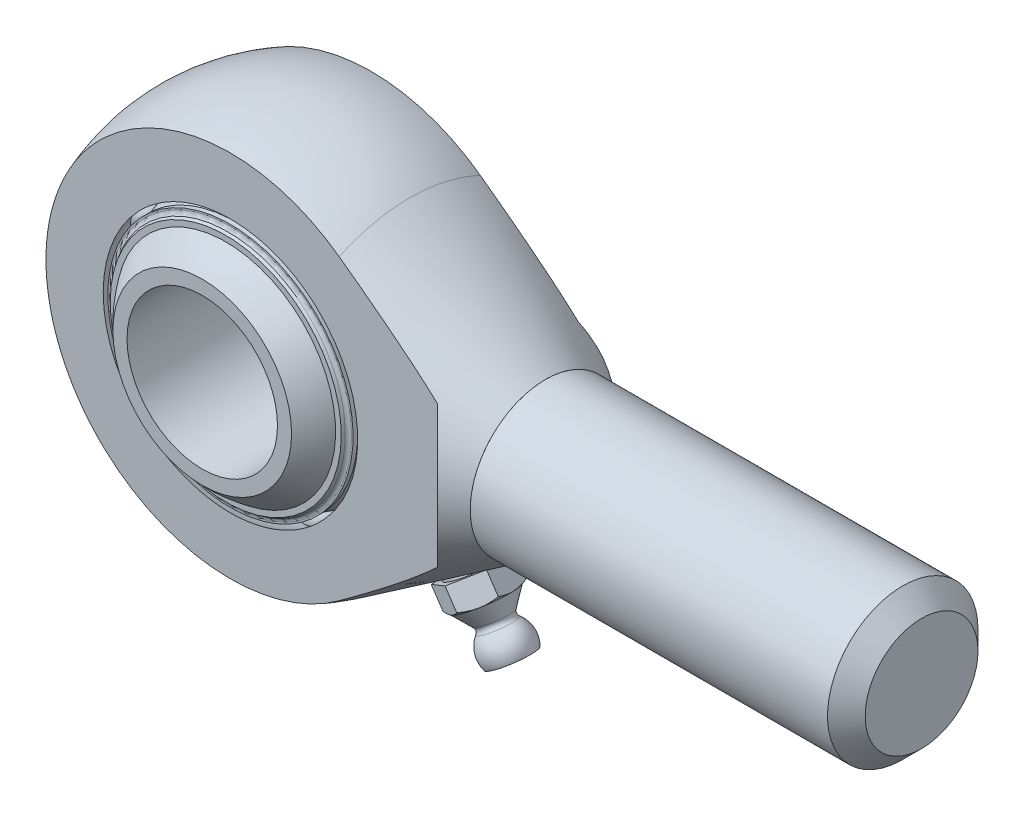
ISO-10303-21;
HEADER;
FILE_DESCRIPTION(('STEP AP214'),'2;1');
FILE_NAME('part.step','',(''),(''),'','','');
FILE_SCHEMA(('AUTOMOTIVE_DESIGN { 1 0 10303 214 1 1 1 1 }'));
ENDSEC;
DATA;
#1=APPLICATION_CONTEXT('core data for automotive mechanical design processes');
#2=APPLICATION_PROTOCOL_DEFINITION('international standard','automotive_design',2000,#1);
#3=PRODUCT_CONTEXT('',#1,'mechanical');
#4=PRODUCT('Part','Part','',(#3));
#5=PRODUCT_RELATED_PRODUCT_CATEGORY('part','',(#4));
#6=PRODUCT_DEFINITION_FORMATION('','',#4);
#7=PRODUCT_DEFINITION_CONTEXT('part definition',#1,'design');
#8=PRODUCT_DEFINITION('design','',#6,#7);
#9=PRODUCT_DEFINITION_SHAPE('','',#8);
#10=(LENGTH_UNIT() NAMED_UNIT(*) SI_UNIT(.MILLI.,.METRE.));
#11=(NAMED_UNIT(*) PLANE_ANGLE_UNIT() SI_UNIT($,.RADIAN.));
#12=(NAMED_UNIT(*) SI_UNIT($,.STERADIAN.) SOLID_ANGLE_UNIT());
#13=UNCERTAINTY_MEASURE_WITH_UNIT(LENGTH_MEASURE(1.E-05),#10,'distance_accuracy_value','');
#14=(GEOMETRIC_REPRESENTATION_CONTEXT(3) GLOBAL_UNCERTAINTY_ASSIGNED_CONTEXT((#13)) GLOBAL_UNIT_ASSIGNED_CONTEXT((#10,
#11,#12)) REPRESENTATION_CONTEXT('',''));
#15=CARTESIAN_POINT('',(0.,0.,0.));
#16=DIRECTION('',(0.,0.,1.));
#17=DIRECTION('',(1.,0.,0.));
#18=AXIS2_PLACEMENT_3D('',#15,#16,#17);
#19=CARTESIAN_POINT('',(-4.60079476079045,-14.1597902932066,2.09244005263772));
#20=DIRECTION('',(0.306009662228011,0.941800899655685,-0.139173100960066));
#21=DIRECTION('',(0.0430068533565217,0.132361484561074,0.99026806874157));
#22=AXIS2_PLACEMENT_3D('',#19,#20,#21);
#23=SPHERICAL_SURFACE('',#22,1.75);
#24=CARTESIAN_POINT('',(-4.06527785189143,-12.5116387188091,1.84888712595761));
#25=VERTEX_POINT('',#24);
#26=VERTEX_LOOP('',#25);
#27=FACE_BOUND('',#26,.T.);
#28=ADVANCED_FACE('P0_F12',(#27),#23,.T.);
#29=CLOSED_SHELL('',(#28));
#30=MANIFOLD_SOLID_BREP('P0_B1',#29);
#31=CARTESIAN_POINT('',(0.,14.8884845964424,2.09244005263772));
#32=DIRECTION('',(0.,-0.99026806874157,-0.139173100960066));
#33=DIRECTION('',(0.,-0.139173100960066,0.99026806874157));
#34=AXIS2_PLACEMENT_3D('',#31,#32,#33);
#35=SPHERICAL_SURFACE('',#34,1.75);
#36=CARTESIAN_POINT('',(0.,13.1555154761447,1.84888712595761));
#37=VERTEX_POINT('',#36);
#38=VERTEX_LOOP('',#37);
#39=FACE_BOUND('',#38,.T.);
#40=ADVANCED_FACE('P1_F12',(#39),#35,.T.);
#41=CLOSED_SHELL('',(#40));
#42=MANIFOLD_SOLID_BREP('P1_B1',#41);
#43=CARTESIAN_POINT('',(4.60079476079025,-14.1597902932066,-2.09244005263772));
#44=DIRECTION('',(-0.306009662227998,0.94180089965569,0.139173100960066));
#45=DIRECTION('',(-0.0430068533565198,0.132361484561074,-0.99026806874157));
#46=AXIS2_PLACEMENT_3D('',#43,#44,#45);
#47=SPHERICAL_SURFACE('',#46,1.75);
#48=CARTESIAN_POINT('',(4.06527785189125,-12.5116387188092,-1.84888712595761));
#49=VERTEX_POINT('',#48);
#50=VERTEX_LOOP('',#49);
#51=FACE_BOUND('',#50,.T.);
#52=ADVANCED_FACE('P2_F12',(#51),#47,.T.);
#53=CLOSED_SHELL('',(#52));
#54=MANIFOLD_SOLID_BREP('P2_B1',#53);
#55=CARTESIAN_POINT('',(0.,0.,0.));
#56=DIRECTION('',(0.,0.,1.));
#57=DIRECTION('',(0.999027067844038,0.044101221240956,0.));
#58=AXIS2_PLACEMENT_3D('',#55,#56,#57);
#59=CYLINDRICAL_SURFACE('',#58,13.04);
#60=CARTESIAN_POINT('',(0.,0.,-7.5));
#61=DIRECTION('',(0.,0.,1.));
#62=DIRECTION('',(0.999027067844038,0.044101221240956,0.));
#63=AXIS2_PLACEMENT_3D('',#60,#61,#62);
#64=CIRCLE('',#63,13.04);
#65=CARTESIAN_POINT('',(13.0273129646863,0.575079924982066,-7.5));
#66=VERTEX_POINT('',#65);
#67=EDGE_CURVE('P3_E34',#66,#66,#64,.T.);
#68=ORIENTED_EDGE('',*,*,#67,.T.);
#69=EDGE_LOOP('',(#68));
#70=FACE_BOUND('',#69,.T.);
#71=CARTESIAN_POINT('',(0.,0.,-7.));
#72=DIRECTION('',(0.,0.,1.));
#73=DIRECTION('',(0.999027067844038,0.044101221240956,0.));
#74=AXIS2_PLACEMENT_3D('',#71,#72,#73);
#75=CIRCLE('',#74,13.04);
#76=CARTESIAN_POINT('',(13.0273129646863,0.575079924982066,-7.));
#77=VERTEX_POINT('',#76);
#78=EDGE_CURVE('P3_E43',#77,#77,#75,.T.);
#79=ORIENTED_EDGE('',*,*,#78,.F.);
#80=EDGE_LOOP('',(#79));
#81=FACE_BOUND('',#80,.T.);
#82=ADVANCED_FACE('P3_F14',(#70,#81),#59,.T.);
#83=CARTESIAN_POINT('',(-0.575079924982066,13.0273129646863,-7.5));
#84=DIRECTION('',(0.,0.,-1.));
#85=DIRECTION('',(-0.999027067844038,-0.044101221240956,0.));
#86=AXIS2_PLACEMENT_3D('',#83,#84,#85);
#87=PLANE('',#86);
#88=CARTESIAN_POINT('',(0.,0.,-7.5));
#89=DIRECTION('',(0.,0.,-1.));
#90=DIRECTION('',(-0.999027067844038,-0.044101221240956,0.));
#91=AXIS2_PLACEMENT_3D('',#88,#89,#90);
#92=CIRCLE('',#91,12.8770961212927);
#93=CARTESIAN_POINT('',(-12.8645675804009,-0.567895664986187,-7.5));
#94=VERTEX_POINT('',#93);
#95=EDGE_CURVE('P3_E21',#94,#94,#92,.F.);
#96=ORIENTED_EDGE('',*,*,#95,.T.);
#97=EDGE_LOOP('',(#96));
#98=FACE_BOUND('',#97,.T.);
#99=ORIENTED_EDGE('',*,*,#67,.F.);
#100=EDGE_LOOP('',(#99));
#101=FACE_BOUND('',#100,.T.);
#102=ADVANCED_FACE('P3_F50',(#98,#101),#87,.T.);
#103=CARTESIAN_POINT('',(0.,0.,0.));
#104=DIRECTION('',(0.,0.,1.));
#105=DIRECTION('',(-0.044101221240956,0.999027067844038,0.));
#106=AXIS2_PLACEMENT_3D('',#103,#104,#105);
#107=SPHERICAL_SURFACE('',#106,14.6598022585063);
#108=CARTESIAN_POINT('',(0.,0.,-7.73614431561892));
#109=DIRECTION('',(0.,0.,1.));
#110=DIRECTION('',(0.999027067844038,0.044101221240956,0.));
#111=AXIS2_PLACEMENT_3D('',#108,#109,#110);
#112=CIRCLE('',#111,12.4523842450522);
#113=CARTESIAN_POINT('',(-0.54916535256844,12.4402689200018,-7.73614431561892));
#114=VERTEX_POINT('',#113);
#115=EDGE_CURVE('P3_E10',#114,#114,#112,.F.);
#116=CARTESIAN_POINT('',(0.,0.,-8.));
#117=DIRECTION('',(0.,0.,1.));
#118=DIRECTION('',(0.999027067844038,0.044101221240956,0.));
#119=AXIS2_PLACEMENT_3D('',#116,#117,#118);
#120=CIRCLE('',#119,12.2845350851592);
#121=CARTESIAN_POINT('',(-0.54176299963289,12.2725830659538,-8.));
#122=VERTEX_POINT('',#121);
#123=EDGE_CURVE('P3_E37',#122,#122,#120,.T.);
#124=CARTESIAN_POINT('',(-0.54916535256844,12.4402689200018,-7.73614431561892));
#125=CARTESIAN_POINT('',(-0.549089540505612,12.4385515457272,-7.73891135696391));
#126=CARTESIAN_POINT('',(-0.549013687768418,12.4368332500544,-7.74167782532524));
#127=CARTESIAN_POINT('',(-0.548861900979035,12.4333948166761,-7.74720961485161));
#128=CARTESIAN_POINT('',(-0.548785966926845,12.4316746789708,-7.74997493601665));
#129=CARTESIAN_POINT('',(-0.548634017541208,12.4282325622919,-7.75550442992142));
#130=CARTESIAN_POINT('',(-0.54855800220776,12.4265105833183,-7.75826860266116));
#131=CARTESIAN_POINT('',(-0.548405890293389,12.4230647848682,-7.76379579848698));
#132=CARTESIAN_POINT('',(-0.548329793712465,12.4213409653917,-7.76655882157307));
#133=CARTESIAN_POINT('',(-0.54817751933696,12.4178914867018,-7.7720837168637));
#134=CARTESIAN_POINT('',(-0.548101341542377,12.4161658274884,-7.77484558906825));
#135=CARTESIAN_POINT('',(-0.547948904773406,12.4127126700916,-7.78036818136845));
#136=CARTESIAN_POINT('',(-0.547872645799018,12.4109851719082,-7.78312890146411));
#137=CARTESIAN_POINT('',(-0.547720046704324,12.407528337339,-7.78864918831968));
#138=CARTESIAN_POINT('',(-0.547643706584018,12.4057990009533,-7.79140875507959));
#139=CARTESIAN_POINT('',(-0.547490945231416,12.402338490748,-7.79692673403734));
#140=CARTESIAN_POINT('',(-0.547414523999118,12.4006073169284,-7.79968514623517));
#141=CARTESIAN_POINT('',(-0.547261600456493,12.3971431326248,-7.80520081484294));
#142=CARTESIAN_POINT('',(-0.547185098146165,12.3954101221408,-7.80795807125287));
#143=CARTESIAN_POINT('',(-0.547032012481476,12.3919422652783,-7.81347142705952));
#144=CARTESIAN_POINT('',(-0.546955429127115,12.3902074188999,-7.81622752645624));
#145=CARTESIAN_POINT('',(-0.546802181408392,12.3867358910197,-7.82173856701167));
#146=CARTESIAN_POINT('',(-0.54672551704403,12.3849992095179,-7.82449350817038));
#147=CARTESIAN_POINT('',(-0.546572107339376,12.3815240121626,-7.83000223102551));
#148=CARTESIAN_POINT('',(-0.546495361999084,12.3797854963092,-7.83275601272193));
#149=CARTESIAN_POINT('',(-0.546341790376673,12.3763066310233,-7.83826241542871));
#150=CARTESIAN_POINT('',(-0.546264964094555,12.3745662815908,-7.84101503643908));
#151=CARTESIAN_POINT('',(-0.546111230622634,12.3710837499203,-7.84651911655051));
#152=CARTESIAN_POINT('',(-0.546034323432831,12.3693415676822,-7.84927057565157));
#153=CARTESIAN_POINT('',(-0.545880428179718,12.3658553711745,-7.85477233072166));
#154=CARTESIAN_POINT('',(-0.545803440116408,12.364111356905,-7.85752262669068));
#155=CARTESIAN_POINT('',(-0.545649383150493,12.3606214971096,-7.86302205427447));
#156=CARTESIAN_POINT('',(-0.545572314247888,12.3588756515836,-7.86577118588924));
#157=CARTESIAN_POINT('',(-0.545418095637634,12.3553821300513,-7.87126828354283));
#158=CARTESIAN_POINT('',(-0.545340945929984,12.3536344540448,-7.87401624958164));
#159=CARTESIAN_POINT('',(-0.545186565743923,12.350137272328,-7.87951101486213));
#160=CARTESIAN_POINT('',(-0.545109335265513,12.3483877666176,-7.88225781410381));
#161=CARTESIAN_POINT('',(-0.544954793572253,12.3448869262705,-7.88775024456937));
#162=CARTESIAN_POINT('',(-0.544877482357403,12.3431355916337,-7.89049587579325));
#163=CARTESIAN_POINT('',(-0.54472277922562,12.3396310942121,-7.89598596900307));
#164=CARTESIAN_POINT('',(-0.544645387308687,12.3378779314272,-7.89873043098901));
#165=CARTESIAN_POINT('',(-0.544490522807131,12.3343697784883,-7.90421818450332));
#166=CARTESIAN_POINT('',(-0.544413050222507,12.3326147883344,-7.9069614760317));
#167=CARTESIAN_POINT('',(-0.544258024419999,12.3291029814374,-7.91244688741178));
#168=CARTESIAN_POINT('',(-0.544180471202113,12.3273461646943,-7.91518900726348));
#169=CARTESIAN_POINT('',(-0.544025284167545,12.3238307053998,-7.92067207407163));
#170=CARTESIAN_POINT('',(-0.543947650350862,12.3220720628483,-7.92341302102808));
#171=CARTESIAN_POINT('',(-0.543792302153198,12.3185529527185,-7.92889374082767));
#172=CARTESIAN_POINT('',(-0.543714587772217,12.3167924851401,-7.93163351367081));
#173=CARTESIAN_POINT('',(-0.543559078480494,12.3132697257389,-7.93711188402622));
#174=CARTESIAN_POINT('',(-0.543481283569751,12.311507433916,-7.9398504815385));
#175=CARTESIAN_POINT('',(-0.543325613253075,12.3079810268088,-7.94532650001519));
#176=CARTESIAN_POINT('',(-0.543247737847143,12.3062169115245,-7.9480639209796));
#177=CARTESIAN_POINT('',(-0.543091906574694,12.3026868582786,-7.95353758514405));
#178=CARTESIAN_POINT('',(-0.543013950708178,12.3009209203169,-7.95627382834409));
#179=CARTESIAN_POINT('',(-0.542857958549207,12.2973872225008,-7.96174513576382));
#180=CARTESIAN_POINT('',(-0.542779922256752,12.2956194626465,-7.96448019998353));
#181=CARTESIAN_POINT('',(-0.54262376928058,12.2920821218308,-7.96994914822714));
#182=CARTESIAN_POINT('',(-0.542545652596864,12.2903125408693,-7.97268303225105));
#183=CARTESIAN_POINT('',(-0.542389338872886,12.2867715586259,-7.97814961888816));
#184=CARTESIAN_POINT('',(-0.542311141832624,12.2850001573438,-7.98088232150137));
#185=CARTESIAN_POINT('',(-0.542154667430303,12.2814555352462,-7.98634654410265));
#186=CARTESIAN_POINT('',(-0.542076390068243,12.2796823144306,-7.98907806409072));
#187=CARTESIAN_POINT('',(-0.541919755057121,12.2761340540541,-7.99453992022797));
#188=CARTESIAN_POINT('',(-0.541841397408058,12.2743590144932,-7.99727025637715));
#189=CARTESIAN_POINT('',(-0.54176299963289,12.2725830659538,-8.));
#190=B_SPLINE_CURVE_WITH_KNOTS('',3,(#124,#125,#126,#127,#128,#129,#130,#131,#132,#133,#134,
#135,#136,#137,#138,#139,#140,#141,#142,#143,#144,#145,#146,#147,#148,#149,#150,#151,#152,#153,
#154,#155,#156,#157,#158,#159,#160,#161,#162,#163,#164,#165,#166,#167,#168,#169,#170,#171,#172,
#173,#174,#175,#176,#177,#178,#179,#180,#181,#182,#183,#184,#185,#186,#187,#188,#189),
.UNSPECIFIED.,.F.,.F.,(4,2,2,2,2,2,2,2,2,2,2,2,2,2,2,2,2,2,2,2,2,2,2,2,2,2,2,2,2,2,2,2,4),(0.,
0.00977265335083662,0.0195453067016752,0.0293179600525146,0.0390906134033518,0.04886326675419,
0.0586359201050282,0.0684085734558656,0.0781812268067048,0.0879538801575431,0.09772653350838,
0.107499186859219,0.117271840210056,0.127044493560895,0.136817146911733,0.146589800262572,
0.15636245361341,0.166135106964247,0.175907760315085,0.185680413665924,0.195453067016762,
0.205225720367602,0.214998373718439,0.224771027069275,0.234543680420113,0.244316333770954,
0.254088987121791,0.263861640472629,0.273634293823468,0.283406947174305,0.293179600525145,
0.302952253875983,0.312724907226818),.UNSPECIFIED.);
#191=EDGE_CURVE('P3_BSEAM57',#114,#122,#190,.T.);
#192=ORIENTED_EDGE('',*,*,#115,.T.);
#193=ORIENTED_EDGE('',*,*,#123,.T.);
#194=ORIENTED_EDGE('',*,*,#191,.T.);
#195=ORIENTED_EDGE('',*,*,#191,.F.);
#196=EDGE_LOOP('',(#192,#194,#193,#195));
#197=FACE_BOUND('',#196,.T.);
#198=ADVANCED_FACE('P3_F57',(#197),#107,.T.);
#199=CARTESIAN_POINT('',(-0.515248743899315,11.6719543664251,-8.));
#200=DIRECTION('',(0.,0.,-1.));
#201=DIRECTION('',(-0.999027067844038,-0.044101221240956,0.));
#202=AXIS2_PLACEMENT_3D('',#199,#200,#201);
#203=PLANE('',#202);
#204=CARTESIAN_POINT('',(0.,0.,-8.));
#205=DIRECTION('',(0.,0.,1.));
#206=DIRECTION('',(0.999027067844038,0.044101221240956,0.));
#207=AXIS2_PLACEMENT_3D('',#204,#205,#206);
#208=CIRCLE('',#207,11.6833214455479);
#209=CARTESIAN_POINT('',(-0.515248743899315,11.6719543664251,-8.));
#210=VERTEX_POINT('',#209);
#211=EDGE_CURVE('P3_E40',#210,#210,#208,.T.);
#212=ORIENTED_EDGE('',*,*,#211,.T.);
#213=EDGE_LOOP('',(#212));
#214=FACE_BOUND('',#213,.T.);
#215=ORIENTED_EDGE('',*,*,#123,.F.);
#216=EDGE_LOOP('',(#215));
#217=FACE_BOUND('',#216,.T.);
#218=ADVANCED_FACE('P3_F77',(#214,#217),#203,.T.);
#219=CARTESIAN_POINT('',(0.,0.,0.));
#220=DIRECTION('',(0.,0.,1.));
#221=DIRECTION('',(-0.044101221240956,0.999027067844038,0.));
#222=AXIS2_PLACEMENT_3D('',#219,#220,#221);
#223=SPHERICAL_SURFACE('',#222,14.1598022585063);
#224=CARTESIAN_POINT('',(0.,0.,-7.24419845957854));
#225=DIRECTION('',(0.,0.,1.));
#226=DIRECTION('',(0.999027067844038,0.044101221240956,0.));
#227=AXIS2_PLACEMENT_3D('',#224,#225,#226);
#228=CIRCLE('',#227,12.1664123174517);
#229=CARTESIAN_POINT('',(-0.536553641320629,12.1545752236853,-7.24419845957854));
#230=VERTEX_POINT('',#229);
#231=EDGE_CURVE('P3_E29',#230,#230,#228,.T.);
#232=CARTESIAN_POINT('',(-0.536553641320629,12.1545752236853,-7.24419845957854));
#233=CARTESIAN_POINT('',(-0.536342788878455,12.1497987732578,-7.25222817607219));
#234=CARTESIAN_POINT('',(-0.536131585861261,12.1450143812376,-7.26025315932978));
#235=CARTESIAN_POINT('',(-0.535708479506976,12.1354297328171,-7.27629362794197));
#236=CARTESIAN_POINT('',(-0.535496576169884,12.1306294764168,-7.28430911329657));
#237=CARTESIAN_POINT('',(-0.535072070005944,12.1210131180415,-7.30033055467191));
#238=CARTESIAN_POINT('',(-0.534859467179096,12.1161970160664,-7.30833651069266));
#239=CARTESIAN_POINT('',(-0.534433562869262,12.1065489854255,-7.32433886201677));
#240=CARTESIAN_POINT('',(-0.534220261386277,12.1017170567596,-7.33233525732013));
#241=CARTESIAN_POINT('',(-0.533792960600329,12.0920373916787,-7.34831845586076));
#242=CARTESIAN_POINT('',(-0.533578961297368,12.0871896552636,-7.35630525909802));
#243=CARTESIAN_POINT('',(-0.533150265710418,12.0774783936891,-7.37226924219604));
#244=CARTESIAN_POINT('',(-0.53293556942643,12.0726148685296,-7.38024642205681));
#245=CARTESIAN_POINT('',(-0.532505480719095,12.0628720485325,-7.39619112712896));
#246=CARTESIAN_POINT('',(-0.532290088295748,12.057992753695,-7.40415865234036));
#247=CARTESIAN_POINT('',(-0.531858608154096,12.0482184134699,-7.42008401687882));
#248=CARTESIAN_POINT('',(-0.531642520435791,12.0433233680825,-7.42804185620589));
#249=CARTESIAN_POINT('',(-0.531209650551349,12.0335175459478,-7.44394781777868));
#250=CARTESIAN_POINT('',(-0.530992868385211,12.0286067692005,-7.4518959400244));
#251=CARTESIAN_POINT('',(-0.530558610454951,12.0187695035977,-7.46778243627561));
#252=CARTESIAN_POINT('',(-0.530341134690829,12.0138430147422,-7.47572081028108));
#253=CARTESIAN_POINT('',(-0.529905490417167,12.0039743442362,-7.49158777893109));
#254=CARTESIAN_POINT('',(-0.529687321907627,11.9990321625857,-7.49951637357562));
#255=CARTESIAN_POINT('',(-0.529250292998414,11.9891321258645,-7.51536375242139));
#256=CARTESIAN_POINT('',(-0.52903143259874,11.9841742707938,-7.52328253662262));
#257=CARTESIAN_POINT('',(-0.528593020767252,11.9742429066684,-7.53911026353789));
#258=CARTESIAN_POINT('',(-0.528373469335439,11.9692693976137,-7.54701920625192));
#259=CARTESIAN_POINT('',(-0.527933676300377,11.9593067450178,-7.56282721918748));
#260=CARTESIAN_POINT('',(-0.527713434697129,11.9543176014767,-7.570726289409));
#261=CARTESIAN_POINT('',(-0.527272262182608,11.9443236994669,-7.58651452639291));
#262=CARTESIAN_POINT('',(-0.527051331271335,11.9393189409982,-7.5944036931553));
#263=CARTESIAN_POINT('',(-0.526608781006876,11.9292938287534,-7.61017209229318));
#264=CARTESIAN_POINT('',(-0.526387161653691,11.9242734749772,-7.61805132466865));
#265=CARTESIAN_POINT('',(-0.525943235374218,11.9142171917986,-7.63379982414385));
#266=CARTESIAN_POINT('',(-0.525720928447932,11.9091812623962,-7.64166909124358));
#267=CARTESIAN_POINT('',(-0.525275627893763,11.8990938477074,-7.65739762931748));
#268=CARTESIAN_POINT('',(-0.525052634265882,11.894042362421,-7.66525690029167));
#269=CARTESIAN_POINT('',(-0.524605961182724,11.8839238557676,-7.68096541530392));
#270=CARTESIAN_POINT('',(-0.524382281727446,11.8788568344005,-7.68881465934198));
#271=CARTESIAN_POINT('',(-0.523934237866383,11.8687072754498,-7.70450308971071));
#272=CARTESIAN_POINT('',(-0.523709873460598,11.8636247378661,-7.71234227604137));
#273=CARTESIAN_POINT('',(-0.52326046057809,11.8534441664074,-7.72801056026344));
#274=CARTESIAN_POINT('',(-0.523035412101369,11.8483461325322,-7.73583965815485));
#275=CARTESIAN_POINT('',(-0.522584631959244,11.8381345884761,-7.75148773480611));
#276=CARTESIAN_POINT('',(-0.522358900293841,11.8330210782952,-7.75930671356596));
#277=CARTESIAN_POINT('',(-0.521906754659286,11.822778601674,-7.77493452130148));
#278=CARTESIAN_POINT('',(-0.521680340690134,11.8176496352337,-7.78274335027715));
#279=CARTESIAN_POINT('',(-0.521226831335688,11.8073762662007,-7.79835082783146));
#280=CARTESIAN_POINT('',(-0.520999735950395,11.8022318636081,-7.8061494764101));
#281=CARTESIAN_POINT('',(-0.520544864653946,11.791927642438,-7.82173656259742));
#282=CARTESIAN_POINT('',(-0.52031708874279,11.7867678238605,-7.8295250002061));
#283=CARTESIAN_POINT('',(-0.519860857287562,11.7764327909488,-7.84509163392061));
#284=CARTESIAN_POINT('',(-0.51963240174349,11.7712575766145,-7.85286983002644));
#285=CARTESIAN_POINT('',(-0.519174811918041,11.7608917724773,-7.86841595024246));
#286=CARTESIAN_POINT('',(-0.518945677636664,11.7557011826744,-7.87618387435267));
#287=CARTESIAN_POINT('',(-0.518486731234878,11.7453046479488,-7.89170942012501));
#288=CARTESIAN_POINT('',(-0.51825691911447,11.7400987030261,-7.89946704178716));
#289=CARTESIAN_POINT('',(-0.517796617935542,11.7296714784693,-7.91497195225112));
#290=CARTESIAN_POINT('',(-0.517566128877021,11.7244501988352,-7.92271924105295));
#291=CARTESIAN_POINT('',(-0.517104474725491,11.7139923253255,-7.93820345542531));
#292=CARTESIAN_POINT('',(-0.516873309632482,11.7087557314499,-7.94594038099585));
#293=CARTESIAN_POINT('',(-0.516410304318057,11.6982672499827,-7.96140383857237));
#294=CARTESIAN_POINT('',(-0.516178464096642,11.6930153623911,-7.96913037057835));
#295=CARTESIAN_POINT('',(-0.515714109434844,11.6824963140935,-7.98457301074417));
#296=CARTESIAN_POINT('',(-0.515481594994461,11.6772291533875,-7.99228911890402));
#297=CARTESIAN_POINT('',(-0.515248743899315,11.6719543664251,-8.));
#298=B_SPLINE_CURVE_WITH_KNOTS('',3,(#232,#233,#234,#235,#236,#237,#238,#239,#240,#241,#242,
#243,#244,#245,#246,#247,#248,#249,#250,#251,#252,#253,#254,#255,#256,#257,#258,#259,#260,#261,
#262,#263,#264,#265,#266,#267,#268,#269,#270,#271,#272,#273,#274,#275,#276,#277,#278,#279,#280,
#281,#282,#283,#284,#285,#286,#287,#288,#289,#290,#291,#292,#293,#294,#295,#296,#297),
.UNSPECIFIED.,.F.,.F.,(4,2,2,2,2,2,2,2,2,2,2,2,2,2,2,2,2,2,2,2,2,2,2,2,2,2,2,2,2,2,2,2,4),(0.,
0.0280360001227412,0.0560720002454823,0.0841080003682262,0.112144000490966,0.140180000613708,
0.168216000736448,0.196252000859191,0.224288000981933,0.252324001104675,0.280360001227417,
0.308396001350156,0.3364320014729,0.36446800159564,0.392504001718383,0.420540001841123,
0.448576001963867,0.476612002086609,0.504648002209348,0.532684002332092,0.560720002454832,
0.588756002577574,0.616792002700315,0.644828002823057,0.672864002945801,0.700900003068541,
0.728936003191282,0.756972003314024,0.785008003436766,0.813044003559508,0.841080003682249,
0.869116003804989,0.897152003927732),.UNSPECIFIED.);
#299=EDGE_CURVE('P3_BSEAM68',#230,#210,#298,.T.);
#300=ORIENTED_EDGE('',*,*,#231,.T.);
#301=ORIENTED_EDGE('',*,*,#211,.F.);
#302=ORIENTED_EDGE('',*,*,#299,.T.);
#303=ORIENTED_EDGE('',*,*,#299,.F.);
#304=EDGE_LOOP('',(#300,#302,#301,#303));
#305=FACE_BOUND('',#304,.T.);
#306=ADVANCED_FACE('P3_F68',(#305),#223,.F.);
#307=CARTESIAN_POINT('',(-0.575079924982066,13.0273129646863,-7.));
#308=DIRECTION('',(0.,0.,1.));
#309=DIRECTION('',(0.999027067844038,0.044101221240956,0.));
#310=AXIS2_PLACEMENT_3D('',#307,#308,#309);
#311=PLANE('',#310);
#312=CARTESIAN_POINT('',(0.,0.,-7.));
#313=DIRECTION('',(0.,0.,1.));
#314=DIRECTION('',(0.999027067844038,0.044101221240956,0.));
#315=AXIS2_PLACEMENT_3D('',#312,#313,#314);
#316=CIRCLE('',#315,12.5960232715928);
#317=CARTESIAN_POINT('',(12.5837681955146,0.555500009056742,-7.));
#318=VERTEX_POINT('',#317);
#319=EDGE_CURVE('P3_E25',#318,#318,#316,.F.);
#320=ORIENTED_EDGE('',*,*,#319,.T.);
#321=EDGE_LOOP('',(#320));
#322=FACE_BOUND('',#321,.T.);
#323=ORIENTED_EDGE('',*,*,#78,.T.);
#324=EDGE_LOOP('',(#323));
#325=FACE_BOUND('',#324,.T.);
#326=ADVANCED_FACE('P3_F47',(#322,#325),#311,.T.);
#327=CARTESIAN_POINT('',(0.,0.,-7.5));
#328=DIRECTION('',(0.,0.,1.));
#329=DIRECTION('',(0.999027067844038,0.044101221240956,0.));
#330=AXIS2_PLACEMENT_3D('',#327,#328,#329);
#331=TOROIDAL_SURFACE('',#330,12.5960232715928,0.5);
#332=ORIENTED_EDGE('',*,*,#319,.F.);
#333=EDGE_LOOP('',(#332));
#334=FACE_BOUND('',#333,.T.);
#335=ORIENTED_EDGE('',*,*,#231,.F.);
#336=EDGE_LOOP('',(#335));
#337=FACE_BOUND('',#336,.T.);
#338=ADVANCED_FACE('P3_F60',(#334,#337),#331,.T.);
#339=CARTESIAN_POINT('',(0.,0.,-8.));
#340=DIRECTION('',(0.,0.,-1.));
#341=DIRECTION('',(-0.999027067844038,-0.044101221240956,0.));
#342=AXIS2_PLACEMENT_3D('',#339,#340,#341);
#343=TOROIDAL_SURFACE('',#342,12.8770961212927,0.5);
#344=ORIENTED_EDGE('',*,*,#115,.F.);
#345=EDGE_LOOP('',(#344));
#346=FACE_BOUND('',#345,.T.);
#347=ORIENTED_EDGE('',*,*,#95,.F.);
#348=EDGE_LOOP('',(#347));
#349=FACE_BOUND('',#348,.T.);
#350=ADVANCED_FACE('P3_F16',(#346,#349),#343,.F.);
#351=CLOSED_SHELL('',(#82,#102,#198,#218,#306,#326,#338,#350));
#352=MANIFOLD_SOLID_BREP('P3_B1',#351);
#353=CARTESIAN_POINT('',(-8.75123167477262,-12.0450370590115,2.09244005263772));
#354=DIRECTION('',(0.582064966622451,0.801143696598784,-0.139173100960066));
#355=DIRECTION('',(0.0818038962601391,0.112593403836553,0.99026806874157));
#356=AXIS2_PLACEMENT_3D('',#353,#354,#355);
#357=SPHERICAL_SURFACE('',#356,1.75);
#358=CARTESIAN_POINT('',(-7.73261798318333,-10.6430355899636,1.84888712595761));
#359=VERTEX_POINT('',#358);
#360=VERTEX_LOOP('',#359);
#361=FACE_BOUND('',#360,.T.);
#362=ADVANCED_FACE('P4_F12',(#361),#357,.T.);
#363=CLOSED_SHELL('',(#362));
#364=MANIFOLD_SOLID_BREP('P4_B1',#363);
#365=CARTESIAN_POINT('',(4.60079476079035,14.1597902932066,2.09244005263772));
#366=DIRECTION('',(-0.306009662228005,-0.941800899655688,-0.139173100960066));
#367=DIRECTION('',(-0.0430068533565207,-0.132361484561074,0.99026806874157));
#368=AXIS2_PLACEMENT_3D('',#365,#366,#367);
#369=SPHERICAL_SURFACE('',#368,1.75);
#370=CARTESIAN_POINT('',(4.06527785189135,12.5116387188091,1.84888712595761));
#371=VERTEX_POINT('',#370);
#372=VERTEX_LOOP('',#371);
#373=FACE_BOUND('',#372,.T.);
#374=ADVANCED_FACE('P5_F12',(#373),#369,.T.);
#375=CLOSED_SHELL('',(#374));
#376=MANIFOLD_SOLID_BREP('P5_B1',#375);
#377=CARTESIAN_POINT('',(-1.03965792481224E-13,-14.8884845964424,-2.09244005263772));
#378=DIRECTION('',(0.,0.99026806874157,0.139173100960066));
#379=DIRECTION('',(0.,0.139173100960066,-0.99026806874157));
#380=AXIS2_PLACEMENT_3D('',#377,#378,#379);
#381=SPHERICAL_SURFACE('',#380,1.75);
#382=CARTESIAN_POINT('',(0.,-13.1555154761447,-1.84888712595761));
#383=VERTEX_POINT('',#382);
#384=VERTEX_LOOP('',#383);
#385=FACE_BOUND('',#384,.T.);
#386=ADVANCED_FACE('P6_F12',(#385),#381,.T.);
#387=CLOSED_SHELL('',(#386));
#388=MANIFOLD_SOLID_BREP('P6_B1',#387);
#389=CARTESIAN_POINT('',(-12.0450370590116,-8.7512316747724,2.09244005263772));
#390=DIRECTION('',(0.801143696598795,0.582064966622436,-0.139173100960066));
#391=DIRECTION('',(0.112593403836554,0.081803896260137,0.99026806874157));
#392=AXIS2_PLACEMENT_3D('',#389,#390,#391);
#393=SPHERICAL_SURFACE('',#392,1.75);
#394=CARTESIAN_POINT('',(-10.6430355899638,-7.73261798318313,1.84888712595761));
#395=VERTEX_POINT('',#394);
#396=VERTEX_LOOP('',#395);
#397=FACE_BOUND('',#396,.T.);
#398=ADVANCED_FACE('P7_F12',(#397),#393,.T.);
#399=CLOSED_SHELL('',(#398));
#400=MANIFOLD_SOLID_BREP('P7_B1',#399);
#401=CARTESIAN_POINT('',(8.75123167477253,12.0450370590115,2.09244005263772));
#402=DIRECTION('',(-0.582064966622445,-0.801143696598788,-0.139173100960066));
#403=DIRECTION('',(-0.0818038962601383,-0.112593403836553,0.99026806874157));
#404=AXIS2_PLACEMENT_3D('',#401,#402,#403);
#405=SPHERICAL_SURFACE('',#404,1.75);
#406=CARTESIAN_POINT('',(7.73261798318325,10.6430355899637,1.84888712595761));
#407=VERTEX_POINT('',#406);
#408=VERTEX_LOOP('',#407);
#409=FACE_BOUND('',#408,.T.);
#410=ADVANCED_FACE('P8_F12',(#409),#405,.T.);
#411=CLOSED_SHELL('',(#410));
#412=MANIFOLD_SOLID_BREP('P8_B1',#411);
#413=CARTESIAN_POINT('',(-4.60079476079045,-14.1597902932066,-2.09244005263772));
#414=DIRECTION('',(0.306009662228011,0.941800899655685,0.139173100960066));
#415=DIRECTION('',(0.0430068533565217,0.132361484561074,-0.99026806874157));
#416=AXIS2_PLACEMENT_3D('',#413,#414,#415);
#417=SPHERICAL_SURFACE('',#416,1.75);
#418=CARTESIAN_POINT('',(-4.06527785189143,-12.5116387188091,-1.84888712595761));
#419=VERTEX_POINT('',#418);
#420=VERTEX_LOOP('',#419);
#421=FACE_BOUND('',#420,.T.);
#422=ADVANCED_FACE('P9_F12',(#421),#417,.T.);
#423=CLOSED_SHELL('',(#422));
#424=MANIFOLD_SOLID_BREP('P9_B1',#423);
#425=CARTESIAN_POINT('',(0.,0.,0.));
#426=DIRECTION('',(0.,1.,0.));
#427=DIRECTION('',(1.,0.,0.));
#428=AXIS2_PLACEMENT_3D('',#425,#426,#427);
#429=SPHERICAL_SURFACE('',#428,14.1598022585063);
#430=CARTESIAN_POINT('',(0.,0.,0.));
#431=DIRECTION('',(0.,0.,1.));
#432=DIRECTION('',(1.,0.,0.));
#433=AXIS2_PLACEMENT_3D('',#430,#431,#432);
#434=SPHERICAL_SURFACE('',#433,14.1598022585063);
#435=CARTESIAN_POINT('',(0.,0.,3.41453606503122));
#436=DIRECTION('',(0.,0.,1.));
#437=DIRECTION('',(1.,0.,0.));
#438=AXIS2_PLACEMENT_3D('',#435,#436,#437);
#439=CIRCLE('',#438,13.7419410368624);
#440=CARTESIAN_POINT('',(13.7419410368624,0.,3.41453606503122));
#441=VERTEX_POINT('',#440);
#442=EDGE_CURVE('P10_E18',#441,#441,#439,.F.);
#443=ORIENTED_EDGE('',*,*,#442,.F.);
#444=EDGE_LOOP('',(#443));
#445=FACE_BOUND('',#444,.T.);
#446=CARTESIAN_POINT('',(0.,0.,10.5));
#447=DIRECTION('',(0.,0.,-1.));
#448=DIRECTION('',(-1.,0.,0.));
#449=AXIS2_PLACEMENT_3D('',#446,#447,#448);
#450=CIRCLE('',#449,9.5);
#451=CARTESIAN_POINT('',(-9.5,0.,10.5));
#452=VERTEX_POINT('',#451);
#453=EDGE_CURVE('P10_E27',#452,#452,#450,.F.);
#454=ORIENTED_EDGE('',*,*,#453,.F.);
#455=EDGE_LOOP('',(#454));
#456=FACE_BOUND('',#455,.T.);
#457=ADVANCED_FACE('P10_F14',(#445,#456),#434,.T.);
#458=CARTESIAN_POINT('',(0.,0.,0.));
#459=DIRECTION('',(0.,0.,-1.));
#460=DIRECTION('',(-1.,0.,0.));
#461=AXIS2_PLACEMENT_3D('',#458,#459,#460);
#462=SPHERICAL_SURFACE('',#461,14.1598022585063);
#463=CARTESIAN_POINT('',(0.,0.,-3.41453606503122));
#464=DIRECTION('',(0.,0.,-1.));
#465=DIRECTION('',(-1.,0.,0.));
#466=AXIS2_PLACEMENT_3D('',#463,#464,#465);
#467=CIRCLE('',#466,13.7419410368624);
#468=CARTESIAN_POINT('',(-13.7419410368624,0.,-3.41453606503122));
#469=VERTEX_POINT('',#468);
#470=EDGE_CURVE('P10_E34',#469,#469,#467,.F.);
#471=ORIENTED_EDGE('',*,*,#470,.F.);
#472=EDGE_LOOP('',(#471));
#473=FACE_BOUND('',#472,.T.);
#474=CARTESIAN_POINT('',(0.,0.,-10.5));
#475=DIRECTION('',(0.,0.,1.));
#476=DIRECTION('',(1.,0.,0.));
#477=AXIS2_PLACEMENT_3D('',#474,#475,#476);
#478=CIRCLE('',#477,9.5);
#479=CARTESIAN_POINT('',(9.5,0.,-10.5));
#480=VERTEX_POINT('',#479);
#481=EDGE_CURVE('P10_E10',#480,#480,#478,.F.);
#482=ORIENTED_EDGE('',*,*,#481,.F.);
#483=EDGE_LOOP('',(#482));
#484=FACE_BOUND('',#483,.T.);
#485=ADVANCED_FACE('P10_F50',(#473,#484),#462,.T.);
#486=CARTESIAN_POINT('',(0.,0.,0.));
#487=DIRECTION('',(0.,0.,-1.));
#488=DIRECTION('',(-1.,0.,0.));
#489=AXIS2_PLACEMENT_3D('',#486,#487,#488);
#490=SPHERICAL_SURFACE('',#489,14.1598022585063);
#491=CARTESIAN_POINT('',(0.,0.,0.505529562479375));
#492=DIRECTION('',(0.,0.,-1.));
#493=DIRECTION('',(-1.,0.,0.));
#494=AXIS2_PLACEMENT_3D('',#491,#492,#493);
#495=CIRCLE('',#494,14.1507752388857);
#496=CARTESIAN_POINT('',(-14.1507752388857,0.,0.505529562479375));
#497=VERTEX_POINT('',#496);
#498=EDGE_CURVE('P10_E39',#497,#497,#495,.F.);
#499=ORIENTED_EDGE('',*,*,#498,.F.);
#500=EDGE_LOOP('',(#499));
#501=FACE_BOUND('',#500,.T.);
#502=CARTESIAN_POINT('',(0.,0.,-0.505529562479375));
#503=DIRECTION('',(0.,0.,1.));
#504=DIRECTION('',(1.,0.,0.));
#505=AXIS2_PLACEMENT_3D('',#502,#503,#504);
#506=CIRCLE('',#505,14.1507752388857);
#507=CARTESIAN_POINT('',(14.1507752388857,0.,-0.505529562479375));
#508=VERTEX_POINT('',#507);
#509=EDGE_CURVE('P10_E35',#508,#508,#506,.F.);
#510=ORIENTED_EDGE('',*,*,#509,.F.);
#511=EDGE_LOOP('',(#510));
#512=FACE_BOUND('',#511,.T.);
#513=ADVANCED_FACE('P10_F16',(#501,#512),#490,.T.);
#514=CARTESIAN_POINT('',(0.,0.,-14.1598022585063));
#515=DIRECTION('',(0.,0.,1.));
#516=DIRECTION('',(1.,0.,0.));
#517=AXIS2_PLACEMENT_3D('',#514,#515,#516);
#518=CYLINDRICAL_SURFACE('',#517,8.);
#519=CARTESIAN_POINT('',(0.,0.,10.5));
#520=DIRECTION('',(0.,0.,-1.));
#521=DIRECTION('',(-1.,0.,0.));
#522=AXIS2_PLACEMENT_3D('',#519,#520,#521);
#523=CIRCLE('',#522,8.);
#524=CARTESIAN_POINT('',(-8.,0.,10.5));
#525=VERTEX_POINT('',#524);
#526=EDGE_CURVE('P10_E31',#525,#525,#523,.F.);
#527=ORIENTED_EDGE('',*,*,#526,.T.);
#528=EDGE_LOOP('',(#527));
#529=FACE_BOUND('',#528,.T.);
#530=CARTESIAN_POINT('',(0.,0.,-10.5));
#531=DIRECTION('',(0.,0.,1.));
#532=DIRECTION('',(1.,0.,0.));
#533=AXIS2_PLACEMENT_3D('',#530,#531,#532);
#534=CIRCLE('',#533,8.);
#535=CARTESIAN_POINT('',(8.,0.,-10.5));
#536=VERTEX_POINT('',#535);
#537=EDGE_CURVE('P10_E22',#536,#536,#534,.F.);
#538=ORIENTED_EDGE('',*,*,#537,.T.);
#539=EDGE_LOOP('',(#538));
#540=FACE_BOUND('',#539,.T.);
#541=ADVANCED_FACE('P10_F62',(#529,#540),#518,.F.);
#542=CARTESIAN_POINT('',(-14.1598022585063,-14.1598022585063,-10.5));
#543=DIRECTION('',(0.,0.,1.));
#544=DIRECTION('',(1.,0.,0.));
#545=AXIS2_PLACEMENT_3D('',#542,#543,#544);
#546=PLANE('',#545);
#547=ORIENTED_EDGE('',*,*,#481,.T.);
#548=EDGE_LOOP('',(#547));
#549=FACE_BOUND('',#548,.T.);
#550=ORIENTED_EDGE('',*,*,#537,.F.);
#551=EDGE_LOOP('',(#550));
#552=FACE_BOUND('',#551,.T.);
#553=ADVANCED_FACE('P10_F58',(#549,#552),#546,.F.);
#554=CARTESIAN_POINT('',(-14.1598022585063,-14.1598022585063,10.5));
#555=DIRECTION('',(0.,0.,-1.));
#556=DIRECTION('',(-1.,0.,0.));
#557=AXIS2_PLACEMENT_3D('',#554,#555,#556);
#558=PLANE('',#557);
#559=ORIENTED_EDGE('',*,*,#453,.T.);
#560=EDGE_LOOP('',(#559));
#561=FACE_BOUND('',#560,.T.);
#562=ORIENTED_EDGE('',*,*,#526,.F.);
#563=EDGE_LOOP('',(#562));
#564=FACE_BOUND('',#563,.T.);
#565=ADVANCED_FACE('P10_F54',(#561,#564),#558,.F.);
#566=CARTESIAN_POINT('',(0.,0.,-2.09244005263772));
#567=DIRECTION('',(0.,0.,-1.));
#568=DIRECTION('',(-1.,0.,0.));
#569=AXIS2_PLACEMENT_3D('',#566,#567,#568);
#570=TOROIDAL_SURFACE('',#569,14.8884845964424,1.75);
#571=ORIENTED_EDGE('',*,*,#470,.T.);
#572=EDGE_LOOP('',(#571));
#573=FACE_BOUND('',#572,.T.);
#574=ORIENTED_EDGE('',*,*,#509,.T.);
#575=EDGE_LOOP('',(#574));
#576=FACE_BOUND('',#575,.T.);
#577=ADVANCED_FACE('P10_F57',(#573,#576),#570,.F.);
#578=CARTESIAN_POINT('',(0.,0.,2.09244005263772));
#579=DIRECTION('',(0.,0.,-1.));
#580=DIRECTION('',(-1.,0.,0.));
#581=AXIS2_PLACEMENT_3D('',#578,#579,#580);
#582=TOROIDAL_SURFACE('',#581,14.8884845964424,1.75);
#583=ORIENTED_EDGE('',*,*,#442,.T.);
#584=EDGE_LOOP('',(#583));
#585=FACE_BOUND('',#584,.T.);
#586=ORIENTED_EDGE('',*,*,#498,.T.);
#587=EDGE_LOOP('',(#586));
#588=FACE_BOUND('',#587,.T.);
#589=ADVANCED_FACE('P10_F46',(#585,#588),#582,.F.);
#590=CLOSED_SHELL('',(#457,#485,#513,#541,#553,#565,#577,#589));
#591=MANIFOLD_SOLID_BREP('P10_B1',#590);
#592=CARTESIAN_POINT('',(-14.1597902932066,-4.60079476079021,2.09244005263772));
#593=DIRECTION('',(0.94180089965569,0.306009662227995,-0.139173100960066));
#594=DIRECTION('',(0.132361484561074,0.0430068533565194,0.99026806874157));
#595=AXIS2_PLACEMENT_3D('',#592,#593,#594);
#596=SPHERICAL_SURFACE('',#595,1.75);
#597=CARTESIAN_POINT('',(-12.5116387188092,-4.06527785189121,1.84888712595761));
#598=VERTEX_POINT('',#597);
#599=VERTEX_LOOP('',#598);
#600=FACE_BOUND('',#599,.T.);
#601=ADVANCED_FACE('P11_F12',(#600),#596,.T.);
#602=CLOSED_SHELL('',(#601));
#603=MANIFOLD_SOLID_BREP('P11_B1',#602);
#604=CARTESIAN_POINT('',(12.0450370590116,8.75123167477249,2.09244005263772));
#605=DIRECTION('',(-0.80114369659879,-0.582064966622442,-0.139173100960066));
#606=DIRECTION('',(-0.112593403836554,-0.0818038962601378,0.99026806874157));
#607=AXIS2_PLACEMENT_3D('',#604,#605,#606);
#608=SPHERICAL_SURFACE('',#607,1.75);
#609=CARTESIAN_POINT('',(10.6430355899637,7.73261798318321,1.84888712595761));
#610=VERTEX_POINT('',#609);
#611=VERTEX_LOOP('',#610);
#612=FACE_BOUND('',#611,.T.);
#613=ADVANCED_FACE('P12_F12',(#612),#608,.T.);
#614=CLOSED_SHELL('',(#613));
#615=MANIFOLD_SOLID_BREP('P12_B1',#614);
#616=CARTESIAN_POINT('',(-8.75123167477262,-12.0450370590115,-2.09244005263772));
#617=DIRECTION('',(0.582064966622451,0.801143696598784,0.139173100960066));
#618=DIRECTION('',(0.0818038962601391,0.112593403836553,-0.99026806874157));
#619=AXIS2_PLACEMENT_3D('',#616,#617,#618);
#620=SPHERICAL_SURFACE('',#619,1.75);
#621=CARTESIAN_POINT('',(-7.73261798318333,-10.6430355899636,-1.84888712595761));
#622=VERTEX_POINT('',#621);
#623=VERTEX_LOOP('',#622);
#624=FACE_BOUND('',#623,.T.);
#625=ADVANCED_FACE('P13_F12',(#624),#620,.T.);
#626=CLOSED_SHELL('',(#625));
#627=MANIFOLD_SOLID_BREP('P13_B1',#626);
#628=CARTESIAN_POINT('',(0.,14.8884845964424,-2.09244005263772));
#629=DIRECTION('',(0.,-0.99026806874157,0.139173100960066));
#630=DIRECTION('',(0.,-0.139173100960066,-0.99026806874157));
#631=AXIS2_PLACEMENT_3D('',#628,#629,#630);
#632=SPHERICAL_SURFACE('',#631,1.75);
#633=CARTESIAN_POINT('',(0.,13.1555154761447,-1.84888712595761));
#634=VERTEX_POINT('',#633);
#635=VERTEX_LOOP('',#634);
#636=FACE_BOUND('',#635,.T.);
#637=ADVANCED_FACE('P14_F12',(#636),#632,.T.);
#638=CLOSED_SHELL('',(#637));
#639=MANIFOLD_SOLID_BREP('P14_B1',#638);
#640=CARTESIAN_POINT('',(-14.8884845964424,1.55948688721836E-13,2.09244005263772));
#641=DIRECTION('',(0.99026806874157,0.,-0.139173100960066));
#642=DIRECTION('',(0.139173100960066,0.,0.99026806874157));
#643=AXIS2_PLACEMENT_3D('',#640,#641,#642);
#644=SPHERICAL_SURFACE('',#643,1.75);
#645=CARTESIAN_POINT('',(-13.1555154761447,1.37796790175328E-13,1.84888712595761));
#646=VERTEX_POINT('',#645);
#647=VERTEX_LOOP('',#646);
#648=FACE_BOUND('',#647,.T.);
#649=ADVANCED_FACE('P15_F12',(#648),#644,.T.);
#650=CLOSED_SHELL('',(#649));
#651=MANIFOLD_SOLID_BREP('P15_B1',#650);
#652=CARTESIAN_POINT('',(14.1597902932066,4.6007947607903,2.09244005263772));
#653=DIRECTION('',(-0.941800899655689,-0.306009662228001,-0.139173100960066));
#654=DIRECTION('',(-0.132361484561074,-0.0430068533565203,0.99026806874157));
#655=AXIS2_PLACEMENT_3D('',#652,#653,#654);
#656=SPHERICAL_SURFACE('',#655,1.75);
#657=CARTESIAN_POINT('',(12.5116387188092,4.0652778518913,1.84888712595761));
#658=VERTEX_POINT('',#657);
#659=VERTEX_LOOP('',#658);
#660=FACE_BOUND('',#659,.T.);
#661=ADVANCED_FACE('P16_F12',(#660),#656,.T.);
#662=CLOSED_SHELL('',(#661));
#663=MANIFOLD_SOLID_BREP('P16_B1',#662);
#664=CARTESIAN_POINT('',(-12.0450370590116,-8.7512316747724,-2.09244005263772));
#665=DIRECTION('',(0.801143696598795,0.582064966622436,0.139173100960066));
#666=DIRECTION('',(0.112593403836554,0.081803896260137,-0.99026806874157));
#667=AXIS2_PLACEMENT_3D('',#664,#665,#666);
#668=SPHERICAL_SURFACE('',#667,1.75);
#669=CARTESIAN_POINT('',(-10.6430355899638,-7.73261798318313,-1.84888712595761));
#670=VERTEX_POINT('',#669);
#671=VERTEX_LOOP('',#670);
#672=FACE_BOUND('',#671,.T.);
#673=ADVANCED_FACE('P17_F12',(#672),#668,.T.);
#674=CLOSED_SHELL('',(#673));
#675=MANIFOLD_SOLID_BREP('P17_B1',#674);
#676=CARTESIAN_POINT('',(4.60079476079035,14.1597902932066,-2.09244005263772));
#677=DIRECTION('',(-0.306009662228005,-0.941800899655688,0.139173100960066));
#678=DIRECTION('',(-0.0430068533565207,-0.132361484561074,-0.99026806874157));
#679=AXIS2_PLACEMENT_3D('',#676,#677,#678);
#680=SPHERICAL_SURFACE('',#679,1.75);
#681=CARTESIAN_POINT('',(4.06527785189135,12.5116387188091,-1.84888712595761));
#682=VERTEX_POINT('',#681);
#683=VERTEX_LOOP('',#682);
#684=FACE_BOUND('',#683,.T.);
#685=ADVANCED_FACE('P18_F12',(#684),#680,.T.);
#686=CLOSED_SHELL('',(#685));
#687=MANIFOLD_SOLID_BREP('P18_B1',#686);
#688=CARTESIAN_POINT('',(-14.1597902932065,4.6007947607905,2.09244005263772));
#689=DIRECTION('',(0.941800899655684,-0.306009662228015,-0.139173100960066));
#690=DIRECTION('',(0.132361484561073,-0.0430068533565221,0.99026806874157));
#691=AXIS2_PLACEMENT_3D('',#688,#689,#690);
#692=SPHERICAL_SURFACE('',#691,1.75);
#693=CARTESIAN_POINT('',(-12.5116387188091,4.06527785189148,1.84888712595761));
#694=VERTEX_POINT('',#693);
#695=VERTEX_LOOP('',#694);
#696=FACE_BOUND('',#695,.T.);
#697=ADVANCED_FACE('P19_F12',(#696),#692,.T.);
#698=CLOSED_SHELL('',(#697));
#699=MANIFOLD_SOLID_BREP('P19_B1',#698);
#700=CARTESIAN_POINT('',(14.8884845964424,0.,2.09244005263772));
#701=DIRECTION('',(-0.99026806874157,0.,-0.139173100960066));
#702=DIRECTION('',(-0.139173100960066,0.,0.99026806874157));
#703=AXIS2_PLACEMENT_3D('',#700,#701,#702);
#704=SPHERICAL_SURFACE('',#703,1.75);
#705=CARTESIAN_POINT('',(13.1555154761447,0.,1.84888712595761));
#706=VERTEX_POINT('',#705);
#707=VERTEX_LOOP('',#706);
#708=FACE_BOUND('',#707,.T.);
#709=ADVANCED_FACE('P20_F12',(#708),#704,.T.);
#710=CLOSED_SHELL('',(#709));
#711=MANIFOLD_SOLID_BREP('P20_B1',#710);
#712=CARTESIAN_POINT('',(-14.1597902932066,-4.60079476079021,-2.09244005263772));
#713=DIRECTION('',(0.94180089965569,0.306009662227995,0.139173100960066));
#714=DIRECTION('',(0.132361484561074,0.0430068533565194,-0.99026806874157));
#715=AXIS2_PLACEMENT_3D('',#712,#713,#714);
#716=SPHERICAL_SURFACE('',#715,1.75);
#717=CARTESIAN_POINT('',(-12.5116387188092,-4.06527785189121,-1.84888712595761));
#718=VERTEX_POINT('',#717);
#719=VERTEX_LOOP('',#718);
#720=FACE_BOUND('',#719,.T.);
#721=ADVANCED_FACE('P21_F12',(#720),#716,.T.);
#722=CLOSED_SHELL('',(#721));
#723=MANIFOLD_SOLID_BREP('P21_B1',#722);
#724=CARTESIAN_POINT('',(8.75123167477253,12.0450370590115,-2.09244005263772));
#725=DIRECTION('',(-0.582064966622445,-0.801143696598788,0.139173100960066));
#726=DIRECTION('',(-0.0818038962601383,-0.112593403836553,-0.99026806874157));
#727=AXIS2_PLACEMENT_3D('',#724,#725,#726);
#728=SPHERICAL_SURFACE('',#727,1.75);
#729=CARTESIAN_POINT('',(7.73261798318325,10.6430355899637,-1.84888712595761));
#730=VERTEX_POINT('',#729);
#731=VERTEX_LOOP('',#730);
#732=FACE_BOUND('',#731,.T.);
#733=ADVANCED_FACE('P22_F12',(#732),#728,.T.);
#734=CLOSED_SHELL('',(#733));
#735=MANIFOLD_SOLID_BREP('P22_B1',#734);
#736=CARTESIAN_POINT('',(-12.0450370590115,8.75123167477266,2.09244005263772));
#737=DIRECTION('',(0.801143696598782,-0.582064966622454,-0.139173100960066));
#738=DIRECTION('',(0.112593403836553,-0.0818038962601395,0.99026806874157));
#739=AXIS2_PLACEMENT_3D('',#736,#737,#738);
#740=SPHERICAL_SURFACE('',#739,1.75);
#741=CARTESIAN_POINT('',(-10.6430355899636,7.73261798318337,1.84888712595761));
#742=VERTEX_POINT('',#741);
#743=VERTEX_LOOP('',#742);
#744=FACE_BOUND('',#743,.T.);
#745=ADVANCED_FACE('P23_F12',(#744),#740,.T.);
#746=CLOSED_SHELL('',(#745));
#747=MANIFOLD_SOLID_BREP('P23_B1',#746);
#748=CARTESIAN_POINT('',(14.1597902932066,-4.6007947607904,2.09244005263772));
#749=DIRECTION('',(-0.941800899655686,0.306009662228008,-0.139173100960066));
#750=DIRECTION('',(-0.132361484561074,0.0430068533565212,0.99026806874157));
#751=AXIS2_PLACEMENT_3D('',#748,#749,#750);
#752=SPHERICAL_SURFACE('',#751,1.75);
#753=CARTESIAN_POINT('',(12.5116387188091,-4.06527785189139,1.84888712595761));
#754=VERTEX_POINT('',#753);
#755=VERTEX_LOOP('',#754);
#756=FACE_BOUND('',#755,.T.);
#757=ADVANCED_FACE('P24_F12',(#756),#752,.T.);
#758=CLOSED_SHELL('',(#757));
#759=MANIFOLD_SOLID_BREP('P24_B1',#758);
#760=CARTESIAN_POINT('',(-14.8884845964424,1.55948688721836E-13,-2.09244005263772));
#761=DIRECTION('',(0.99026806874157,0.,0.139173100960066));
#762=DIRECTION('',(0.139173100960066,0.,-0.99026806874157));
#763=AXIS2_PLACEMENT_3D('',#760,#761,#762);
#764=SPHERICAL_SURFACE('',#763,1.75);
#765=CARTESIAN_POINT('',(-13.1555154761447,1.37796790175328E-13,-1.84888712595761));
#766=VERTEX_POINT('',#765);
#767=VERTEX_LOOP('',#766);
#768=FACE_BOUND('',#767,.T.);
#769=ADVANCED_FACE('P25_F12',(#768),#764,.T.);
#770=CLOSED_SHELL('',(#769));
#771=MANIFOLD_SOLID_BREP('P25_B1',#770);
#772=CARTESIAN_POINT('',(12.0450370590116,8.75123167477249,-2.09244005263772));
#773=DIRECTION('',(-0.80114369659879,-0.582064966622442,0.139173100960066));
#774=DIRECTION('',(-0.112593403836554,-0.0818038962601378,-0.99026806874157));
#775=AXIS2_PLACEMENT_3D('',#772,#773,#774);
#776=SPHERICAL_SURFACE('',#775,1.75);
#777=CARTESIAN_POINT('',(10.6430355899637,7.73261798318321,-1.84888712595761));
#778=VERTEX_POINT('',#777);
#779=VERTEX_LOOP('',#778);
#780=FACE_BOUND('',#779,.T.);
#781=ADVANCED_FACE('P26_F12',(#780),#776,.T.);
#782=CLOSED_SHELL('',(#781));
#783=MANIFOLD_SOLID_BREP('P26_B1',#782);
#784=CARTESIAN_POINT('',(18.2684495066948,-13.2495957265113,0.));
#785=DIRECTION('',(-0.559192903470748,0.829037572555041,0.));
#786=DIRECTION('',(0.291751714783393,0.196789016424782,-0.936031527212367));
#787=AXIS2_PLACEMENT_3D('',#784,#785,#786);
#788=CYLINDRICAL_SURFACE('',#787,2.5);
#789=CARTESIAN_POINT('',(16.3112743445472,-10.3479642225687,0.));
#790=DIRECTION('',(0.559192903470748,-0.829037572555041,0.));
#791=DIRECTION('',(-0.291751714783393,-0.196789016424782,0.936031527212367));
#792=AXIS2_PLACEMENT_3D('',#789,#790,#791);
#793=CIRCLE('',#792,2.5);
#794=CARTESIAN_POINT('',(15.5818950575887,-10.8399367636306,2.34007881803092));
#795=VERTEX_POINT('',#794);
#796=EDGE_CURVE('P27_E207',#795,#795,#793,.T.);
#797=ORIENTED_EDGE('',*,*,#796,.T.);
#798=EDGE_LOOP('',(#797));
#799=FACE_BOUND('',#798,.T.);
#800=CARTESIAN_POINT('',(18.2684495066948,-13.2495957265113,0.));
#801=DIRECTION('',(0.559192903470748,-0.829037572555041,0.));
#802=DIRECTION('',(-0.291751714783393,-0.196789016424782,0.936031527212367));
#803=AXIS2_PLACEMENT_3D('',#800,#801,#802);
#804=CIRCLE('',#803,2.5);
#805=CARTESIAN_POINT('',(17.5390702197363,-13.7415682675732,2.34007881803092));
#806=VERTEX_POINT('',#805);
#807=EDGE_CURVE('P27_E337',#806,#806,#804,.T.);
#808=ORIENTED_EDGE('',*,*,#807,.F.);
#809=EDGE_LOOP('',(#808));
#810=FACE_BOUND('',#809,.T.);
#811=ADVANCED_FACE('P27_F16',(#799,#810),#788,.T.);
#812=CARTESIAN_POINT('',(16.0316778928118,-9.93344543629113,0.));
#813=DIRECTION('',(0.559192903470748,-0.829037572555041,0.));
#814=DIRECTION('',(-0.291751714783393,-0.196789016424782,0.936031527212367));
#815=AXIS2_PLACEMENT_3D('',#812,#813,#814);
#816=PLANE('',#815);
#817=CARTESIAN_POINT('',(16.0316778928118,-9.93344543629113,0.));
#818=DIRECTION('',(0.559192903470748,-0.829037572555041,0.));
#819=DIRECTION('',(-0.291751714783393,-0.196789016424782,0.936031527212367));
#820=AXIS2_PLACEMENT_3D('',#817,#818,#819);
#821=CIRCLE('',#820,2.);
#822=CARTESIAN_POINT('',(15.448174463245,-10.3270234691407,1.87206305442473));
#823=VERTEX_POINT('',#822);
#824=EDGE_CURVE('P27_E205',#823,#823,#821,.F.);
#825=ORIENTED_EDGE('',*,*,#824,.T.);
#826=EDGE_LOOP('',(#825));
#827=FACE_BOUND('',#826,.T.);
#828=CARTESIAN_POINT('',(16.0316778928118,-9.93344543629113,0.));
#829=DIRECTION('',(0.559192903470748,-0.829037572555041,0.));
#830=DIRECTION('',(-0.291751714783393,-0.196789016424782,0.936031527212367));
#831=AXIS2_PLACEMENT_3D('',#828,#829,#830);
#832=CIRCLE('',#831,1.);
#833=CARTESIAN_POINT('',(15.7399261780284,-10.1302344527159,0.936031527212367));
#834=VERTEX_POINT('',#833);
#835=EDGE_CURVE('P27_E280',#834,#834,#832,.T.);
#836=ORIENTED_EDGE('',*,*,#835,.T.);
#837=EDGE_LOOP('',(#836));
#838=FACE_BOUND('',#837,.T.);
#839=ADVANCED_FACE('P27_F180',(#827,#838),#816,.F.);
#840=CARTESIAN_POINT('',(16.049113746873,-14.7465565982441,2.19855792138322));
#841=DIRECTION('',(0.559192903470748,-0.829037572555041,0.));
#842=DIRECTION('',(-0.291751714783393,-0.196789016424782,0.936031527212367));
#843=AXIS2_PLACEMENT_3D('',#840,#841,#842);
#844=PLANE('',#843);
#845=DIRECTION('',(-0.776005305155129,-0.523422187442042,-0.351916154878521));
#846=VECTOR('',#845,1.);
#847=CARTESIAN_POINT('',(18.7372749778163,-12.9333689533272,3.41763124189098));
#848=LINE('',#847,#846);
#849=CARTESIAN_POINT('',(18.7372749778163,-12.9333689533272,3.41763124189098));
#850=VERTEX_POINT('',#849);
#851=CARTESIAN_POINT('',(16.049113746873,-14.7465565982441,2.19855792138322));
#852=VERTEX_POINT('',#851);
#853=EDGE_CURVE('P27_E314',#850,#852,#848,.T.);
#854=ORIENTED_EDGE('',*,*,#853,.F.);
#855=DIRECTION('',(-0.640667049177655,-0.432135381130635,0.634669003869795));
#856=VECTOR('',#855,1.);
#857=CARTESIAN_POINT('',(20.9566107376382,-11.4364080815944,1.21907332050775));
#858=LINE('',#857,#856);
#859=CARTESIAN_POINT('',(20.9566107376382,-11.4364080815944,1.21907332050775));
#860=VERTEX_POINT('',#859);
#861=EDGE_CURVE('P27_E347',#860,#850,#858,.T.);
#862=ORIENTED_EDGE('',*,*,#861,.F.);
#863=DIRECTION('',(0.135338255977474,0.091286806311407,0.986585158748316));
#864=VECTOR('',#863,1.);
#865=CARTESIAN_POINT('',(20.4877852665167,-11.7526348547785,-2.19855792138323));
#866=LINE('',#865,#864);
#867=CARTESIAN_POINT('',(20.4877852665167,-11.7526348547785,-2.19855792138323));
#868=VERTEX_POINT('',#867);
#869=EDGE_CURVE('P27_E349',#868,#860,#866,.T.);
#870=ORIENTED_EDGE('',*,*,#869,.F.);
#871=DIRECTION('',(0.776005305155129,0.523422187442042,0.351916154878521));
#872=VECTOR('',#871,1.);
#873=CARTESIAN_POINT('',(17.7996240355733,-13.5658224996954,-3.41763124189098));
#874=LINE('',#873,#872);
#875=CARTESIAN_POINT('',(17.7996240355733,-13.5658224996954,-3.41763124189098));
#876=VERTEX_POINT('',#875);
#877=EDGE_CURVE('P27_E352',#876,#868,#874,.T.);
#878=ORIENTED_EDGE('',*,*,#877,.F.);
#879=DIRECTION('',(0.640667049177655,0.432135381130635,-0.634669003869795));
#880=VECTOR('',#879,1.);
#881=CARTESIAN_POINT('',(15.5802882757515,-15.0627833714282,-1.21907332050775));
#882=LINE('',#881,#880);
#883=CARTESIAN_POINT('',(15.5802882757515,-15.0627833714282,-1.21907332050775));
#884=VERTEX_POINT('',#883);
#885=EDGE_CURVE('P27_E354',#884,#876,#882,.T.);
#886=ORIENTED_EDGE('',*,*,#885,.F.);
#887=DIRECTION('',(-0.135338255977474,-0.091286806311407,-0.986585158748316));
#888=VECTOR('',#887,1.);
#889=CARTESIAN_POINT('',(16.049113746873,-14.7465565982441,2.19855792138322));
#890=LINE('',#889,#888);
#891=EDGE_CURVE('P27_E355',#852,#884,#890,.T.);
#892=ORIENTED_EDGE('',*,*,#891,.F.);
#893=EDGE_LOOP('',(#854,#862,#870,#878,#886,#892));
#894=FACE_BOUND('',#893,.T.);
#895=ORIENTED_EDGE('',*,*,#807,.T.);
#896=EDGE_LOOP('',(#895));
#897=FACE_BOUND('',#896,.T.);
#898=ADVANCED_FACE('P27_F147',(#894,#897),#844,.F.);
#899=CARTESIAN_POINT('',(20.1352572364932,-15.0059628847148,3.41763124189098));
#900=DIRECTION('',(0.291751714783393,0.196789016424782,-0.936031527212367));
#901=DIRECTION('',(0.559192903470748,-0.829037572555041,0.));
#902=AXIS2_PLACEMENT_3D('',#899,#900,#901);
#903=PLANE('',#902);
#904=DIRECTION('',(-0.559192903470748,0.829037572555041,0.));
#905=VECTOR('',#904,1.);
#906=CARTESIAN_POINT('',(17.4470960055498,-16.8191505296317,2.19855792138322));
#907=LINE('',#906,#905);
#908=CARTESIAN_POINT('',(17.2972607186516,-16.5970105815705,2.19855792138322));
#909=VERTEX_POINT('',#908);
#910=EDGE_CURVE('P27_E300',#909,#852,#907,.T.);
#911=ORIENTED_EDGE('',*,*,#910,.F.);
#912=CARTESIAN_POINT('',(21.5952621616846,-12.2407519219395,4.45405155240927));
#913=CARTESIAN_POINT('',(21.5290660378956,-12.3623220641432,4.40786026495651));
#914=CARTESIAN_POINT('',(21.4623001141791,-12.4835474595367,4.36156385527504));
#915=CARTESIAN_POINT('',(21.3273155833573,-12.7251103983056,4.26870490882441));
#916=CARTESIAN_POINT('',(21.259096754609,-12.8454478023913,4.22214233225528));
#917=CARTESIAN_POINT('',(21.1205439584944,-13.0856395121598,4.12845947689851));
#918=CARTESIAN_POINT('',(21.0502006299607,-13.2054877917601,4.08133754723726));
#919=CARTESIAN_POINT('',(20.9073384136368,-13.4437276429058,3.98672184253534));
#920=CARTESIAN_POINT('',(20.8348196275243,-13.562119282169,3.93922808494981));
#921=CARTESIAN_POINT('',(20.6846787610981,-13.8008501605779,3.84224046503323));
#922=CARTESIAN_POINT('',(20.6069674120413,-13.9211275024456,3.79273179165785));
#923=CARTESIAN_POINT('',(20.4479268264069,-14.1590580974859,3.69313846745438));
#924=CARTESIAN_POINT('',(20.3665971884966,-14.2767110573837,3.64305375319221));
#925=CARTESIAN_POINT('',(20.1995908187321,-14.5082583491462,3.54231958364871));
#926=CARTESIAN_POINT('',(20.1139232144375,-14.6221598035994,3.49167147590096));
#927=CARTESIAN_POINT('',(19.937058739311,-14.8452205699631,3.3896488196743));
#928=CARTESIAN_POINT('',(19.8458636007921,-14.9543813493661,3.33827450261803));
#929=CARTESIAN_POINT('',(19.6573307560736,-15.165858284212,3.23505028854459));
#930=CARTESIAN_POINT('',(19.5600297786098,-15.2682089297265,3.18320458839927));
#931=CARTESIAN_POINT('',(19.3579362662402,-15.4649126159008,3.0788595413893));
#932=CARTESIAN_POINT('',(19.2531444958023,-15.5592664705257,3.0263602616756));
#933=CARTESIAN_POINT('',(19.0371497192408,-15.7370509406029,2.92165985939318));
#934=CARTESIAN_POINT('',(18.9260504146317,-15.8206100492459,2.86946404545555));
#935=CARTESIAN_POINT('',(18.6966266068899,-15.9771473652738,2.76504489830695));
#936=CARTESIAN_POINT('',(18.5783019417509,-16.0501253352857,2.71282156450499));
#937=CARTESIAN_POINT('',(18.3721900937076,-16.1649907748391,2.62442951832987));
#938=CARTESIAN_POINT('',(18.2859509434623,-16.2096184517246,2.58816721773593));
#939=CARTESIAN_POINT('',(18.1109775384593,-16.2939318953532,2.51590389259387));
#940=CARTESIAN_POINT('',(18.0222429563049,-16.3336170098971,2.47990290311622));
#941=CARTESIAN_POINT('',(17.7528998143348,-16.4459098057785,2.37234315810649));
#942=CARTESIAN_POINT('',(17.5692412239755,-16.5117064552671,2.30126567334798));
#943=CARTESIAN_POINT('',(17.2880212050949,-16.6004736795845,2.19494998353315));
#944=CARTESIAN_POINT('',(17.1922196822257,-16.6286655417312,2.15916261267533));
#945=CARTESIAN_POINT('',(16.9996075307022,-16.6818995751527,2.08793552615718));
#946=CARTESIAN_POINT('',(16.9027968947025,-16.7069417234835,2.05249581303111));
#947=CARTESIAN_POINT('',(16.7084429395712,-16.7543399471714,1.98195273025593));
#948=CARTESIAN_POINT('',(16.6108998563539,-16.7766968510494,1.94684925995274));
#949=CARTESIAN_POINT('',(16.4152226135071,-16.8191448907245,1.87693443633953));
#950=CARTESIAN_POINT('',(16.3170884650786,-16.839236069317,1.84212307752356));
#951=CARTESIAN_POINT('',(16.0617137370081,-16.8889161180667,1.75208070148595));
#952=CARTESIAN_POINT('',(15.9041157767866,-16.9170260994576,1.69704921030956));
#953=CARTESIAN_POINT('',(15.5881095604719,-16.9695101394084,1.58751909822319));
#954=CARTESIAN_POINT('',(15.429701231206,-16.9938838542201,1.53302052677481));
#955=CARTESIAN_POINT('',(15.1122732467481,-17.0397327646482,1.42444221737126));
#956=CARTESIAN_POINT('',(14.9532534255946,-17.0612071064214,1.3703626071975));
#957=CARTESIAN_POINT('',(14.634800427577,-17.1018662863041,1.26255588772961));
#958=CARTESIAN_POINT('',(14.475367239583,-17.1210510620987,1.20882878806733));
#959=CARTESIAN_POINT('',(13.9961739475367,-17.1759486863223,1.04792746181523));
#960=CARTESIAN_POINT('',(13.6759595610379,-17.2089443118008,0.941182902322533));
#961=CARTESIAN_POINT('',(13.0348934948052,-17.2702071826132,0.728489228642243));
#962=CARTESIAN_POINT('',(12.7140419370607,-17.2984752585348,0.622539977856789));
#963=CARTESIAN_POINT('',(12.1035826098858,-17.3491181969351,0.421618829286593));
#964=CARTESIAN_POINT('',(11.8140168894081,-17.371799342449,0.326595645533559));
#965=CARTESIAN_POINT('',(11.2346166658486,-17.41520716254,0.136876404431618));
#966=CARTESIAN_POINT('',(10.9447821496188,-17.435933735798,0.0421803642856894));
#967=CARTESIAN_POINT('',(10.3658091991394,-17.4758533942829,-0.146672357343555));
#968=CARTESIAN_POINT('',(10.0766713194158,-17.4950509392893,-0.240829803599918));
#969=CARTESIAN_POINT('',(9.4982767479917,-17.5322939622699,-0.428939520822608));
#970=CARTESIAN_POINT('',(9.20902006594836,-17.5503395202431,-0.522891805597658));
#971=CARTESIAN_POINT('',(8.91971548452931,-17.5679663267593,-0.616770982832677));
#972=B_SPLINE_CURVE_WITH_KNOTS('',3,(#912,#913,#914,#915,#916,#917,#918,#919,#920,#921,#922,
#923,#924,#925,#926,#927,#928,#929,#930,#931,#932,#933,#934,#935,#936,#937,#938,#939,#940,#941,
#942,#943,#944,#945,#946,#947,#948,#949,#950,#951,#952,#953,#954,#955,#956,#957,#958,#959,#960,
#961,#962,#963,#964,#965,#966,#967,#968,#969,#970,#971),.UNSPECIFIED.,.F.,.F.,(4,2,2,2,2,2,2,2,
2,2,2,2,2,2,2,2,2,2,2,2,2,2,2,2,2,2,2,2,2,4),(0.,0.437788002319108,0.875643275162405,
1.31584036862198,1.75601691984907,2.2105101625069,2.66505394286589,3.11867812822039,
3.5721608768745,4.02313767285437,4.47406851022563,4.91900709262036,5.36395565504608,
5.6747619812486,5.98560927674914,6.6076280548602,6.92584727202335,7.2440688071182,
7.56219190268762,7.88030898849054,8.38808558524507,8.89590887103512,9.40388138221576,
9.91186771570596,10.9292445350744,11.946442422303,12.8632373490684,13.7800797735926,
14.6941418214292,15.608140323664),.UNSPECIFIED.);
#973=CARTESIAN_POINT('',(18.7911766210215,-15.9125567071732,2.8080945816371));
#974=VERTEX_POINT('',#973);
#975=EDGE_CURVE('P27_E119',#909,#974,#972,.F.);
#976=ORIENTED_EDGE('',*,*,#975,.T.);
#977=CARTESIAN_POINT('',(19.985421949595,-14.7838229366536,3.41763124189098));
#978=VERTEX_POINT('',#977);
#979=EDGE_CURVE('P27_E127',#974,#978,#972,.F.);
#980=ORIENTED_EDGE('',*,*,#979,.T.);
#981=DIRECTION('',(-0.559192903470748,0.829037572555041,0.));
#982=VECTOR('',#981,1.);
#983=CARTESIAN_POINT('',(20.1352572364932,-15.0059628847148,3.41763124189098));
#984=LINE('',#983,#982);
#985=EDGE_CURVE('P27_E292',#978,#850,#984,.T.);
#986=ORIENTED_EDGE('',*,*,#985,.T.);
#987=ORIENTED_EDGE('',*,*,#853,.T.);
#988=EDGE_LOOP('',(#911,#976,#980,#986,#987));
#989=FACE_BOUND('',#988,.T.);
#990=ADVANCED_FACE('P27_F298',(#989),#903,.F.);
#991=CARTESIAN_POINT('',(17.4470960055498,-16.8191505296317,2.19855792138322));
#992=DIRECTION('',(0.817916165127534,0.551691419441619,-0.163247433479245));
#993=DIRECTION('',(0.135338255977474,0.091286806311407,0.986585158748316));
#994=AXIS2_PLACEMENT_3D('',#991,#992,#993);
#995=PLANE('',#994);
#996=DIRECTION('',(-0.559192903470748,0.829037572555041,0.));
#997=VECTOR('',#996,1.);
#998=CARTESIAN_POINT('',(16.9782705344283,-17.1353773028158,-1.21907332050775));
#999=LINE('',#998,#997);
#1000=CARTESIAN_POINT('',(16.8284352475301,-16.9132373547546,-1.21907332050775));
#1001=VERTEX_POINT('',#1000);
#1002=EDGE_CURVE('P27_E308',#1001,#884,#999,.T.);
#1003=ORIENTED_EDGE('',*,*,#1002,.F.);
#1004=CARTESIAN_POINT('',(16.8283667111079,-16.9132031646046,-1.21930116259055));
#1005=CARTESIAN_POINT('',(16.8735526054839,-16.9357528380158,-1.06911312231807));
#1006=CARTESIAN_POINT('',(16.916690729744,-16.9548829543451,-0.917628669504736));
#1007=CARTESIAN_POINT('',(16.9976371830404,-16.9844652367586,-0.612036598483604));
#1008=CARTESIAN_POINT('',(17.0354324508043,-16.9948964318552,-0.457923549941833));
#1009=CARTESIAN_POINT('',(17.1033774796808,-17.0049890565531,-0.151607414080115));
#1010=CARTESIAN_POINT('',(17.1336933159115,-17.004910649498,0.000548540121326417));
#1011=CARTESIAN_POINT('',(17.1868103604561,-16.9934010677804,0.305576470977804));
#1012=CARTESIAN_POINT('',(17.2096207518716,-16.9819838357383,0.458447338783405));
#1013=CARTESIAN_POINT('',(17.2449807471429,-16.9498815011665,0.744100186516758));
#1014=CARTESIAN_POINT('',(17.2584754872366,-16.9305849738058,0.876924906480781));
#1015=CARTESIAN_POINT('',(17.2798190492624,-16.8838775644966,1.14170898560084));
#1016=CARTESIAN_POINT('',(17.2876626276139,-16.856459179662,1.27366742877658));
#1017=CARTESIAN_POINT('',(17.298415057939,-16.7938882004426,1.53899753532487));
#1018=CARTESIAN_POINT('',(17.3012105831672,-16.7585775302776,1.67233561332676));
#1019=CARTESIAN_POINT('',(17.3023510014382,-16.681946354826,1.93702295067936));
#1020=CARTESIAN_POINT('',(17.3007046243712,-16.6406377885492,2.06837560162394));
#1021=CARTESIAN_POINT('',(17.2972546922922,-16.5969342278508,2.19878576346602));
#1022=B_SPLINE_CURVE_WITH_KNOTS('',3,(#1004,#1005,#1006,#1007,#1008,#1009,#1010,#1011,#1012,
#1013,#1014,#1015,#1016,#1017,#1018,#1019,#1020,#1021),.UNSPECIFIED.,.F.,.F.,(4,2,2,2,2,2,2,2,
4),(0.,0.475539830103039,0.952222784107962,1.41710776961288,1.88142182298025,2.28572436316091,
2.69040156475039,3.10405572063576,3.5168974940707),.UNSPECIFIED.);
#1023=CARTESIAN_POINT('',(17.2126832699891,-16.9772639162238,0.489742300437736));
#1024=VERTEX_POINT('',#1023);
#1025=EDGE_CURVE('P27_E105',#1001,#1024,#1022,.T.);
#1026=ORIENTED_EDGE('',*,*,#1025,.T.);
#1027=EDGE_CURVE('P27_E116',#1024,#909,#1022,.T.);
#1028=ORIENTED_EDGE('',*,*,#1027,.T.);
#1029=ORIENTED_EDGE('',*,*,#910,.T.);
#1030=ORIENTED_EDGE('',*,*,#891,.T.);
#1031=EDGE_LOOP('',(#1003,#1026,#1028,#1029,#1030));
#1032=FACE_BOUND('',#1031,.T.);
#1033=ADVANCED_FACE('P27_F305',(#1032),#995,.F.);
#1034=CARTESIAN_POINT('',(16.9782705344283,-17.1353773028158,-1.21907332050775));
#1035=DIRECTION('',(0.52616445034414,0.354902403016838,0.772784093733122));
#1036=DIRECTION('',(-0.640667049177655,-0.432135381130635,0.634669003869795));
#1037=AXIS2_PLACEMENT_3D('',#1034,#1035,#1036);
#1038=PLANE('',#1037);
#1039=DIRECTION('',(-0.559192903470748,0.829037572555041,0.));
#1040=VECTOR('',#1039,1.);
#1041=CARTESIAN_POINT('',(19.1976062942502,-15.638416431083,-3.41763124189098));
#1042=LINE('',#1041,#1040);
#1043=CARTESIAN_POINT('',(19.047771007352,-15.4162764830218,-3.41763124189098));
#1044=VERTEX_POINT('',#1043);
#1045=EDGE_CURVE('P27_E341',#1044,#876,#1042,.T.);
#1046=ORIENTED_EDGE('',*,*,#1045,.F.);
#1047=CARTESIAN_POINT('',(19.0478816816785,-15.4161214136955,-3.41777781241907));
#1048=CARTESIAN_POINT('',(18.9749361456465,-15.5183517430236,-3.32116203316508));
#1049=CARTESIAN_POINT('',(18.8989231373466,-15.6178503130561,-3.22371227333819));
#1050=CARTESIAN_POINT('',(18.7395040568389,-15.8095611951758,-3.0271252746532));
#1051=CARTESIAN_POINT('',(18.6560806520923,-15.9017554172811,-2.92798454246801));
#1052=CARTESIAN_POINT('',(18.4830906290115,-16.07436078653,-2.73093175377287));
#1053=CARTESIAN_POINT('',(18.3937271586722,-16.1550070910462,-2.63305001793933));
#1054=CARTESIAN_POINT('',(18.2069223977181,-16.3053268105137,-2.43682592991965));
#1055=CARTESIAN_POINT('',(18.109491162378,-16.3750135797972,-2.33848429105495));
#1056=CARTESIAN_POINT('',(17.9201689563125,-16.4944613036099,-2.15472416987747));
#1057=CARTESIAN_POINT('',(17.8291895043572,-16.5456335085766,-2.06927819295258));
#1058=CARTESIAN_POINT('',(17.6422653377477,-16.6394044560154,-1.8989429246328));
#1059=CARTESIAN_POINT('',(17.5463160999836,-16.6819952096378,-1.81405422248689));
#1060=CARTESIAN_POINT('',(17.3483713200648,-16.7601922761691,-1.64336769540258));
#1061=CARTESIAN_POINT('',(17.2462888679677,-16.7956226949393,-1.5575914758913));
#1062=CARTESIAN_POINT('',(17.0392376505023,-16.8594185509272,-1.38731844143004));
#1063=CARTESIAN_POINT('',(16.934274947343,-16.8877977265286,-1.30281944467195));
#1064=CARTESIAN_POINT('',(16.828250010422,-16.9132818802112,-1.21892674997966));
#1065=B_SPLINE_CURVE_WITH_KNOTS('',3,(#1047,#1048,#1049,#1050,#1051,#1052,#1053,#1054,#1055,
#1056,#1057,#1058,#1059,#1060,#1061,#1062,#1063,#1064),.UNSPECIFIED.,.F.,.F.,(4,2,2,2,2,2,2,2,
4),(0.,0.475539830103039,0.952222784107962,1.41710776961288,1.88142182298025,2.2857243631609,
2.69040156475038,3.10405572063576,3.5168974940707),.UNSPECIFIED.);
#1066=CARTESIAN_POINT('',(18.0879384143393,-16.3868968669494,-2.31835228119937));
#1067=VERTEX_POINT('',#1066);
#1068=EDGE_CURVE('P27_E100',#1044,#1067,#1065,.T.);
#1069=ORIENTED_EDGE('',*,*,#1068,.T.);
#1070=EDGE_CURVE('P27_E104',#1067,#1001,#1065,.T.);
#1071=ORIENTED_EDGE('',*,*,#1070,.T.);
#1072=ORIENTED_EDGE('',*,*,#1002,.T.);
#1073=ORIENTED_EDGE('',*,*,#885,.T.);
#1074=EDGE_LOOP('',(#1046,#1069,#1071,#1072,#1073));
#1075=FACE_BOUND('',#1074,.T.);
#1076=ADVANCED_FACE('P27_F312',(#1075),#1038,.F.);
#1077=CARTESIAN_POINT('',(19.1976062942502,-15.638416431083,-3.41763124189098));
#1078=DIRECTION('',(-0.291751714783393,-0.196789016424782,0.936031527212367));
#1079=DIRECTION('',(-0.776005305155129,-0.523422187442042,-0.351916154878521));
#1080=AXIS2_PLACEMENT_3D('',#1077,#1078,#1079);
#1081=PLANE('',#1080);
#1082=DIRECTION('',(-0.559192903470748,0.829037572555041,0.));
#1083=VECTOR('',#1082,1.);
#1084=CARTESIAN_POINT('',(21.8857675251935,-13.8252287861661,-2.19855792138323));
#1085=LINE('',#1084,#1083);
#1086=CARTESIAN_POINT('',(21.7359322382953,-13.6030888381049,-2.19855792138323));
#1087=VERTEX_POINT('',#1086);
#1088=EDGE_CURVE('P27_E115',#1087,#868,#1085,.T.);
#1089=ORIENTED_EDGE('',*,*,#1088,.F.);
#1090=CARTESIAN_POINT('',(23.3457724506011,-11.0600178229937,-1.16213761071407));
#1091=CARTESIAN_POINT('',(23.2795763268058,-11.1815879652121,-1.2083288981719));
#1092=CARTESIAN_POINT('',(23.212810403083,-11.3028133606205,-1.25462530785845));
#1093=CARTESIAN_POINT('',(23.0778258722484,-11.5443762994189,-1.34748425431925));
#1094=CARTESIAN_POINT('',(23.0096070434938,-11.6647137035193,-1.39404683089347));
#1095=CARTESIAN_POINT('',(22.8710542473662,-11.9049054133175,-1.48772968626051));
#1096=CARTESIAN_POINT('',(22.800710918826,-12.0247536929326,-1.53485161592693));
#1097=CARTESIAN_POINT('',(22.6578487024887,-12.262993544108,-1.62946732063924));
#1098=CARTESIAN_POINT('',(22.5853299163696,-12.381385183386,-1.67696107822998));
#1099=CARTESIAN_POINT('',(22.4351890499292,-12.6201160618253,-1.77394869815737));
#1100=CARTESIAN_POINT('',(22.3574777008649,-12.7403934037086,-1.82345737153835));
#1101=CARTESIAN_POINT('',(22.1984371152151,-12.9783239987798,-1.92305069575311));
#1102=CARTESIAN_POINT('',(22.1171074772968,-13.0959769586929,-1.97313541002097));
#1103=CARTESIAN_POINT('',(21.9501011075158,-13.3275242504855,-2.07386957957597));
#1104=CARTESIAN_POINT('',(21.8644335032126,-13.4414257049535,-2.12451768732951));
#1105=CARTESIAN_POINT('',(21.6875690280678,-13.6644864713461,-2.22654034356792));
#1106=CARTESIAN_POINT('',(21.5963738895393,-13.7736472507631,-2.27791466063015));
#1107=CARTESIAN_POINT('',(21.4078410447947,-13.9851241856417,-2.38113887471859));
#1108=CARTESIAN_POINT('',(21.3105400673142,-14.0874748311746,-2.43298457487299));
#1109=CARTESIAN_POINT('',(21.1084465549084,-14.2841785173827,-2.53732962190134));
#1110=CARTESIAN_POINT('',(21.0036547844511,-14.378532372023,-2.58982890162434));
#1111=CARTESIAN_POINT('',(20.7876600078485,-14.5563168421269,-2.6945293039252));
#1112=CARTESIAN_POINT('',(20.6765607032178,-14.6398759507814,-2.74672511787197));
#1113=CARTESIAN_POINT('',(20.4471368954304,-14.7964132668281,-2.85114426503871));
#1114=CARTESIAN_POINT('',(20.3288122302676,-14.8693912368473,-2.90336759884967));
#1115=CARTESIAN_POINT('',(20.1227003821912,-14.9842566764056,-2.99175964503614));
#1116=CARTESIAN_POINT('',(20.0364612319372,-15.02888435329,-3.02802194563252));
#1117=CARTESIAN_POINT('',(19.8614878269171,-15.1131977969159,-3.10028527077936));
#1118=CARTESIAN_POINT('',(19.7727532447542,-15.1528829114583,-3.13628626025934));
#1119=CARTESIAN_POINT('',(19.5034101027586,-15.2651757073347,-3.24384600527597));
#1120=CARTESIAN_POINT('',(19.3197515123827,-15.3309723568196,-3.31492349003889));
#1121=CARTESIAN_POINT('',(19.0385314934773,-15.4197395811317,-3.42123917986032));
#1122=CARTESIAN_POINT('',(18.9427299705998,-15.4479314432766,-3.45702655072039));
#1123=CARTESIAN_POINT('',(18.7501178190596,-15.5011654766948,-3.528253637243));
#1124=CARTESIAN_POINT('',(18.6533071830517,-15.526207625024,-3.5636933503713));
#1125=CARTESIAN_POINT('',(18.4589532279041,-15.5736058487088,-3.63423643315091));
#1126=CARTESIAN_POINT('',(18.3614101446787,-15.5959627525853,-3.6693399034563));
#1127=CARTESIAN_POINT('',(18.1657329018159,-15.6384107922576,-3.73925472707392));
#1128=CARTESIAN_POINT('',(18.0675987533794,-15.6585019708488,-3.7740660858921));
#1129=CARTESIAN_POINT('',(17.8122240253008,-15.7081820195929,-3.86410846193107));
#1130=CARTESIAN_POINT('',(17.6546260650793,-15.7362920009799,-3.91913995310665));
#1131=CARTESIAN_POINT('',(17.3386198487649,-15.788776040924,-4.02867006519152));
#1132=CARTESIAN_POINT('',(17.1802115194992,-15.8131497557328,-4.0831686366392));
#1133=CARTESIAN_POINT('',(16.862783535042,-15.8589986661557,-4.19174694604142));
#1134=CARTESIAN_POINT('',(16.703763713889,-15.8804730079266,-4.24582655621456));
#1135=CARTESIAN_POINT('',(16.3853107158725,-15.9211321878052,-4.35363327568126));
#1136=CARTESIAN_POINT('',(16.225877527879,-15.9403169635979,-4.40736037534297));
#1137=CARTESIAN_POINT('',(15.7466842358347,-15.9952145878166,-4.56826170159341));
#1138=CARTESIAN_POINT('',(15.4264698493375,-16.0282102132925,-4.67500626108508));
#1139=CARTESIAN_POINT('',(14.7854037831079,-16.0894730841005,-4.88769993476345));
#1140=CARTESIAN_POINT('',(14.4645522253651,-16.1177411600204,-4.99364918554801));
#1141=CARTESIAN_POINT('',(13.8540928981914,-16.1683840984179,-5.1945703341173));
#1142=CARTESIAN_POINT('',(13.564527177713,-16.1910652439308,-5.28959351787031));
#1143=CARTESIAN_POINT('',(12.9851269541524,-16.2344730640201,-5.47931275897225));
#1144=CARTESIAN_POINT('',(12.6952924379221,-16.2551996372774,-5.5740087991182));
#1145=CARTESIAN_POINT('',(12.1163194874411,-16.295119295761,-5.76286152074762));
#1146=CARTESIAN_POINT('',(11.8271816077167,-16.3143168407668,-5.85701896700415));
#1147=CARTESIAN_POINT('',(11.2487870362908,-16.3515598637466,-6.04512868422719));
#1148=CARTESIAN_POINT('',(10.9595303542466,-16.3696054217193,-6.13908096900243));
#1149=CARTESIAN_POINT('',(10.6702257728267,-16.3872322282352,-6.23296014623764));
#1150=B_SPLINE_CURVE_WITH_KNOTS('',3,(#1090,#1091,#1092,#1093,#1094,#1095,#1096,#1097,#1098,
#1099,#1100,#1101,#1102,#1103,#1104,#1105,#1106,#1107,#1108,#1109,#1110,#1111,#1112,#1113,#1114,
#1115,#1116,#1117,#1118,#1119,#1120,#1121,#1122,#1123,#1124,#1125,#1126,#1127,#1128,#1129,#1130,
#1131,#1132,#1133,#1134,#1135,#1136,#1137,#1138,#1139,#1140,#1141,#1142,#1143,#1144,#1145,#1146,
#1147,#1148,#1149),.UNSPECIFIED.,.F.,.F.,(4,2,2,2,2,2,2,2,2,2,2,2,2,2,2,2,2,2,2,2,2,2,2,2,2,2,2,
2,2,4),(0.,0.437788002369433,0.875643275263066,1.31584036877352,1.75601692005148,
2.21051016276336,2.66505394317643,3.11867812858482,3.57216087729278,4.02313767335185,
4.47406851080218,4.91900709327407,5.36395565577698,5.6747619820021,5.98560927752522,
6.60762805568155,6.9258472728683,7.24406880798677,7.56219190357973,7.8803089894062,
8.38808558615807,8.89590887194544,9.40388138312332,9.91186771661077,10.9292445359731,
11.9464424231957,12.8632373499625,13.7800797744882,14.6941418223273,15.6081403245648),.UNSPECIFIED.);
#1151=CARTESIAN_POINT('',(20.5416869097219,-14.7318226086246,-2.8080945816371));
#1152=VERTEX_POINT('',#1151);
#1153=EDGE_CURVE('P27_E107',#1087,#1152,#1150,.T.);
#1154=ORIENTED_EDGE('',*,*,#1153,.T.);
#1155=EDGE_CURVE('P27_E98',#1152,#1044,#1150,.T.);
#1156=ORIENTED_EDGE('',*,*,#1155,.T.);
#1157=ORIENTED_EDGE('',*,*,#1045,.T.);
#1158=ORIENTED_EDGE('',*,*,#877,.T.);
#1159=EDGE_LOOP('',(#1089,#1154,#1156,#1157,#1158));
#1160=FACE_BOUND('',#1159,.T.);
#1161=ADVANCED_FACE('P27_F113',(#1160),#1081,.F.);
#1162=CARTESIAN_POINT('',(21.8857675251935,-13.8252287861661,-2.19855792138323));
#1163=DIRECTION('',(-0.817916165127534,-0.551691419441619,0.163247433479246));
#1164=DIRECTION('',(-0.135338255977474,-0.091286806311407,-0.986585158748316));
#1165=AXIS2_PLACEMENT_3D('',#1162,#1163,#1164);
#1166=PLANE('',#1165);
#1167=DIRECTION('',(-0.559192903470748,0.829037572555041,0.));
#1168=VECTOR('',#1167,1.);
#1169=CARTESIAN_POINT('',(22.354592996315,-13.509002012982,1.21907332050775));
#1170=LINE('',#1169,#1168);
#1171=CARTESIAN_POINT('',(22.2047577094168,-13.2868620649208,1.21907332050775));
#1172=VERTEX_POINT('',#1171);
#1173=EDGE_CURVE('P27_E344',#1172,#860,#1170,.T.);
#1174=ORIENTED_EDGE('',*,*,#1173,.F.);
#1175=CARTESIAN_POINT('',(22.2047516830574,-13.2867857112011,1.21930116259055));
#1176=CARTESIAN_POINT('',(22.2087324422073,-13.3371285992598,1.06911312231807));
#1177=CARTESIAN_POINT('',(22.2103097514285,-13.3842918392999,0.917628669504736));
#1178=CARTESIAN_POINT('',(22.207414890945,-13.4704258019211,0.612036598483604));
#1179=CARTESIAN_POINT('',(22.2029281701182,-13.5093765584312,0.457923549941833));
#1180=CARTESIAN_POINT('',(22.1868332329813,-13.5761548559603,0.151607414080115));
#1181=CARTESIAN_POINT('',(22.1754040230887,-13.6042338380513,-0.000548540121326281));
#1182=CARTESIAN_POINT('',(22.1448345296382,-13.6491715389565,-0.305576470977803));
#1183=CARTESIAN_POINT('',(22.1257037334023,-13.6660439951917,-0.458447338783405));
#1184=CARTESIAN_POINT('',(22.0826928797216,-13.6868034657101,-0.744100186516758));
#1185=CARTESIAN_POINT('',(22.0597462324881,-13.6920869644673,-0.876924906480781));
#1186=CARTESIAN_POINT('',(22.0084444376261,-13.6943794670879,-1.14170898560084));
#1187=CARTESIAN_POINT('',(21.9800842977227,-13.6913807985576,-1.27366742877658));
#1188=CARTESIAN_POINT('',(21.918041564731,-13.6779107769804,-1.53899753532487));
#1189=CARTESIAN_POINT('',(21.8842548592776,-13.6672751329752,-1.67233561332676));
#1190=CARTESIAN_POINT('',(21.8127764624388,-13.6396259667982,-1.93702295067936));
#1191=CARTESIAN_POINT('',(21.7750925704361,-13.6226250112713,-2.06837560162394));
#1192=CARTESIAN_POINT('',(21.7358637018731,-13.6030546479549,-2.19878576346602));
#1193=B_SPLINE_CURVE_WITH_KNOTS('',3,(#1175,#1176,#1177,#1178,#1179,#1180,#1181,#1182,#1183,
#1184,#1185,#1186,#1187,#1188,#1189,#1190,#1191,#1192),.UNSPECIFIED.,.F.,.F.,(4,2,2,2,2,2,2,2,
4),(0.,0.47553983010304,0.952222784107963,1.41710776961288,1.88142182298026,2.28572436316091,
2.69040156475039,3.10405572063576,3.5168974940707),.UNSPECIFIED.);
#1194=CARTESIAN_POINT('',(22.1201802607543,-13.667115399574,-0.489742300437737));
#1195=VERTEX_POINT('',#1194);
#1196=EDGE_CURVE('P27_E37',#1172,#1195,#1193,.T.);
#1197=ORIENTED_EDGE('',*,*,#1196,.T.);
#1198=EDGE_CURVE('P27_E111',#1195,#1087,#1193,.T.);
#1199=ORIENTED_EDGE('',*,*,#1198,.T.);
#1200=ORIENTED_EDGE('',*,*,#1088,.T.);
#1201=ORIENTED_EDGE('',*,*,#869,.T.);
#1202=EDGE_LOOP('',(#1174,#1197,#1199,#1200,#1201));
#1203=FACE_BOUND('',#1202,.T.);
#1204=ADVANCED_FACE('P27_F164',(#1203),#1166,.F.);
#1205=CARTESIAN_POINT('',(22.354592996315,-13.509002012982,1.21907332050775));
#1206=DIRECTION('',(-0.52616445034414,-0.354902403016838,-0.772784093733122));
#1207=DIRECTION('',(0.640667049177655,0.432135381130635,-0.634669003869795));
#1208=AXIS2_PLACEMENT_3D('',#1205,#1206,#1207);
#1209=PLANE('',#1208);
#1210=ORIENTED_EDGE('',*,*,#985,.F.);
#1211=CARTESIAN_POINT('',(19.9852367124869,-14.7838674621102,3.41777781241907));
#1212=CARTESIAN_POINT('',(20.1073489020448,-14.754529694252,3.32116203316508));
#1213=CARTESIAN_POINT('',(20.2280773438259,-14.7213244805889,3.22371227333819));
#1214=CARTESIAN_POINT('',(20.4655480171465,-14.6453298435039,3.0271252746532));
#1215=CARTESIAN_POINT('',(20.5822799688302,-14.6025175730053,2.92798454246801));
#1216=CARTESIAN_POINT('',(20.8071200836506,-14.5067831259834,2.73093175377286));
#1217=CARTESIAN_POINT('',(20.915370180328,-14.454137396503,2.63305001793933));
#1218=CARTESIAN_POINT('',(21.1247224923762,-14.3372457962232,2.43682592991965));
#1219=CARTESIAN_POINT('',(21.2258333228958,-14.2730142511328,2.33848429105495));
#1220=CARTESIAN_POINT('',(21.407504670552,-14.1422236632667,2.15472416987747));
#1221=CARTESIAN_POINT('',(21.4890322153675,-14.0770384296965,2.06927819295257));
#1222=CARTESIAN_POINT('',(21.6459981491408,-13.9388525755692,1.89894292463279));
#1223=CARTESIAN_POINT('',(21.721430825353,-13.8658447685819,1.81405422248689));
#1224=CARTESIAN_POINT('',(21.8680853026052,-13.7116067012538,1.64336769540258));
#1225=CARTESIAN_POINT('',(21.9391765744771,-13.6302299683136,1.5575914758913));
#1226=CARTESIAN_POINT('',(22.0758898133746,-13.462153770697,1.38731844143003));
#1227=CARTESIAN_POINT('',(22.1415222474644,-13.3754650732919,1.30281944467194));
#1228=CARTESIAN_POINT('',(22.2048683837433,-13.2867069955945,1.21892674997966));
#1229=B_SPLINE_CURVE_WITH_KNOTS('',3,(#1211,#1212,#1213,#1214,#1215,#1216,#1217,#1218,#1219,
#1220,#1221,#1222,#1223,#1224,#1225,#1226,#1227,#1228),.UNSPECIFIED.,.F.,.F.,(4,2,2,2,2,2,2,2,
4),(0.,0.47553983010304,0.952222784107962,1.41710776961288,1.88142182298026,2.28572436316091,
2.69040156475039,3.10405572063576,3.5168974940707),.UNSPECIFIED.);
#1230=CARTESIAN_POINT('',(21.2449251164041,-14.2574824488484,2.31835228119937));
#1231=VERTEX_POINT('',#1230);
#1232=EDGE_CURVE('P27_E163',#978,#1231,#1229,.T.);
#1233=ORIENTED_EDGE('',*,*,#1232,.T.);
#1234=EDGE_CURVE('P27_E152',#1231,#1172,#1229,.T.);
#1235=ORIENTED_EDGE('',*,*,#1234,.T.);
#1236=ORIENTED_EDGE('',*,*,#1173,.T.);
#1237=ORIENTED_EDGE('',*,*,#861,.T.);
#1238=EDGE_LOOP('',(#1210,#1233,#1235,#1236,#1237));
#1239=FACE_BOUND('',#1238,.T.);
#1240=ADVANCED_FACE('P27_F167',(#1239),#1209,.F.);
#1241=CARTESIAN_POINT('',(18.6978812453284,-13.88625446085,0.));
#1242=DIRECTION('',(-0.559192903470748,0.829037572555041,0.));
#1243=DIRECTION('',(0.291751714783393,0.196789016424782,-0.936031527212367));
#1244=AXIS2_PLACEMENT_3D('',#1241,#1242,#1243);
#1245=CONICAL_SURFACE('',#1244,6.,1.0471975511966);
#1246=CARTESIAN_POINT('',(19.6664317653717,-15.3221896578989,0.));
#1247=DIRECTION('',(0.559192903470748,-0.829037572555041,0.));
#1248=DIRECTION('',(-0.291751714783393,-0.196789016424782,0.936031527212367));
#1249=AXIS2_PLACEMENT_3D('',#1246,#1247,#1248);
#1250=CIRCLE('',#1249,3.);
#1251=EDGE_CURVE('P27_E279',#974,#1024,#1250,.T.);
#1252=ORIENTED_EDGE('',*,*,#1251,.F.);
#1253=ORIENTED_EDGE('',*,*,#975,.F.);
#1254=ORIENTED_EDGE('',*,*,#1027,.F.);
#1255=EDGE_LOOP('',(#1252,#1253,#1254));
#1256=FACE_BOUND('',#1255,.T.);
#1257=ADVANCED_FACE('P27_F171',(#1256),#1245,.T.);
#1258=CARTESIAN_POINT('',(19.6664317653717,-15.3221896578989,0.));
#1259=DIRECTION('',(0.559192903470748,-0.829037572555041,0.));
#1260=DIRECTION('',(-0.291751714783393,-0.196789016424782,0.936031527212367));
#1261=AXIS2_PLACEMENT_3D('',#1258,#1259,#1260);
#1262=CIRCLE('',#1261,3.);
#1263=EDGE_CURVE('P27_E92',#1067,#1024,#1262,.F.);
#1264=ORIENTED_EDGE('',*,*,#1263,.T.);
#1265=ORIENTED_EDGE('',*,*,#1025,.F.);
#1266=ORIENTED_EDGE('',*,*,#1070,.F.);
#1267=EDGE_LOOP('',(#1264,#1265,#1266));
#1268=FACE_BOUND('',#1267,.T.);
#1269=ADVANCED_FACE('P27_F144',(#1268),#1245,.T.);
#1270=ORIENTED_EDGE('',*,*,#1155,.F.);
#1271=EDGE_CURVE('P27_E85',#1152,#1067,#1262,.F.);
#1272=ORIENTED_EDGE('',*,*,#1271,.T.);
#1273=ORIENTED_EDGE('',*,*,#1068,.F.);
#1274=EDGE_LOOP('',(#1270,#1272,#1273));
#1275=FACE_BOUND('',#1274,.T.);
#1276=ADVANCED_FACE('P27_F99',(#1275),#1245,.T.);
#1277=ORIENTED_EDGE('',*,*,#1198,.F.);
#1278=EDGE_CURVE('P27_E89',#1195,#1152,#1262,.F.);
#1279=ORIENTED_EDGE('',*,*,#1278,.T.);
#1280=ORIENTED_EDGE('',*,*,#1153,.F.);
#1281=EDGE_LOOP('',(#1277,#1279,#1280));
#1282=FACE_BOUND('',#1281,.T.);
#1283=ADVANCED_FACE('P27_F109',(#1282),#1245,.T.);
#1284=ORIENTED_EDGE('',*,*,#1234,.F.);
#1285=EDGE_CURVE('P27_E31',#1231,#1195,#1262,.F.);
#1286=ORIENTED_EDGE('',*,*,#1285,.T.);
#1287=ORIENTED_EDGE('',*,*,#1196,.F.);
#1288=EDGE_LOOP('',(#1284,#1286,#1287));
#1289=FACE_BOUND('',#1288,.T.);
#1290=ADVANCED_FACE('P27_F145',(#1289),#1245,.T.);
#1291=EDGE_CURVE('P27_E208',#974,#1231,#1262,.F.);
#1292=ORIENTED_EDGE('',*,*,#1291,.T.);
#1293=ORIENTED_EDGE('',*,*,#1232,.F.);
#1294=ORIENTED_EDGE('',*,*,#979,.F.);
#1295=EDGE_LOOP('',(#1292,#1293,#1294));
#1296=FACE_BOUND('',#1295,.T.);
#1297=ADVANCED_FACE('P27_F219',(#1296),#1245,.T.);
#1298=CARTESIAN_POINT('',(19.6664317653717,-15.3221896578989,0.));
#1299=DIRECTION('',(-0.559192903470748,0.829037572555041,0.));
#1300=DIRECTION('',(0.291751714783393,0.196789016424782,-0.936031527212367));
#1301=AXIS2_PLACEMENT_3D('',#1298,#1299,#1300);
#1302=CONICAL_SURFACE('',#1301,3.,0.643501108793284);
#1303=CARTESIAN_POINT('',(20.5799114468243,-16.6764789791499,0.));
#1304=DIRECTION('',(-0.559192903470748,0.829037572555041,0.));
#1305=DIRECTION('',(0.291751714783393,0.196789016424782,-0.936031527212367));
#1306=AXIS2_PLACEMENT_3D('',#1303,#1304,#1305);
#1307=CIRCLE('',#1306,1.77482393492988);
#1308=CARTESIAN_POINT('',(21.0977193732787,-16.3272131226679,-1.66129115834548));
#1309=VERTEX_POINT('',#1308);
#1310=EDGE_CURVE('P27_E24',#1309,#1309,#1307,.T.);
#1311=ORIENTED_EDGE('',*,*,#1310,.T.);
#1312=EDGE_LOOP('',(#1311));
#1313=FACE_BOUND('',#1312,.T.);
#1314=ORIENTED_EDGE('',*,*,#1271,.F.);
#1315=ORIENTED_EDGE('',*,*,#1278,.F.);
#1316=ORIENTED_EDGE('',*,*,#1285,.F.);
#1317=ORIENTED_EDGE('',*,*,#1291,.F.);
#1318=ORIENTED_EDGE('',*,*,#1251,.T.);
#1319=ORIENTED_EDGE('',*,*,#1263,.F.);
#1320=EDGE_LOOP('',(#1314,#1315,#1316,#1317,#1318,#1319));
#1321=FACE_BOUND('',#1320,.T.);
#1322=ADVANCED_FACE('P27_F87',(#1313,#1321),#1302,.T.);
#1323=CARTESIAN_POINT('',(21.9032033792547,-18.6383399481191,0.));
#1324=DIRECTION('',(-0.559192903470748,0.829037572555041,0.));
#1325=DIRECTION('',(0.291751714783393,0.196789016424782,-0.936031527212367));
#1326=AXIS2_PLACEMENT_3D('',#1323,#1324,#1325);
#1327=SPHERICAL_SURFACE('',#1326,2.5);
#1328=CARTESIAN_POINT('',(20.940258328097,-17.2107152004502,0.));
#1329=DIRECTION('',(0.559192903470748,-0.829037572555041,0.));
#1330=DIRECTION('',(-0.291751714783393,-0.196789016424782,0.936031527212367));
#1331=AXIS2_PLACEMENT_3D('',#1328,#1329,#1330);
#1332=CIRCLE('',#1331,1.81235327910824);
#1333=CARTESIAN_POINT('',(21.4690155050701,-16.8540639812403,-1.69641980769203));
#1334=VERTEX_POINT('',#1333);
#1335=EDGE_CURVE('P27_E11',#1334,#1334,#1332,.T.);
#1336=CARTESIAN_POINT('',(22.4623962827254,-19.4673775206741,0.));
#1337=DIRECTION('',(-0.559192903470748,0.829037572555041,0.));
#1338=DIRECTION('',(0.291751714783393,0.196789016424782,-0.936031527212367));
#1339=AXIS2_PLACEMENT_3D('',#1336,#1337,#1338);
#1340=CIRCLE('',#1339,2.29128784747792);
#1341=CARTESIAN_POINT('',(23.1308834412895,-19.0164772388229,-2.14471766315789));
#1342=VERTEX_POINT('',#1341);
#1343=EDGE_CURVE('P27_E277',#1342,#1342,#1340,.T.);
#1344=CARTESIAN_POINT('',(21.4690155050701,-16.8540639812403,-1.69641980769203));
#1345=CARTESIAN_POINT('',(21.4875115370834,-16.8682621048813,-1.71608757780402));
#1346=CARTESIAN_POINT('',(21.5061046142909,-16.8828590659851,-1.73537613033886));
#1347=CARTESIAN_POINT('',(21.5434597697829,-16.9128302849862,-1.7731697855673));
#1348=CARTESIAN_POINT('',(21.5622218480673,-16.9282045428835,-1.7916748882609));
#1349=CARTESIAN_POINT('',(21.5998899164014,-16.9597099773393,-1.82787662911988));
#1350=CARTESIAN_POINT('',(21.618795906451,-16.9758411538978,-1.84557326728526));
#1351=CARTESIAN_POINT('',(21.6567264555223,-17.0088387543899,-1.88013442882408));
#1352=CARTESIAN_POINT('',(21.675751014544,-17.0257051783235,-1.89699895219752));
#1353=CARTESIAN_POINT('',(21.7138932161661,-17.0601506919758,-1.92987327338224));
#1354=CARTESIAN_POINT('',(21.7330108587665,-17.0777297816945,-1.94588307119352));
#1355=CARTESIAN_POINT('',(21.7713136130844,-17.1135770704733,-1.97702649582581));
#1356=CARTESIAN_POINT('',(21.790498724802,-17.1318452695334,-1.99216012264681));
#1357=CARTESIAN_POINT('',(21.828910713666,-17.1690463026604,-2.0215309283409));
#1358=CARTESIAN_POINT('',(21.8481375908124,-17.1879791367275,-2.03576810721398));
#1359=CARTESIAN_POINT('',(21.8866073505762,-17.2264840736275,-2.06332694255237));
#1360=CARTESIAN_POINT('',(21.9058502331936,-17.2460561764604,-2.07664859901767));
#1361=CARTESIAN_POINT('',(21.9443262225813,-17.2858134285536,-2.10235854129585));
#1362=CARTESIAN_POINT('',(21.9635593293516,-17.3059985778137,-2.11474682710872));
#1363=CARTESIAN_POINT('',(22.0019899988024,-17.3469548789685,-2.13857343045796));
#1364=CARTESIAN_POINT('',(22.0211875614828,-17.3677260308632,-2.15001174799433));
#1365=CARTESIAN_POINT('',(22.0595214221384,-17.4098265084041,-2.17192308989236));
#1366=CARTESIAN_POINT('',(22.0786577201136,-17.4311558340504,-2.18239611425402));
#1367=CARTESIAN_POINT('',(22.1168434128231,-17.4743440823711,-2.20236283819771));
#1368=CARTESIAN_POINT('',(22.1358928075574,-17.4962030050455,-2.21185653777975));
#1369=CARTESIAN_POINT('',(22.1738791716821,-17.5404211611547,-2.22985189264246));
#1370=CARTESIAN_POINT('',(22.1928161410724,-17.5627803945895,-2.23835354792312));
#1371=CARTESIAN_POINT('',(22.2305522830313,-17.6079692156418,-2.25435342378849));
#1372=CARTESIAN_POINT('',(22.2493514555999,-17.6307988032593,-2.26185164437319));
#1373=CARTESIAN_POINT('',(22.2867868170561,-17.6768977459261,-2.27583460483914));
#1374=CARTESIAN_POINT('',(22.3054230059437,-17.7001671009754,-2.28231934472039));
#1375=CARTESIAN_POINT('',(22.3425074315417,-17.7471144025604,-2.29426665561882));
#1376=CARTESIAN_POINT('',(22.360955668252,-17.7707923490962,-2.29972922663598));
#1377=CARTESIAN_POINT('',(22.3976394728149,-17.8185251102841,-2.30962488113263));
#1378=CARTESIAN_POINT('',(22.4158750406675,-17.8425799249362,-2.3140579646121));
#1379=CARTESIAN_POINT('',(22.4521090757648,-17.8910341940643,-2.32188870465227));
#1380=CARTESIAN_POINT('',(22.4701075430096,-17.9154336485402,-2.32528636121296));
#1381=CARTESIAN_POINT('',(22.5058432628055,-17.9645445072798,-2.33104169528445));
#1382=CARTESIAN_POINT('',(22.5235805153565,-17.9892559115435,-2.33339937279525));
#1383=CARTESIAN_POINT('',(22.5587700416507,-18.0389575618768,-2.33707158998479));
#1384=CARTESIAN_POINT('',(22.5762223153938,-18.0639478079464,-2.33838612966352));
#1385=CARTESIAN_POINT('',(22.610818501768,-18.1141736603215,-2.33997030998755));
#1386=CARTESIAN_POINT('',(22.6279624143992,-18.139409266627,-2.34023995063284));
#1387=CARTESIAN_POINT('',(22.6619189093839,-18.1900920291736,-2.33973397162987));
#1388=CARTESIAN_POINT('',(22.6787314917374,-18.2155391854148,-2.33895835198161));
#1389=CARTESIAN_POINT('',(22.7120028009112,-18.266610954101,-2.33636289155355));
#1390=CARTESIAN_POINT('',(22.7284615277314,-18.292235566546,-2.33454305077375));
#1391=CARTESIAN_POINT('',(22.7610030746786,-18.3436279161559,-2.32986158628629));
#1392=CARTESIAN_POINT('',(22.7770858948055,-18.3693956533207,-2.32699996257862));
#1393=CARTESIAN_POINT('',(22.8088540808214,-18.4210397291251,-2.32023876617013));
#1394=CARTESIAN_POINT('',(22.8245394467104,-18.4469160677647,-2.31633919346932));
#1395=CARTESIAN_POINT('',(22.8554917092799,-18.4987426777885,-2.30750732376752));
#1396=CARTESIAN_POINT('',(22.8707586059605,-18.5246929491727,-2.30257502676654));
#1397=CARTESIAN_POINT('',(22.9008534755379,-18.5766326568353,-2.29168431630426));
#1398=CARTESIAN_POINT('',(22.9156814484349,-18.6026220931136,-2.28572590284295));
#1399=CARTESIAN_POINT('',(22.9448786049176,-18.6546053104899,-2.27279094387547));
#1400=CARTESIAN_POINT('',(22.9592477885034,-18.6805990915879,-2.26581439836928));
#1401=CARTESIAN_POINT('',(22.9875081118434,-18.7325561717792,-2.25085251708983));
#1402=CARTESIAN_POINT('',(23.0013992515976,-18.7585194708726,-2.24286718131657));
#1403=CARTESIAN_POINT('',(23.0286848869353,-18.8103808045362,-2.22589843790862));
#1404=CARTESIAN_POINT('',(23.0420793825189,-18.8362788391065,-2.21691503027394));
#1405=CARTESIAN_POINT('',(23.0683537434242,-18.8879749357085,-2.19796210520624));
#1406=CARTESIAN_POINT('',(23.081233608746,-18.9137729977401,-2.18799258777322));
#1407=CARTESIAN_POINT('',(23.1064616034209,-18.9652346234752,-2.16708107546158));
#1408=CARTESIAN_POINT('',(23.118809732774,-18.9908981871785,-2.15613908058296));
#1409=CARTESIAN_POINT('',(23.1308834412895,-19.0164772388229,-2.14471766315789));
#1410=B_SPLINE_CURVE_WITH_KNOTS('',3,(#1344,#1345,#1346,#1347,#1348,#1349,#1350,#1351,#1352,
#1353,#1354,#1355,#1356,#1357,#1358,#1359,#1360,#1361,#1362,#1363,#1364,#1365,#1366,#1367,#1368,
#1369,#1370,#1371,#1372,#1373,#1374,#1375,#1376,#1377,#1378,#1379,#1380,#1381,#1382,#1383,#1384,
#1385,#1386,#1387,#1388,#1389,#1390,#1391,#1392,#1393,#1394,#1395,#1396,#1397,#1398,#1399,#1400,
#1401,#1402,#1403,#1404,#1405,#1406,#1407,#1408,#1409),.UNSPECIFIED.,.F.,.F.,(4,2,2,2,2,2,2,2,2,
2,2,2,2,2,2,2,2,2,2,2,2,2,2,2,2,2,2,2,2,2,2,2,4),(0.,0.0915077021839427,0.183015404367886,
0.27452310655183,0.366030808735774,0.457538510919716,0.549046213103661,0.640553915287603,
0.732061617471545,0.823569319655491,0.915077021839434,1.00658472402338,1.09809242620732,
1.18960012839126,1.28110783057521,1.37261553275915,1.46412323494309,1.55563093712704,
1.64713863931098,1.73864634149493,1.83015404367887,1.92166174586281,2.01316944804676,
2.1046771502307,2.19618485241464,2.28769255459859,2.37920025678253,2.47070795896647,
2.56221566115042,2.65372336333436,2.7452310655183,2.83673876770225,2.92824646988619),.UNSPECIFIED.);
#1411=EDGE_CURVE('P27_BSEAM218',#1334,#1342,#1410,.T.);
#1412=ORIENTED_EDGE('',*,*,#1335,.T.);
#1413=ORIENTED_EDGE('',*,*,#1343,.T.);
#1414=ORIENTED_EDGE('',*,*,#1411,.T.);
#1415=ORIENTED_EDGE('',*,*,#1411,.F.);
#1416=EDGE_LOOP('',(#1412,#1414,#1413,#1415));
#1417=FACE_BOUND('',#1416,.T.);
#1418=ADVANCED_FACE('P27_F218',(#1417),#1327,.T.);
#1419=CARTESIAN_POINT('',(23.1308834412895,-19.0164772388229,-2.14471766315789));
#1420=DIRECTION('',(0.559192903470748,-0.829037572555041,0.));
#1421=DIRECTION('',(-0.291751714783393,-0.196789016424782,0.936031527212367));
#1422=AXIS2_PLACEMENT_3D('',#1419,#1420,#1421);
#1423=PLANE('',#1422);
#1424=CARTESIAN_POINT('',(22.4623962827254,-19.4673775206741,0.));
#1425=DIRECTION('',(0.559192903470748,-0.829037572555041,0.));
#1426=DIRECTION('',(-0.291751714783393,-0.196789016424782,0.936031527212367));
#1427=AXIS2_PLACEMENT_3D('',#1424,#1425,#1426);
#1428=CIRCLE('',#1427,1.);
#1429=CARTESIAN_POINT('',(22.170644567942,-19.6641665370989,0.936031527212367));
#1430=VERTEX_POINT('',#1429);
#1431=EDGE_CURVE('P27_E274',#1430,#1430,#1428,.T.);
#1432=ORIENTED_EDGE('',*,*,#1431,.F.);
#1433=EDGE_LOOP('',(#1432));
#1434=FACE_BOUND('',#1433,.T.);
#1435=ORIENTED_EDGE('',*,*,#1343,.F.);
#1436=EDGE_LOOP('',(#1435));
#1437=FACE_BOUND('',#1436,.T.);
#1438=ADVANCED_FACE('P27_F199',(#1434,#1437),#1423,.T.);
#1439=CARTESIAN_POINT('',(16.0316778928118,-9.93344543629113,0.));
#1440=DIRECTION('',(0.559192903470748,-0.829037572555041,0.));
#1441=DIRECTION('',(-0.291751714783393,-0.196789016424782,0.936031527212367));
#1442=AXIS2_PLACEMENT_3D('',#1439,#1440,#1441);
#1443=CYLINDRICAL_SURFACE('',#1442,1.);
#1444=ORIENTED_EDGE('',*,*,#835,.F.);
#1445=EDGE_LOOP('',(#1444));
#1446=FACE_BOUND('',#1445,.T.);
#1447=ORIENTED_EDGE('',*,*,#1431,.T.);
#1448=EDGE_LOOP('',(#1447));
#1449=FACE_BOUND('',#1448,.T.);
#1450=ADVANCED_FACE('P27_F192',(#1446,#1449),#1443,.F.);
#1451=CARTESIAN_POINT('',(16.3112743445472,-10.3479642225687,0.));
#1452=DIRECTION('',(0.559192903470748,-0.829037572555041,0.));
#1453=DIRECTION('',(-0.291751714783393,-0.196789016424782,0.936031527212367));
#1454=AXIS2_PLACEMENT_3D('',#1451,#1452,#1453);
#1455=TOROIDAL_SURFACE('',#1454,2.,0.5);
#1456=ORIENTED_EDGE('',*,*,#824,.F.);
#1457=EDGE_LOOP('',(#1456));
#1458=FACE_BOUND('',#1457,.T.);
#1459=ORIENTED_EDGE('',*,*,#796,.F.);
#1460=EDGE_LOOP('',(#1459));
#1461=FACE_BOUND('',#1460,.T.);
#1462=ADVANCED_FACE('P27_F190',(#1458,#1461),#1455,.T.);
#1463=CARTESIAN_POINT('',(20.7476693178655,-16.9251902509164,0.));
#1464=DIRECTION('',(0.559192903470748,-0.829037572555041,0.));
#1465=DIRECTION('',(-0.291751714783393,-0.196789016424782,0.936031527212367));
#1466=AXIS2_PLACEMENT_3D('',#1463,#1464,#1465);
#1467=TOROIDAL_SURFACE('',#1466,2.17482393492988,0.5);
#1468=ORIENTED_EDGE('',*,*,#1335,.F.);
#1469=EDGE_LOOP('',(#1468));
#1470=FACE_BOUND('',#1469,.T.);
#1471=ORIENTED_EDGE('',*,*,#1310,.F.);
#1472=EDGE_LOOP('',(#1471));
#1473=FACE_BOUND('',#1472,.T.);
#1474=ADVANCED_FACE('P27_F18',(#1470,#1473),#1467,.F.);
#1475=CLOSED_SHELL('',(#811,#839,#898,#990,#1033,#1076,#1161,#1204,#1240,#1257,#1269,#1276,
#1283,#1290,#1297,#1322,#1418,#1438,#1450,#1462,#1474));
#1476=MANIFOLD_SOLID_BREP('P27_B1',#1475);
#1477=CARTESIAN_POINT('',(12.0450370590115,-8.75123167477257,2.09244005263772));
#1478=DIRECTION('',(-0.801143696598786,0.582064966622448,-0.139173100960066));
#1479=DIRECTION('',(-0.112593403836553,0.0818038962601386,0.99026806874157));
#1480=AXIS2_PLACEMENT_3D('',#1477,#1478,#1479);
#1481=SPHERICAL_SURFACE('',#1480,1.75);
#1482=CARTESIAN_POINT('',(10.6430355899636,-7.73261798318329,1.84888712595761));
#1483=VERTEX_POINT('',#1482);
#1484=VERTEX_LOOP('',#1483);
#1485=FACE_BOUND('',#1484,.T.);
#1486=ADVANCED_FACE('P28_F12',(#1485),#1481,.T.);
#1487=CLOSED_SHELL('',(#1486));
#1488=MANIFOLD_SOLID_BREP('P28_B1',#1487);
#1489=CARTESIAN_POINT('',(-14.1597902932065,4.6007947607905,-2.09244005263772));
#1490=DIRECTION('',(0.941800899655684,-0.306009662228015,0.139173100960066));
#1491=DIRECTION('',(0.132361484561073,-0.0430068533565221,-0.99026806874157));
#1492=AXIS2_PLACEMENT_3D('',#1489,#1490,#1491);
#1493=SPHERICAL_SURFACE('',#1492,1.75);
#1494=CARTESIAN_POINT('',(-12.5116387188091,4.06527785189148,-1.84888712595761));
#1495=VERTEX_POINT('',#1494);
#1496=VERTEX_LOOP('',#1495);
#1497=FACE_BOUND('',#1496,.T.);
#1498=ADVANCED_FACE('P29_F12',(#1497),#1493,.T.);
#1499=CLOSED_SHELL('',(#1498));
#1500=MANIFOLD_SOLID_BREP('P29_B1',#1499);
#1501=CARTESIAN_POINT('',(14.1597902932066,4.6007947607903,-2.09244005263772));
#1502=DIRECTION('',(-0.941800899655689,-0.306009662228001,0.139173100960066));
#1503=DIRECTION('',(-0.132361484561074,-0.0430068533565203,-0.99026806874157));
#1504=AXIS2_PLACEMENT_3D('',#1501,#1502,#1503);
#1505=SPHERICAL_SURFACE('',#1504,1.75);
#1506=CARTESIAN_POINT('',(12.5116387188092,4.0652778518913,-1.84888712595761));
#1507=VERTEX_POINT('',#1506);
#1508=VERTEX_LOOP('',#1507);
#1509=FACE_BOUND('',#1508,.T.);
#1510=ADVANCED_FACE('P30_F12',(#1509),#1505,.T.);
#1511=CLOSED_SHELL('',(#1510));
#1512=MANIFOLD_SOLID_BREP('P30_B1',#1511);
#1513=CARTESIAN_POINT('',(-12.0450370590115,8.75123167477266,-2.09244005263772));
#1514=DIRECTION('',(0.801143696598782,-0.582064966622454,0.139173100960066));
#1515=DIRECTION('',(0.112593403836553,-0.0818038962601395,-0.99026806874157));
#1516=AXIS2_PLACEMENT_3D('',#1513,#1514,#1515);
#1517=SPHERICAL_SURFACE('',#1516,1.75);
#1518=CARTESIAN_POINT('',(-10.6430355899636,7.73261798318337,-1.84888712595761));
#1519=VERTEX_POINT('',#1518);
#1520=VERTEX_LOOP('',#1519);
#1521=FACE_BOUND('',#1520,.T.);
#1522=ADVANCED_FACE('P31_F12',(#1521),#1517,.T.);
#1523=CLOSED_SHELL('',(#1522));
#1524=MANIFOLD_SOLID_BREP('P31_B1',#1523);
#1525=CARTESIAN_POINT('',(14.8884845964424,0.,-2.09244005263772));
#1526=DIRECTION('',(-0.99026806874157,0.,0.139173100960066));
#1527=DIRECTION('',(-0.139173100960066,0.,-0.99026806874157));
#1528=AXIS2_PLACEMENT_3D('',#1525,#1526,#1527);
#1529=SPHERICAL_SURFACE('',#1528,1.75);
#1530=CARTESIAN_POINT('',(13.1555154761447,0.,-1.84888712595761));
#1531=VERTEX_POINT('',#1530);
#1532=VERTEX_LOOP('',#1531);
#1533=FACE_BOUND('',#1532,.T.);
#1534=ADVANCED_FACE('P32_F12',(#1533),#1529,.T.);
#1535=CLOSED_SHELL('',(#1534));
#1536=MANIFOLD_SOLID_BREP('P32_B1',#1535);
#1537=CARTESIAN_POINT('',(14.1597902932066,-4.6007947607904,-2.09244005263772));
#1538=DIRECTION('',(-0.941800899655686,0.306009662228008,0.139173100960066));
#1539=DIRECTION('',(-0.132361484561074,0.0430068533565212,-0.99026806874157));
#1540=AXIS2_PLACEMENT_3D('',#1537,#1538,#1539);
#1541=SPHERICAL_SURFACE('',#1540,1.75);
#1542=CARTESIAN_POINT('',(12.5116387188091,-4.06527785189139,-1.84888712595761));
#1543=VERTEX_POINT('',#1542);
#1544=VERTEX_LOOP('',#1543);
#1545=FACE_BOUND('',#1544,.T.);
#1546=ADVANCED_FACE('P33_F12',(#1545),#1541,.T.);
#1547=CLOSED_SHELL('',(#1546));
#1548=MANIFOLD_SOLID_BREP('P33_B1',#1547);
#1549=CARTESIAN_POINT('',(12.0450370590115,-8.75123167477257,-2.09244005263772));
#1550=DIRECTION('',(-0.801143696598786,0.582064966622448,0.139173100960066));
#1551=DIRECTION('',(-0.112593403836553,0.0818038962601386,-0.99026806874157));
#1552=AXIS2_PLACEMENT_3D('',#1549,#1550,#1551);
#1553=SPHERICAL_SURFACE('',#1552,1.75);
#1554=CARTESIAN_POINT('',(10.6430355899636,-7.73261798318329,-1.84888712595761));
#1555=VERTEX_POINT('',#1554);
#1556=VERTEX_LOOP('',#1555);
#1557=FACE_BOUND('',#1556,.T.);
#1558=ADVANCED_FACE('P34_F12',(#1557),#1553,.T.);
#1559=CLOSED_SHELL('',(#1558));
#1560=MANIFOLD_SOLID_BREP('P34_B1',#1559);
#1561=CARTESIAN_POINT('',(0.,0.,0.));
#1562=DIRECTION('',(0.,0.,-1.));
#1563=DIRECTION('',(-0.999027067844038,-0.044101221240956,0.));
#1564=AXIS2_PLACEMENT_3D('',#1561,#1562,#1563);
#1565=CYLINDRICAL_SURFACE('',#1564,13.04);
#1566=CARTESIAN_POINT('',(0.,0.,7.5));
#1567=DIRECTION('',(0.,0.,-1.));
#1568=DIRECTION('',(-0.999027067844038,-0.044101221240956,0.));
#1569=AXIS2_PLACEMENT_3D('',#1566,#1567,#1568);
#1570=CIRCLE('',#1569,13.04);
#1571=CARTESIAN_POINT('',(-13.0273129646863,-0.575079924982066,7.5));
#1572=VERTEX_POINT('',#1571);
#1573=EDGE_CURVE('P35_E34',#1572,#1572,#1570,.T.);
#1574=CARTESIAN_POINT('',(0.,0.,7.));
#1575=DIRECTION('',(0.,0.,-1.));
#1576=DIRECTION('',(-0.999027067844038,-0.044101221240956,0.));
#1577=AXIS2_PLACEMENT_3D('',#1574,#1575,#1576);
#1578=CIRCLE('',#1577,13.04);
#1579=CARTESIAN_POINT('',(-13.0273129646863,-0.575079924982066,7.));
#1580=VERTEX_POINT('',#1579);
#1581=EDGE_CURVE('P35_E43',#1580,#1580,#1578,.T.);
#1582=CARTESIAN_POINT('',(-13.0273129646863,-0.575079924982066,7.5));
#1583=CARTESIAN_POINT('',(-13.0273129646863,-0.575079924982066,7.49479166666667));
#1584=CARTESIAN_POINT('',(-13.0273129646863,-0.575079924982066,7.48958333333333));
#1585=CARTESIAN_POINT('',(-13.0273129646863,-0.575079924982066,7.47916666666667));
#1586=CARTESIAN_POINT('',(-13.0273129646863,-0.575079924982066,7.47395833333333));
#1587=CARTESIAN_POINT('',(-13.0273129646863,-0.575079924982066,7.46354166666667));
#1588=CARTESIAN_POINT('',(-13.0273129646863,-0.575079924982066,7.45833333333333));
#1589=CARTESIAN_POINT('',(-13.0273129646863,-0.575079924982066,7.44791666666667));
#1590=CARTESIAN_POINT('',(-13.0273129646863,-0.575079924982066,7.44270833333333));
#1591=CARTESIAN_POINT('',(-13.0273129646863,-0.575079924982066,7.43229166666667));
#1592=CARTESIAN_POINT('',(-13.0273129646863,-0.575079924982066,7.42708333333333));
#1593=CARTESIAN_POINT('',(-13.0273129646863,-0.575079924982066,7.41666666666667));
#1594=CARTESIAN_POINT('',(-13.0273129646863,-0.575079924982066,7.41145833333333));
#1595=CARTESIAN_POINT('',(-13.0273129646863,-0.575079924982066,7.40104166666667));
#1596=CARTESIAN_POINT('',(-13.0273129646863,-0.575079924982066,7.39583333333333));
#1597=CARTESIAN_POINT('',(-13.0273129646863,-0.575079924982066,7.38541666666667));
#1598=CARTESIAN_POINT('',(-13.0273129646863,-0.575079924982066,7.38020833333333));
#1599=CARTESIAN_POINT('',(-13.0273129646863,-0.575079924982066,7.36979166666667));
#1600=CARTESIAN_POINT('',(-13.0273129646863,-0.575079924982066,7.36458333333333));
#1601=CARTESIAN_POINT('',(-13.0273129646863,-0.575079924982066,7.35416666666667));
#1602=CARTESIAN_POINT('',(-13.0273129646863,-0.575079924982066,7.34895833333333));
#1603=CARTESIAN_POINT('',(-13.0273129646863,-0.575079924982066,7.33854166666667));
#1604=CARTESIAN_POINT('',(-13.0273129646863,-0.575079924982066,7.33333333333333));
#1605=CARTESIAN_POINT('',(-13.0273129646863,-0.575079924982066,7.32291666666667));
#1606=CARTESIAN_POINT('',(-13.0273129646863,-0.575079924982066,7.31770833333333));
#1607=CARTESIAN_POINT('',(-13.0273129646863,-0.575079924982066,7.30729166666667));
#1608=CARTESIAN_POINT('',(-13.0273129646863,-0.575079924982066,7.30208333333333));
#1609=CARTESIAN_POINT('',(-13.0273129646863,-0.575079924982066,7.29166666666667));
#1610=CARTESIAN_POINT('',(-13.0273129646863,-0.575079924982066,7.28645833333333));
#1611=CARTESIAN_POINT('',(-13.0273129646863,-0.575079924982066,7.27604166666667));
#1612=CARTESIAN_POINT('',(-13.0273129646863,-0.575079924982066,7.27083333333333));
#1613=CARTESIAN_POINT('',(-13.0273129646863,-0.575079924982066,7.26041666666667));
#1614=CARTESIAN_POINT('',(-13.0273129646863,-0.575079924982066,7.25520833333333));
#1615=CARTESIAN_POINT('',(-13.0273129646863,-0.575079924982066,7.24479166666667));
#1616=CARTESIAN_POINT('',(-13.0273129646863,-0.575079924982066,7.23958333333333));
#1617=CARTESIAN_POINT('',(-13.0273129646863,-0.575079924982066,7.22916666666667));
#1618=CARTESIAN_POINT('',(-13.0273129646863,-0.575079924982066,7.22395833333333));
#1619=CARTESIAN_POINT('',(-13.0273129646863,-0.575079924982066,7.21354166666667));
#1620=CARTESIAN_POINT('',(-13.0273129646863,-0.575079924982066,7.20833333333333));
#1621=CARTESIAN_POINT('',(-13.0273129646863,-0.575079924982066,7.19791666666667));
#1622=CARTESIAN_POINT('',(-13.0273129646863,-0.575079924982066,7.19270833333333));
#1623=CARTESIAN_POINT('',(-13.0273129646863,-0.575079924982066,7.18229166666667));
#1624=CARTESIAN_POINT('',(-13.0273129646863,-0.575079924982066,7.17708333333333));
#1625=CARTESIAN_POINT('',(-13.0273129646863,-0.575079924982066,7.16666666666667));
#1626=CARTESIAN_POINT('',(-13.0273129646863,-0.575079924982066,7.16145833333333));
#1627=CARTESIAN_POINT('',(-13.0273129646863,-0.575079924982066,7.15104166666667));
#1628=CARTESIAN_POINT('',(-13.0273129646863,-0.575079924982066,7.14583333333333));
#1629=CARTESIAN_POINT('',(-13.0273129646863,-0.575079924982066,7.13541666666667));
#1630=CARTESIAN_POINT('',(-13.0273129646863,-0.575079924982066,7.13020833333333));
#1631=CARTESIAN_POINT('',(-13.0273129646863,-0.575079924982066,7.11979166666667));
#1632=CARTESIAN_POINT('',(-13.0273129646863,-0.575079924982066,7.11458333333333));
#1633=CARTESIAN_POINT('',(-13.0273129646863,-0.575079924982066,7.10416666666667));
#1634=CARTESIAN_POINT('',(-13.0273129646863,-0.575079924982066,7.09895833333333));
#1635=CARTESIAN_POINT('',(-13.0273129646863,-0.575079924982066,7.08854166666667));
#1636=CARTESIAN_POINT('',(-13.0273129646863,-0.575079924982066,7.08333333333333));
#1637=CARTESIAN_POINT('',(-13.0273129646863,-0.575079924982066,7.07291666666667));
#1638=CARTESIAN_POINT('',(-13.0273129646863,-0.575079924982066,7.06770833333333));
#1639=CARTESIAN_POINT('',(-13.0273129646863,-0.575079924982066,7.05729166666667));
#1640=CARTESIAN_POINT('',(-13.0273129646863,-0.575079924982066,7.05208333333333));
#1641=CARTESIAN_POINT('',(-13.0273129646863,-0.575079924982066,7.04166666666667));
#1642=CARTESIAN_POINT('',(-13.0273129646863,-0.575079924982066,7.03645833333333));
#1643=CARTESIAN_POINT('',(-13.0273129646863,-0.575079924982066,7.02604166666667));
#1644=CARTESIAN_POINT('',(-13.0273129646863,-0.575079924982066,7.02083333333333));
#1645=CARTESIAN_POINT('',(-13.0273129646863,-0.575079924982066,7.01041666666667));
#1646=CARTESIAN_POINT('',(-13.0273129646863,-0.575079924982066,7.00520833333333));
#1647=CARTESIAN_POINT('',(-13.0273129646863,-0.575079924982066,7.));
#1648=B_SPLINE_CURVE_WITH_KNOTS('',3,(#1582,#1583,#1584,#1585,#1586,#1587,#1588,#1589,#1590,
#1591,#1592,#1593,#1594,#1595,#1596,#1597,#1598,#1599,#1600,#1601,#1602,#1603,#1604,#1605,#1606,
#1607,#1608,#1609,#1610,#1611,#1612,#1613,#1614,#1615,#1616,#1617,#1618,#1619,#1620,#1621,#1622,
#1623,#1624,#1625,#1626,#1627,#1628,#1629,#1630,#1631,#1632,#1633,#1634,#1635,#1636,#1637,#1638,
#1639,#1640,#1641,#1642,#1643,#1644,#1645,#1646,#1647),.UNSPECIFIED.,.F.,.F.,(4,2,2,2,2,2,2,2,2,
2,2,2,2,2,2,2,2,2,2,2,2,2,2,2,2,2,2,2,2,2,2,2,4),(0.,0.015625,0.03125,0.046875,
0.0625000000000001,0.0781250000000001,0.0937500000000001,0.109375,0.125,0.140625,0.15625,
0.171875,0.1875,0.203125,0.21875,0.234375,0.25,0.265625,0.28125,0.296875,0.3125,0.328125,
0.34375,0.359375,0.375,0.390625,0.40625,0.421875,0.4375,0.453125,0.46875,0.484375,0.5),.UNSPECIFIED.);
#1649=EDGE_CURVE('P35_BSEAM14',#1572,#1580,#1648,.T.);
#1650=ORIENTED_EDGE('',*,*,#1573,.T.);
#1651=ORIENTED_EDGE('',*,*,#1581,.F.);
#1652=ORIENTED_EDGE('',*,*,#1649,.T.);
#1653=ORIENTED_EDGE('',*,*,#1649,.F.);
#1654=EDGE_LOOP('',(#1650,#1652,#1651,#1653));
#1655=FACE_BOUND('',#1654,.T.);
#1656=ADVANCED_FACE('P35_F14',(#1655),#1565,.T.);
#1657=CARTESIAN_POINT('',(-0.575079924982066,13.0273129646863,7.5));
#1658=DIRECTION('',(0.,0.,1.));
#1659=DIRECTION('',(0.999027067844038,0.044101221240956,0.));
#1660=AXIS2_PLACEMENT_3D('',#1657,#1658,#1659);
#1661=PLANE('',#1660);
#1662=CARTESIAN_POINT('',(0.,0.,7.5));
#1663=DIRECTION('',(0.,0.,1.));
#1664=DIRECTION('',(0.999027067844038,0.044101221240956,0.));
#1665=AXIS2_PLACEMENT_3D('',#1662,#1663,#1664);
#1666=CIRCLE('',#1665,12.8770961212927);
#1667=CARTESIAN_POINT('',(12.8645675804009,0.567895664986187,7.5));
#1668=VERTEX_POINT('',#1667);
#1669=EDGE_CURVE('P35_E21',#1668,#1668,#1666,.F.);
#1670=ORIENTED_EDGE('',*,*,#1669,.T.);
#1671=EDGE_LOOP('',(#1670));
#1672=FACE_BOUND('',#1671,.T.);
#1673=ORIENTED_EDGE('',*,*,#1573,.F.);
#1674=EDGE_LOOP('',(#1673));
#1675=FACE_BOUND('',#1674,.T.);
#1676=ADVANCED_FACE('P35_F50',(#1672,#1675),#1661,.T.);
#1677=CARTESIAN_POINT('',(0.,0.,0.));
#1678=DIRECTION('',(0.,0.,-1.));
#1679=DIRECTION('',(-0.044101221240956,0.999027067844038,0.));
#1680=AXIS2_PLACEMENT_3D('',#1677,#1678,#1679);
#1681=SPHERICAL_SURFACE('',#1680,14.6598022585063);
#1682=CARTESIAN_POINT('',(0.,0.,7.73614431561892));
#1683=DIRECTION('',(0.,0.,-1.));
#1684=DIRECTION('',(-0.999027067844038,-0.044101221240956,0.));
#1685=AXIS2_PLACEMENT_3D('',#1682,#1683,#1684);
#1686=CIRCLE('',#1685,12.4523842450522);
#1687=CARTESIAN_POINT('',(-0.54916535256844,12.4402689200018,7.73614431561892));
#1688=VERTEX_POINT('',#1687);
#1689=EDGE_CURVE('P35_E10',#1688,#1688,#1686,.F.);
#1690=CARTESIAN_POINT('',(0.,0.,8.));
#1691=DIRECTION('',(0.,0.,-1.));
#1692=DIRECTION('',(-0.999027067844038,-0.044101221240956,0.));
#1693=AXIS2_PLACEMENT_3D('',#1690,#1691,#1692);
#1694=CIRCLE('',#1693,12.2845350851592);
#1695=CARTESIAN_POINT('',(-0.54176299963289,12.2725830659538,8.));
#1696=VERTEX_POINT('',#1695);
#1697=EDGE_CURVE('P35_E37',#1696,#1696,#1694,.T.);
#1698=CARTESIAN_POINT('',(-0.54916535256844,12.4402689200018,7.73614431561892));
#1699=CARTESIAN_POINT('',(-0.549089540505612,12.4385515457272,7.73891135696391));
#1700=CARTESIAN_POINT('',(-0.549013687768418,12.4368332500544,7.74167782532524));
#1701=CARTESIAN_POINT('',(-0.548861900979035,12.4333948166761,7.74720961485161));
#1702=CARTESIAN_POINT('',(-0.548785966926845,12.4316746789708,7.74997493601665));
#1703=CARTESIAN_POINT('',(-0.548634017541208,12.4282325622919,7.75550442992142));
#1704=CARTESIAN_POINT('',(-0.54855800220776,12.4265105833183,7.75826860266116));
#1705=CARTESIAN_POINT('',(-0.548405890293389,12.4230647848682,7.76379579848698));
#1706=CARTESIAN_POINT('',(-0.548329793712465,12.4213409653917,7.76655882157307));
#1707=CARTESIAN_POINT('',(-0.54817751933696,12.4178914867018,7.7720837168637));
#1708=CARTESIAN_POINT('',(-0.548101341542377,12.4161658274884,7.77484558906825));
#1709=CARTESIAN_POINT('',(-0.547948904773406,12.4127126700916,7.78036818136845));
#1710=CARTESIAN_POINT('',(-0.547872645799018,12.4109851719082,7.78312890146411));
#1711=CARTESIAN_POINT('',(-0.547720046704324,12.407528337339,7.78864918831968));
#1712=CARTESIAN_POINT('',(-0.547643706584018,12.4057990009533,7.79140875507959));
#1713=CARTESIAN_POINT('',(-0.547490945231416,12.402338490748,7.79692673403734));
#1714=CARTESIAN_POINT('',(-0.547414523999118,12.4006073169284,7.79968514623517));
#1715=CARTESIAN_POINT('',(-0.547261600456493,12.3971431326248,7.80520081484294));
#1716=CARTESIAN_POINT('',(-0.547185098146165,12.3954101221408,7.80795807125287));
#1717=CARTESIAN_POINT('',(-0.547032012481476,12.3919422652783,7.81347142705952));
#1718=CARTESIAN_POINT('',(-0.546955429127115,12.3902074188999,7.81622752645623));
#1719=CARTESIAN_POINT('',(-0.546802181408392,12.3867358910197,7.82173856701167));
#1720=CARTESIAN_POINT('',(-0.54672551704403,12.3849992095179,7.82449350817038));
#1721=CARTESIAN_POINT('',(-0.546572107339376,12.3815240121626,7.83000223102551));
#1722=CARTESIAN_POINT('',(-0.546495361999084,12.3797854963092,7.83275601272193));
#1723=CARTESIAN_POINT('',(-0.546341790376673,12.3763066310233,7.83826241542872));
#1724=CARTESIAN_POINT('',(-0.546264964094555,12.3745662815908,7.84101503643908));
#1725=CARTESIAN_POINT('',(-0.546111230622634,12.3710837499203,7.84651911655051));
#1726=CARTESIAN_POINT('',(-0.546034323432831,12.3693415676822,7.84927057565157));
#1727=CARTESIAN_POINT('',(-0.545880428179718,12.3658553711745,7.85477233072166));
#1728=CARTESIAN_POINT('',(-0.545803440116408,12.364111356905,7.85752262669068));
#1729=CARTESIAN_POINT('',(-0.545649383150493,12.3606214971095,7.86302205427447));
#1730=CARTESIAN_POINT('',(-0.545572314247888,12.3588756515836,7.86577118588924));
#1731=CARTESIAN_POINT('',(-0.545418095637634,12.3553821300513,7.87126828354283));
#1732=CARTESIAN_POINT('',(-0.545340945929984,12.3536344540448,7.87401624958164));
#1733=CARTESIAN_POINT('',(-0.545186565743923,12.350137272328,7.87951101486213));
#1734=CARTESIAN_POINT('',(-0.545109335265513,12.3483877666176,7.88225781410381));
#1735=CARTESIAN_POINT('',(-0.544954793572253,12.3448869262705,7.88775024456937));
#1736=CARTESIAN_POINT('',(-0.544877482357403,12.3431355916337,7.89049587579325));
#1737=CARTESIAN_POINT('',(-0.54472277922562,12.3396310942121,7.89598596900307));
#1738=CARTESIAN_POINT('',(-0.544645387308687,12.3378779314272,7.89873043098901));
#1739=CARTESIAN_POINT('',(-0.544490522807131,12.3343697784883,7.90421818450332));
#1740=CARTESIAN_POINT('',(-0.544413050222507,12.3326147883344,7.9069614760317));
#1741=CARTESIAN_POINT('',(-0.544258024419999,12.3291029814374,7.91244688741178));
#1742=CARTESIAN_POINT('',(-0.544180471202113,12.3273461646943,7.91518900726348));
#1743=CARTESIAN_POINT('',(-0.544025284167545,12.3238307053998,7.92067207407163));
#1744=CARTESIAN_POINT('',(-0.543947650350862,12.3220720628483,7.92341302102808));
#1745=CARTESIAN_POINT('',(-0.543792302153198,12.3185529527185,7.92889374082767));
#1746=CARTESIAN_POINT('',(-0.543714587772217,12.3167924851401,7.93163351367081));
#1747=CARTESIAN_POINT('',(-0.543559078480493,12.3132697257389,7.93711188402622));
#1748=CARTESIAN_POINT('',(-0.543481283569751,12.311507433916,7.9398504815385));
#1749=CARTESIAN_POINT('',(-0.543325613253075,12.3079810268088,7.94532650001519));
#1750=CARTESIAN_POINT('',(-0.543247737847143,12.3062169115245,7.9480639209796));
#1751=CARTESIAN_POINT('',(-0.543091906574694,12.3026868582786,7.95353758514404));
#1752=CARTESIAN_POINT('',(-0.543013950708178,12.3009209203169,7.95627382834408));
#1753=CARTESIAN_POINT('',(-0.542857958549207,12.2973872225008,7.96174513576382));
#1754=CARTESIAN_POINT('',(-0.542779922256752,12.2956194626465,7.96448019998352));
#1755=CARTESIAN_POINT('',(-0.54262376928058,12.2920821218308,7.96994914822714));
#1756=CARTESIAN_POINT('',(-0.542545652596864,12.2903125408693,7.97268303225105));
#1757=CARTESIAN_POINT('',(-0.542389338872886,12.2867715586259,7.97814961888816));
#1758=CARTESIAN_POINT('',(-0.542311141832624,12.2850001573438,7.98088232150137));
#1759=CARTESIAN_POINT('',(-0.542154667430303,12.2814555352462,7.98634654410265));
#1760=CARTESIAN_POINT('',(-0.542076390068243,12.2796823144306,7.98907806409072));
#1761=CARTESIAN_POINT('',(-0.541919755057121,12.2761340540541,7.99453992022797));
#1762=CARTESIAN_POINT('',(-0.541841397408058,12.2743590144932,7.99727025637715));
#1763=CARTESIAN_POINT('',(-0.54176299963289,12.2725830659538,8.));
#1764=B_SPLINE_CURVE_WITH_KNOTS('',3,(#1698,#1699,#1700,#1701,#1702,#1703,#1704,#1705,#1706,
#1707,#1708,#1709,#1710,#1711,#1712,#1713,#1714,#1715,#1716,#1717,#1718,#1719,#1720,#1721,#1722,
#1723,#1724,#1725,#1726,#1727,#1728,#1729,#1730,#1731,#1732,#1733,#1734,#1735,#1736,#1737,#1738,
#1739,#1740,#1741,#1742,#1743,#1744,#1745,#1746,#1747,#1748,#1749,#1750,#1751,#1752,#1753,#1754,
#1755,#1756,#1757,#1758,#1759,#1760,#1761,#1762,#1763),.UNSPECIFIED.,.F.,.F.,(4,2,2,2,2,2,2,2,2,
2,2,2,2,2,2,2,2,2,2,2,2,2,2,2,2,2,2,2,2,2,2,2,4),(0.,0.00977265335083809,0.0195453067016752,
0.0293179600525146,0.0390906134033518,0.0488632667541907,0.0586359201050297,0.0684085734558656,
0.0781812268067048,0.0879538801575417,0.09772653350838,0.107499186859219,0.117271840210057,
0.127044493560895,0.136817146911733,0.146589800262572,0.15636245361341,0.166135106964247,
0.175907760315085,0.185680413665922,0.19545306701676,0.205225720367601,0.214998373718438,
0.224771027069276,0.234543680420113,0.244316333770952,0.254088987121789,0.263861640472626,
0.273634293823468,0.283406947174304,0.293179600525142,0.302952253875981,0.312724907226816),.UNSPECIFIED.);
#1765=EDGE_CURVE('P35_BSEAM57',#1688,#1696,#1764,.T.);
#1766=ORIENTED_EDGE('',*,*,#1689,.T.);
#1767=ORIENTED_EDGE('',*,*,#1697,.T.);
#1768=ORIENTED_EDGE('',*,*,#1765,.T.);
#1769=ORIENTED_EDGE('',*,*,#1765,.F.);
#1770=EDGE_LOOP('',(#1766,#1768,#1767,#1769));
#1771=FACE_BOUND('',#1770,.T.);
#1772=ADVANCED_FACE('P35_F57',(#1771),#1681,.T.);
#1773=CARTESIAN_POINT('',(-0.515248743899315,11.6719543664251,8.));
#1774=DIRECTION('',(0.,0.,1.));
#1775=DIRECTION('',(0.999027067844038,0.044101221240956,0.));
#1776=AXIS2_PLACEMENT_3D('',#1773,#1774,#1775);
#1777=PLANE('',#1776);
#1778=CARTESIAN_POINT('',(0.,0.,8.));
#1779=DIRECTION('',(0.,0.,-1.));
#1780=DIRECTION('',(-0.999027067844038,-0.044101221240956,0.));
#1781=AXIS2_PLACEMENT_3D('',#1778,#1779,#1780);
#1782=CIRCLE('',#1781,11.6833214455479);
#1783=CARTESIAN_POINT('',(-0.515248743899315,11.6719543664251,8.));
#1784=VERTEX_POINT('',#1783);
#1785=EDGE_CURVE('P35_E40',#1784,#1784,#1782,.T.);
#1786=ORIENTED_EDGE('',*,*,#1785,.T.);
#1787=EDGE_LOOP('',(#1786));
#1788=FACE_BOUND('',#1787,.T.);
#1789=ORIENTED_EDGE('',*,*,#1697,.F.);
#1790=EDGE_LOOP('',(#1789));
#1791=FACE_BOUND('',#1790,.T.);
#1792=ADVANCED_FACE('P35_F77',(#1788,#1791),#1777,.T.);
#1793=CARTESIAN_POINT('',(0.,0.,0.));
#1794=DIRECTION('',(0.,0.,-1.));
#1795=DIRECTION('',(-0.044101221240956,0.999027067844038,0.));
#1796=AXIS2_PLACEMENT_3D('',#1793,#1794,#1795);
#1797=SPHERICAL_SURFACE('',#1796,14.1598022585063);
#1798=CARTESIAN_POINT('',(0.,0.,7.24419845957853));
#1799=DIRECTION('',(0.,0.,-1.));
#1800=DIRECTION('',(-0.999027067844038,-0.044101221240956,0.));
#1801=AXIS2_PLACEMENT_3D('',#1798,#1799,#1800);
#1802=CIRCLE('',#1801,12.1664123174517);
#1803=CARTESIAN_POINT('',(-0.536553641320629,12.1545752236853,7.24419845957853));
#1804=VERTEX_POINT('',#1803);
#1805=EDGE_CURVE('P35_E29',#1804,#1804,#1802,.T.);
#1806=CARTESIAN_POINT('',(-0.536553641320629,12.1545752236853,7.24419845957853));
#1807=CARTESIAN_POINT('',(-0.536342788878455,12.1497987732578,7.25222817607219));
#1808=CARTESIAN_POINT('',(-0.536131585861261,12.1450143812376,7.26025315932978));
#1809=CARTESIAN_POINT('',(-0.535708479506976,12.1354297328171,7.27629362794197));
#1810=CARTESIAN_POINT('',(-0.535496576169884,12.1306294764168,7.28430911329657));
#1811=CARTESIAN_POINT('',(-0.535072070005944,12.1210131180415,7.30033055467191));
#1812=CARTESIAN_POINT('',(-0.534859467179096,12.1161970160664,7.30833651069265));
#1813=CARTESIAN_POINT('',(-0.534433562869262,12.1065489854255,7.32433886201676));
#1814=CARTESIAN_POINT('',(-0.534220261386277,12.1017170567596,7.33233525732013));
#1815=CARTESIAN_POINT('',(-0.533792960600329,12.0920373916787,7.34831845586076));
#1816=CARTESIAN_POINT('',(-0.533578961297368,12.0871896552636,7.35630525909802));
#1817=CARTESIAN_POINT('',(-0.533150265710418,12.0774783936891,7.37226924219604));
#1818=CARTESIAN_POINT('',(-0.53293556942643,12.0726148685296,7.3802464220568));
#1819=CARTESIAN_POINT('',(-0.532505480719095,12.0628720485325,7.39619112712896));
#1820=CARTESIAN_POINT('',(-0.532290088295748,12.057992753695,7.40415865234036));
#1821=CARTESIAN_POINT('',(-0.531858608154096,12.0482184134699,7.42008401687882));
#1822=CARTESIAN_POINT('',(-0.531642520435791,12.0433233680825,7.42804185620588));
#1823=CARTESIAN_POINT('',(-0.531209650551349,12.0335175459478,7.44394781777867));
#1824=CARTESIAN_POINT('',(-0.530992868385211,12.0286067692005,7.4518959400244));
#1825=CARTESIAN_POINT('',(-0.530558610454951,12.0187695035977,7.4677824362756));
#1826=CARTESIAN_POINT('',(-0.530341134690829,12.0138430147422,7.47572081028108));
#1827=CARTESIAN_POINT('',(-0.529905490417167,12.0039743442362,7.49158777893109));
#1828=CARTESIAN_POINT('',(-0.529687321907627,11.9990321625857,7.49951637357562));
#1829=CARTESIAN_POINT('',(-0.529250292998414,11.9891321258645,7.51536375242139));
#1830=CARTESIAN_POINT('',(-0.52903143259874,11.9841742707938,7.52328253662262));
#1831=CARTESIAN_POINT('',(-0.528593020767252,11.9742429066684,7.53911026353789));
#1832=CARTESIAN_POINT('',(-0.528373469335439,11.9692693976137,7.54701920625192));
#1833=CARTESIAN_POINT('',(-0.527933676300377,11.9593067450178,7.56282721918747));
#1834=CARTESIAN_POINT('',(-0.527713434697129,11.9543176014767,7.570726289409));
#1835=CARTESIAN_POINT('',(-0.527272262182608,11.9443236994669,7.58651452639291));
#1836=CARTESIAN_POINT('',(-0.527051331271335,11.9393189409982,7.5944036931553));
#1837=CARTESIAN_POINT('',(-0.526608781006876,11.9292938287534,7.61017209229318));
#1838=CARTESIAN_POINT('',(-0.526387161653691,11.9242734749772,7.61805132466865));
#1839=CARTESIAN_POINT('',(-0.525943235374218,11.9142171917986,7.63379982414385));
#1840=CARTESIAN_POINT('',(-0.525720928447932,11.9091812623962,7.64166909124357));
#1841=CARTESIAN_POINT('',(-0.525275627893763,11.8990938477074,7.65739762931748));
#1842=CARTESIAN_POINT('',(-0.525052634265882,11.894042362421,7.66525690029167));
#1843=CARTESIAN_POINT('',(-0.524605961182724,11.8839238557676,7.68096541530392));
#1844=CARTESIAN_POINT('',(-0.524382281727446,11.8788568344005,7.68881465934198));
#1845=CARTESIAN_POINT('',(-0.523934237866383,11.8687072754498,7.7045030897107));
#1846=CARTESIAN_POINT('',(-0.523709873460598,11.8636247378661,7.71234227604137));
#1847=CARTESIAN_POINT('',(-0.52326046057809,11.8534441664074,7.72801056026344));
#1848=CARTESIAN_POINT('',(-0.523035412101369,11.8483461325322,7.73583965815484));
#1849=CARTESIAN_POINT('',(-0.522584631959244,11.8381345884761,7.75148773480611));
#1850=CARTESIAN_POINT('',(-0.522358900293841,11.8330210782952,7.75930671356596));
#1851=CARTESIAN_POINT('',(-0.521906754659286,11.822778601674,7.77493452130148));
#1852=CARTESIAN_POINT('',(-0.521680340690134,11.8176496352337,7.78274335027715));
#1853=CARTESIAN_POINT('',(-0.521226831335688,11.8073762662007,7.79835082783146));
#1854=CARTESIAN_POINT('',(-0.520999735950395,11.8022318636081,7.8061494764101));
#1855=CARTESIAN_POINT('',(-0.520544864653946,11.791927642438,7.82173656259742));
#1856=CARTESIAN_POINT('',(-0.52031708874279,11.7867678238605,7.8295250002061));
#1857=CARTESIAN_POINT('',(-0.519860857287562,11.7764327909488,7.84509163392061));
#1858=CARTESIAN_POINT('',(-0.51963240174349,11.7712575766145,7.85286983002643));
#1859=CARTESIAN_POINT('',(-0.519174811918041,11.7608917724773,7.86841595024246));
#1860=CARTESIAN_POINT('',(-0.518945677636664,11.7557011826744,7.87618387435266));
#1861=CARTESIAN_POINT('',(-0.518486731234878,11.7453046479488,7.89170942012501));
#1862=CARTESIAN_POINT('',(-0.51825691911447,11.7400987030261,7.89946704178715));
#1863=CARTESIAN_POINT('',(-0.517796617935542,11.7296714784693,7.91497195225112));
#1864=CARTESIAN_POINT('',(-0.517566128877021,11.7244501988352,7.92271924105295));
#1865=CARTESIAN_POINT('',(-0.517104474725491,11.7139923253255,7.93820345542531));
#1866=CARTESIAN_POINT('',(-0.516873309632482,11.7087557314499,7.94594038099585));
#1867=CARTESIAN_POINT('',(-0.516410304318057,11.6982672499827,7.96140383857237));
#1868=CARTESIAN_POINT('',(-0.516178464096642,11.6930153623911,7.96913037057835));
#1869=CARTESIAN_POINT('',(-0.515714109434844,11.6824963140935,7.98457301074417));
#1870=CARTESIAN_POINT('',(-0.515481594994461,11.6772291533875,7.99228911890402));
#1871=CARTESIAN_POINT('',(-0.515248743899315,11.6719543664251,8.));
#1872=B_SPLINE_CURVE_WITH_KNOTS('',3,(#1806,#1807,#1808,#1809,#1810,#1811,#1812,#1813,#1814,
#1815,#1816,#1817,#1818,#1819,#1820,#1821,#1822,#1823,#1824,#1825,#1826,#1827,#1828,#1829,#1830,
#1831,#1832,#1833,#1834,#1835,#1836,#1837,#1838,#1839,#1840,#1841,#1842,#1843,#1844,#1845,#1846,
#1847,#1848,#1849,#1850,#1851,#1852,#1853,#1854,#1855,#1856,#1857,#1858,#1859,#1860,#1861,#1862,
#1863,#1864,#1865,#1866,#1867,#1868,#1869,#1870,#1871),.UNSPECIFIED.,.F.,.F.,(4,2,2,2,2,2,2,2,2,
2,2,2,2,2,2,2,2,2,2,2,2,2,2,2,2,2,2,2,2,2,2,2,4),(0.,0.0280360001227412,0.0560720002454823,
0.0841080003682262,0.112144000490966,0.140180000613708,0.168216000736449,0.196252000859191,
0.224288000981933,0.252324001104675,0.280360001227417,0.308396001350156,0.3364320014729,
0.36446800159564,0.392504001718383,0.420540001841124,0.448576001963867,0.476612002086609,
0.504648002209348,0.532684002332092,0.560720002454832,0.588756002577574,0.616792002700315,
0.644828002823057,0.672864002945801,0.700900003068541,0.728936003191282,0.756972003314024,
0.785008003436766,0.813044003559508,0.84108000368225,0.86911600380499,0.897152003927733),.UNSPECIFIED.);
#1873=EDGE_CURVE('P35_BSEAM68',#1804,#1784,#1872,.T.);
#1874=ORIENTED_EDGE('',*,*,#1805,.T.);
#1875=ORIENTED_EDGE('',*,*,#1785,.F.);
#1876=ORIENTED_EDGE('',*,*,#1873,.T.);
#1877=ORIENTED_EDGE('',*,*,#1873,.F.);
#1878=EDGE_LOOP('',(#1874,#1876,#1875,#1877));
#1879=FACE_BOUND('',#1878,.T.);
#1880=ADVANCED_FACE('P35_F68',(#1879),#1797,.F.);
#1881=CARTESIAN_POINT('',(-0.575079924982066,13.0273129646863,7.));
#1882=DIRECTION('',(0.,0.,-1.));
#1883=DIRECTION('',(-0.999027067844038,-0.044101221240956,0.));
#1884=AXIS2_PLACEMENT_3D('',#1881,#1882,#1883);
#1885=PLANE('',#1884);
#1886=CARTESIAN_POINT('',(0.,0.,7.));
#1887=DIRECTION('',(0.,0.,-1.));
#1888=DIRECTION('',(-0.999027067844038,-0.044101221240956,0.));
#1889=AXIS2_PLACEMENT_3D('',#1886,#1887,#1888);
#1890=CIRCLE('',#1889,12.5960232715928);
#1891=CARTESIAN_POINT('',(-12.5837681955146,-0.555500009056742,7.));
#1892=VERTEX_POINT('',#1891);
#1893=EDGE_CURVE('P35_E25',#1892,#1892,#1890,.F.);
#1894=ORIENTED_EDGE('',*,*,#1893,.T.);
#1895=EDGE_LOOP('',(#1894));
#1896=FACE_BOUND('',#1895,.T.);
#1897=ORIENTED_EDGE('',*,*,#1581,.T.);
#1898=EDGE_LOOP('',(#1897));
#1899=FACE_BOUND('',#1898,.T.);
#1900=ADVANCED_FACE('P35_F47',(#1896,#1899),#1885,.T.);
#1901=CARTESIAN_POINT('',(0.,0.,7.5));
#1902=DIRECTION('',(0.,0.,-1.));
#1903=DIRECTION('',(-0.999027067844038,-0.044101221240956,0.));
#1904=AXIS2_PLACEMENT_3D('',#1901,#1902,#1903);
#1905=TOROIDAL_SURFACE('',#1904,12.5960232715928,0.5);
#1906=ORIENTED_EDGE('',*,*,#1893,.F.);
#1907=EDGE_LOOP('',(#1906));
#1908=FACE_BOUND('',#1907,.T.);
#1909=ORIENTED_EDGE('',*,*,#1805,.F.);
#1910=EDGE_LOOP('',(#1909));
#1911=FACE_BOUND('',#1910,.T.);
#1912=ADVANCED_FACE('P35_F60',(#1908,#1911),#1905,.T.);
#1913=CARTESIAN_POINT('',(0.,0.,8.));
#1914=DIRECTION('',(0.,0.,1.));
#1915=DIRECTION('',(0.999027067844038,0.044101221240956,0.));
#1916=AXIS2_PLACEMENT_3D('',#1913,#1914,#1915);
#1917=TOROIDAL_SURFACE('',#1916,12.8770961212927,0.5);
#1918=ORIENTED_EDGE('',*,*,#1689,.F.);
#1919=EDGE_LOOP('',(#1918));
#1920=FACE_BOUND('',#1919,.T.);
#1921=ORIENTED_EDGE('',*,*,#1669,.F.);
#1922=EDGE_LOOP('',(#1921));
#1923=FACE_BOUND('',#1922,.T.);
#1924=ADVANCED_FACE('P35_F16',(#1920,#1923),#1917,.F.);
#1925=CLOSED_SHELL('',(#1656,#1676,#1772,#1792,#1880,#1900,#1912,#1924));
#1926=MANIFOLD_SOLID_BREP('P35_B1',#1925);
#1927=CARTESIAN_POINT('',(-8.75123167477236,12.0450370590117,2.09244005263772));
#1928=DIRECTION('',(0.582064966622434,-0.801143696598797,-0.139173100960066));
#1929=DIRECTION('',(0.0818038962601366,-0.112593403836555,0.99026806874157));
#1930=AXIS2_PLACEMENT_3D('',#1927,#1928,#1929);
#1931=SPHERICAL_SURFACE('',#1930,1.75);
#1932=CARTESIAN_POINT('',(-7.7326179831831,10.6430355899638,1.84888712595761));
#1933=VERTEX_POINT('',#1932);
#1934=VERTEX_LOOP('',#1933);
#1935=FACE_BOUND('',#1934,.T.);
#1936=ADVANCED_FACE('P36_F12',(#1935),#1931,.T.);
#1937=CLOSED_SHELL('',(#1936));
#1938=MANIFOLD_SOLID_BREP('P36_B1',#1937);
#1939=CARTESIAN_POINT('',(-4.60079476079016,14.1597902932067,2.09244005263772));
#1940=DIRECTION('',(0.306009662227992,-0.941800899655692,-0.139173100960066));
#1941=DIRECTION('',(0.0430068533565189,-0.132361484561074,0.99026806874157));
#1942=AXIS2_PLACEMENT_3D('',#1939,#1940,#1941);
#1943=SPHERICAL_SURFACE('',#1942,1.75);
#1944=CARTESIAN_POINT('',(-4.06527785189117,12.5116387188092,1.84888712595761));
#1945=VERTEX_POINT('',#1944);
#1946=VERTEX_LOOP('',#1945);
#1947=FACE_BOUND('',#1946,.T.);
#1948=ADVANCED_FACE('P37_F12',(#1947),#1943,.T.);
#1949=CLOSED_SHELL('',(#1948));
#1950=MANIFOLD_SOLID_BREP('P37_B1',#1949);
#1951=CARTESIAN_POINT('',(8.75123167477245,-12.0450370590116,2.09244005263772));
#1952=DIRECTION('',(-0.58206496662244,0.801143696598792,-0.139173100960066));
#1953=DIRECTION('',(-0.0818038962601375,0.112593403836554,0.99026806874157));
#1954=AXIS2_PLACEMENT_3D('',#1951,#1952,#1953);
#1955=SPHERICAL_SURFACE('',#1954,1.75);
#1956=CARTESIAN_POINT('',(7.73261798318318,-10.6430355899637,1.84888712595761));
#1957=VERTEX_POINT('',#1956);
#1958=VERTEX_LOOP('',#1957);
#1959=FACE_BOUND('',#1958,.T.);
#1960=ADVANCED_FACE('P38_F12',(#1959),#1955,.T.);
#1961=CLOSED_SHELL('',(#1960));
#1962=MANIFOLD_SOLID_BREP('P38_B1',#1961);
#1963=CARTESIAN_POINT('',(26.,0.,0.));
#1964=DIRECTION('',(1.,0.,0.));
#1965=DIRECTION('',(0.,0.,-1.));
#1966=AXIS2_PLACEMENT_3D('',#1963,#1964,#1965);
#1967=CYLINDRICAL_SURFACE('',#1966,8.);
#1968=CARTESIAN_POINT('',(64.,0.,0.));
#1969=DIRECTION('',(1.,0.,0.));
#1970=DIRECTION('',(0.,0.,-1.));
#1971=AXIS2_PLACEMENT_3D('',#1968,#1969,#1970);
#1972=CIRCLE('',#1971,8.);
#1973=CARTESIAN_POINT('',(64.,0.,-8.));
#1974=VERTEX_POINT('',#1973);
#1975=EDGE_CURVE('P39_E10',#1974,#1974,#1972,.F.);
#1976=ORIENTED_EDGE('',*,*,#1975,.T.);
#1977=EDGE_LOOP('',(#1976));
#1978=FACE_BOUND('',#1977,.T.);
#1979=CARTESIAN_POINT('',(26.,0.,0.));
#1980=DIRECTION('',(1.,0.,0.));
#1981=DIRECTION('',(0.,0.,-1.));
#1982=AXIS2_PLACEMENT_3D('',#1979,#1980,#1981);
#1983=CIRCLE('',#1982,8.);
#1984=CARTESIAN_POINT('',(26.,0.,-8.));
#1985=VERTEX_POINT('',#1984);
#1986=EDGE_CURVE('P39_E25',#1985,#1985,#1983,.T.);
#1987=ORIENTED_EDGE('',*,*,#1986,.T.);
#1988=EDGE_LOOP('',(#1987));
#1989=FACE_BOUND('',#1988,.T.);
#1990=ADVANCED_FACE('P39_F14',(#1978,#1989),#1967,.T.);
#1991=CARTESIAN_POINT('',(26.,0.,0.));
#1992=DIRECTION('',(1.,0.,0.));
#1993=DIRECTION('',(0.,0.,-1.));
#1994=AXIS2_PLACEMENT_3D('',#1991,#1992,#1993);
#1995=PLANE('',#1994);
#1996=ORIENTED_EDGE('',*,*,#1986,.F.);
#1997=EDGE_LOOP('',(#1996));
#1998=FACE_BOUND('',#1997,.T.);
#1999=ADVANCED_FACE('P39_F33',(#1998),#1995,.F.);
#2000=CARTESIAN_POINT('',(66.,0.,0.));
#2001=DIRECTION('',(1.,0.,0.));
#2002=DIRECTION('',(0.,0.,-1.));
#2003=AXIS2_PLACEMENT_3D('',#2000,#2001,#2002);
#2004=PLANE('',#2003);
#2005=CARTESIAN_POINT('',(66.,0.,0.));
#2006=DIRECTION('',(1.,0.,0.));
#2007=DIRECTION('',(0.,0.,-1.));
#2008=AXIS2_PLACEMENT_3D('',#2005,#2006,#2007);
#2009=CIRCLE('',#2008,6.);
#2010=CARTESIAN_POINT('',(66.,0.,-6.));
#2011=VERTEX_POINT('',#2010);
#2012=EDGE_CURVE('P39_E21',#2011,#2011,#2009,.T.);
#2013=ORIENTED_EDGE('',*,*,#2012,.T.);
#2014=EDGE_LOOP('',(#2013));
#2015=FACE_BOUND('',#2014,.T.);
#2016=ADVANCED_FACE('P39_F35',(#2015),#2004,.T.);
#2017=CARTESIAN_POINT('',(66.,0.,0.));
#2018=DIRECTION('',(-1.,0.,0.));
#2019=DIRECTION('',(0.,0.,1.));
#2020=AXIS2_PLACEMENT_3D('',#2017,#2018,#2019);
#2021=CONICAL_SURFACE('',#2020,6.,0.785398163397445);
#2022=ORIENTED_EDGE('',*,*,#1975,.F.);
#2023=EDGE_LOOP('',(#2022));
#2024=FACE_BOUND('',#2023,.T.);
#2025=ORIENTED_EDGE('',*,*,#2012,.F.);
#2026=EDGE_LOOP('',(#2025));
#2027=FACE_BOUND('',#2026,.T.);
#2028=ADVANCED_FACE('P39_F16',(#2024,#2027),#2021,.T.);
#2029=CLOSED_SHELL('',(#1990,#1999,#2016,#2028));
#2030=MANIFOLD_SOLID_BREP('P39_B1',#2029);
#2031=CARTESIAN_POINT('',(4.60079476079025,-14.1597902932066,2.09244005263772));
#2032=DIRECTION('',(-0.306009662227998,0.94180089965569,-0.139173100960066));
#2033=DIRECTION('',(-0.0430068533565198,0.132361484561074,0.99026806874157));
#2034=AXIS2_PLACEMENT_3D('',#2031,#2032,#2033);
#2035=SPHERICAL_SURFACE('',#2034,1.75);
#2036=CARTESIAN_POINT('',(4.06527785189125,-12.5116387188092,1.84888712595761));
#2037=VERTEX_POINT('',#2036);
#2038=VERTEX_LOOP('',#2037);
#2039=FACE_BOUND('',#2038,.T.);
#2040=ADVANCED_FACE('P40_F12',(#2039),#2035,.T.);
#2041=CLOSED_SHELL('',(#2040));
#2042=MANIFOLD_SOLID_BREP('P40_B1',#2041);
#2043=CARTESIAN_POINT('',(-8.75123167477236,12.0450370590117,-2.09244005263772));
#2044=DIRECTION('',(0.582064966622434,-0.801143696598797,0.139173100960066));
#2045=DIRECTION('',(0.0818038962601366,-0.112593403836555,-0.99026806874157));
#2046=AXIS2_PLACEMENT_3D('',#2043,#2044,#2045);
#2047=SPHERICAL_SURFACE('',#2046,1.75);
#2048=CARTESIAN_POINT('',(-7.7326179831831,10.6430355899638,-1.84888712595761));
#2049=VERTEX_POINT('',#2048);
#2050=VERTEX_LOOP('',#2049);
#2051=FACE_BOUND('',#2050,.T.);
#2052=ADVANCED_FACE('P41_F12',(#2051),#2047,.T.);
#2053=CLOSED_SHELL('',(#2052));
#2054=MANIFOLD_SOLID_BREP('P41_B1',#2053);
#2055=CARTESIAN_POINT('',(26.,0.,0.));
#2056=DIRECTION('',(-1.,0.,0.));
#2057=DIRECTION('',(0.,0.,1.));
#2058=AXIS2_PLACEMENT_3D('',#2055,#2056,#2057);
#2059=PLANE('',#2058);
#2060=CARTESIAN_POINT('',(26.,0.,0.));
#2061=DIRECTION('',(-1.,0.,0.));
#2062=DIRECTION('',(0.,0.,1.));
#2063=AXIS2_PLACEMENT_3D('',#2060,#2061,#2062);
#2064=CIRCLE('',#2063,8.);
#2065=CARTESIAN_POINT('',(26.,0.,8.));
#2066=VERTEX_POINT('',#2065);
#2067=EDGE_CURVE('P42_E115',#2066,#2066,#2064,.T.);
#2068=ORIENTED_EDGE('',*,*,#2067,.F.);
#2069=EDGE_LOOP('',(#2068));
#2070=FACE_BOUND('',#2069,.T.);
#2071=ADVANCED_FACE('P42_F16',(#2070),#2059,.F.);
#2072=CARTESIAN_POINT('',(26.,0.,0.));
#2073=DIRECTION('',(-1.,0.,0.));
#2074=DIRECTION('',(0.,0.,1.));
#2075=AXIS2_PLACEMENT_3D('',#2072,#2073,#2074);
#2076=CONICAL_SURFACE('',#2075,8.,0.583443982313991);
#2077=CARTESIAN_POINT('',(16.2490799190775,-14.4067116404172,-0.928495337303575));
#2078=CARTESIAN_POINT('',(16.2098157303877,-14.4410181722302,-0.799145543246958));
#2079=CARTESIAN_POINT('',(16.1788409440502,-14.4683223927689,-0.665341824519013));
#2080=CARTESIAN_POINT('',(16.1342101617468,-14.5077623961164,-0.392621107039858));
#2081=CARTESIAN_POINT('',(16.1205685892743,-14.5198855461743,-0.253699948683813));
#2082=CARTESIAN_POINT('',(16.1109471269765,-14.5284298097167,0.0252101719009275));
#2083=CARTESIAN_POINT('',(16.1149630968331,-14.5248546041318,0.165198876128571));
#2084=CARTESIAN_POINT('',(16.1405577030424,-14.5021581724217,0.442252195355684));
#2085=CARTESIAN_POINT('',(16.162133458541,-14.4830394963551,0.579317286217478));
#2086=CARTESIAN_POINT('',(16.2223287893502,-14.4300760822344,0.846564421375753));
#2087=CARTESIAN_POINT('',(16.2609342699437,-14.3962435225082,0.976752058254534));
#2088=CARTESIAN_POINT('',(16.3543329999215,-14.3152236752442,1.22675463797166));
#2089=CARTESIAN_POINT('',(16.4091273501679,-14.2680354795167,1.34656887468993));
#2090=CARTESIAN_POINT('',(16.5341442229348,-14.1617974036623,1.57331330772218));
#2091=CARTESIAN_POINT('',(16.6044699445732,-14.1026684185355,1.68014954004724));
#2092=CARTESIAN_POINT('',(16.7587990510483,-13.9750394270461,1.87703122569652));
#2093=CARTESIAN_POINT('',(16.842803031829,-13.9065390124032,1.96707594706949));
#2094=CARTESIAN_POINT('',(17.023147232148,-13.7623337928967,2.12832565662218));
#2095=CARTESIAN_POINT('',(17.119554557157,-13.6865904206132,2.19942117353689));
#2096=CARTESIAN_POINT('',(17.3220922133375,-13.5310359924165,2.32004694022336));
#2097=CARTESIAN_POINT('',(17.4282222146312,-13.4512250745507,2.36957792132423));
#2098=CARTESIAN_POINT('',(17.6470585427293,-13.2907931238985,2.44541751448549));
#2099=CARTESIAN_POINT('',(17.7597303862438,-13.2101779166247,2.47183786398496));
#2100=CARTESIAN_POINT('',(17.9891626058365,-13.0505056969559,2.50105753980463));
#2101=CARTESIAN_POINT('',(18.1059226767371,-12.9714485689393,2.50385862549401));
#2102=CARTESIAN_POINT('',(18.3391162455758,-12.8181470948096,2.48584961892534));
#2103=CARTESIAN_POINT('',(18.4555416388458,-12.7438630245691,2.46527174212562));
#2104=CARTESIAN_POINT('',(18.6858485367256,-12.6013021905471,2.40151451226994));
#2105=CARTESIAN_POINT('',(18.7997300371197,-12.5330254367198,2.35833512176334));
#2106=CARTESIAN_POINT('',(19.0215824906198,-12.4040029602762,2.25064442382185));
#2107=CARTESIAN_POINT('',(19.1295508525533,-12.3432605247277,2.18612385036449));
#2108=CARTESIAN_POINT('',(19.3361926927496,-12.2303815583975,2.03760557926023));
#2109=CARTESIAN_POINT('',(19.4348653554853,-12.1782457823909,1.95360617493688));
#2110=CARTESIAN_POINT('',(19.6208729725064,-12.0826036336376,1.76731060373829));
#2111=CARTESIAN_POINT('',(19.7080557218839,-12.0392097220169,1.6648046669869));
#2112=CARTESIAN_POINT('',(19.8666494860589,-11.9621236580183,1.44500173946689));
#2113=CARTESIAN_POINT('',(19.9380599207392,-11.9284318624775,1.32770420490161));
#2114=CARTESIAN_POINT('',(20.0627748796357,-11.8706650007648,1.08093100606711));
#2115=CARTESIAN_POINT('',(20.1159923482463,-11.8466360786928,0.951400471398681));
#2116=CARTESIAN_POINT('',(20.2017224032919,-11.8083777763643,0.684291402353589));
#2117=CARTESIAN_POINT('',(20.2342371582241,-11.7941473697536,0.546713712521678));
#2118=CARTESIAN_POINT('',(20.2769136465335,-11.7755418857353,0.269313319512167));
#2119=CARTESIAN_POINT('',(20.2873588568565,-11.7710418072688,0.129542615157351));
#2120=CARTESIAN_POINT('',(20.2862957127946,-11.771501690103,-0.149893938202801));
#2121=CARTESIAN_POINT('',(20.2747887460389,-11.7764610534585,-0.289559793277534));
#2122=CARTESIAN_POINT('',(20.2305485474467,-11.7957635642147,-0.563316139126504));
#2123=CARTESIAN_POINT('',(20.1980363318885,-11.8100090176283,-0.69744938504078));
#2124=CARTESIAN_POINT('',(20.1133112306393,-11.847847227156,-0.957948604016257));
#2125=CARTESIAN_POINT('',(20.0610970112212,-11.8714406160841,-1.08431405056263));
#2126=CARTESIAN_POINT('',(19.9383647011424,-11.9282922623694,-1.32703721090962));
#2127=CARTESIAN_POINT('',(19.8676760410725,-11.9616409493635,-1.44328744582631));
#2128=CARTESIAN_POINT('',(19.7107888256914,-12.0378654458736,-1.6613014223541));
#2129=CARTESIAN_POINT('',(19.624588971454,-12.08074205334,-1.76306394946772));
#2130=CARTESIAN_POINT('',(19.4383393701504,-12.1764122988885,-1.95063221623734));
#2131=CARTESIAN_POINT('',(19.3381176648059,-12.2293325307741,-2.0362028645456));
#2132=CARTESIAN_POINT('',(19.1280596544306,-12.3440726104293,-2.18721476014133));
#2133=CARTESIAN_POINT('',(19.0182236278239,-12.4058922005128,-2.25265659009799));
#2134=CARTESIAN_POINT('',(18.7928418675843,-12.537098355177,-2.36128007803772));
#2135=CARTESIAN_POINT('',(18.6773175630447,-12.6064575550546,-2.40453918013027));
#2136=CARTESIAN_POINT('',(18.4437648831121,-12.7512895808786,-2.46780878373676));
#2137=CARTESIAN_POINT('',(18.325736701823,-12.8267619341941,-2.48782108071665));
#2138=CARTESIAN_POINT('',(18.092112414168,-12.9807304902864,-2.50387236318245));
#2139=CARTESIAN_POINT('',(17.9765042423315,-13.0591781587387,-2.50020282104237));
#2140=CARTESIAN_POINT('',(17.7494130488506,-13.2175100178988,-2.46968574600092));
#2141=CARTESIAN_POINT('',(17.6379298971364,-13.2973941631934,-2.44283894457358));
#2142=CARTESIAN_POINT('',(17.4220853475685,-13.45582238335,-2.36682201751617));
#2143=CARTESIAN_POINT('',(17.3177149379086,-13.5343680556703,-2.31768076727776));
#2144=CARTESIAN_POINT('',(17.1184024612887,-13.6875059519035,-2.19848738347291));
#2145=CARTESIAN_POINT('',(17.023462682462,-13.7620972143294,-2.12843019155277));
#2146=CARTESIAN_POINT('',(16.8442842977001,-13.9053390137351,-1.96857654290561));
#2147=CARTESIAN_POINT('',(16.760162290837,-13.973922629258,-1.87858956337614));
#2148=CARTESIAN_POINT('',(16.6056550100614,-14.1016779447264,-1.68183903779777));
#2149=CARTESIAN_POINT('',(16.535257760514,-14.1608578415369,-1.57509026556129));
#2150=CARTESIAN_POINT('',(16.4269464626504,-14.2528881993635,-1.37906024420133));
#2151=CARTESIAN_POINT('',(16.3854207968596,-14.2885063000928,-1.29303151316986));
#2152=CARTESIAN_POINT('',(16.3108178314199,-14.3528971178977,-1.11495799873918));
#2153=CARTESIAN_POINT('',(16.2777405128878,-14.3816698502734,-1.02291322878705));
#2154=CARTESIAN_POINT('',(16.2490799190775,-14.4067116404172,-0.928495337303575));
#2155=B_SPLINE_CURVE_WITH_KNOTS('',3,(#2077,#2078,#2079,#2080,#2081,#2082,#2083,#2084,#2085,
#2086,#2087,#2088,#2089,#2090,#2091,#2092,#2093,#2094,#2095,#2096,#2097,#2098,#2099,#2100,#2101,
#2102,#2103,#2104,#2105,#2106,#2107,#2108,#2109,#2110,#2111,#2112,#2113,#2114,#2115,#2116,#2117,
#2118,#2119,#2120,#2121,#2122,#2123,#2124,#2125,#2126,#2127,#2128,#2129,#2130,#2131,#2132,#2133,
#2134,#2135,#2136,#2137,#2138,#2139,#2140,#2141,#2142,#2143,#2144,#2145,#2146,#2147,#2148,#2149,
#2150,#2151,#2152,#2153,#2154),.UNSPECIFIED.,.T.,.F.,(4,2,2,2,2,2,2,2,2,2,2,2,2,2,2,2,2,2,2,2,2,
2,2,2,2,2,2,2,2,2,2,2,2,2,2,2,2,2,4),(0.,0.41802392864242,0.836395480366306,1.2546689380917,
1.672873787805,2.09073315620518,2.50862094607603,2.92937375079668,3.35014489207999,
3.77329661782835,4.19643399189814,4.61751405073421,5.03856274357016,5.45546558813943,
5.87236912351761,6.28945391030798,6.70657525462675,7.12876114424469,7.55096255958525,
7.97515687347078,8.399306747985,8.81797456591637,9.23661592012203,9.65092254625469,
10.0652572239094,10.483561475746,10.9019007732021,11.3259128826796,11.7499127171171,
12.1724220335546,12.5948987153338,13.0121856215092,13.4294593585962,13.8461941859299,
14.26302987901,14.6840370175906,15.1046751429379,15.4098091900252,15.7149425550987),.UNSPECIFIED.);
#2156=CARTESIAN_POINT('',(16.2490799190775,-14.4067116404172,-0.928495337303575));
#2157=VERTEX_POINT('',#2156);
#2158=EDGE_CURVE('P42_E125',#2157,#2157,#2155,.T.);
#2159=ORIENTED_EDGE('',*,*,#2158,.T.);
#2160=EDGE_LOOP('',(#2159));
#2161=FACE_BOUND('',#2160,.T.);
#2162=CARTESIAN_POINT('',(11.5689303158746,0.,0.));
#2163=DIRECTION('',(-1.,0.,0.));
#2164=DIRECTION('',(0.,0.,1.));
#2165=AXIS2_PLACEMENT_3D('',#2162,#2163,#2164);
#2166=CIRCLE('',#2165,17.5259764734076);
#2167=CARTESIAN_POINT('',(11.5689303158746,15.8401341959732,7.5));
#2168=VERTEX_POINT('',#2167);
#2169=CARTESIAN_POINT('',(11.5689303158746,15.8401341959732,-7.5));
#2170=VERTEX_POINT('',#2169);
#2171=EDGE_CURVE('P42_E79',#2168,#2170,#2166,.T.);
#2172=ORIENTED_EDGE('',*,*,#2171,.F.);
#2173=CARTESIAN_POINT('',(-10.3739400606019,31.1194882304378,7.5));
#2174=CARTESIAN_POINT('',(-9.77537282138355,30.7130577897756,7.5));
#2175=CARTESIAN_POINT('',(-9.17700661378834,30.3063313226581,7.5));
#2176=CARTESIAN_POINT('',(-7.98073210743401,29.4922042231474,7.5));
#2177=CARTESIAN_POINT('',(-7.38282380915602,29.0848035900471,7.5));
#2178=CARTESIAN_POINT('',(-5.58946055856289,27.8611882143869,7.5));
#2179=CARTESIAN_POINT('',(-4.39477883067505,27.0438392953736,7.5));
#2180=CARTESIAN_POINT('',(-1.99767587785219,25.3980692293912,7.5));
#2181=CARTESIAN_POINT('',(-0.795278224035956,24.5696137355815,7.5));
#2182=CARTESIAN_POINT('',(1.60545572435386,22.9076838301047,7.5));
#2183=CARTESIAN_POINT('',(2.80379323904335,22.07421118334,7.5));
#2184=CARTESIAN_POINT('',(4.81768191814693,20.6643652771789,7.5));
#2185=CARTESIAN_POINT('',(5.63459152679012,20.0899332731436,7.5));
#2186=CARTESIAN_POINT('',(7.26532929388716,18.9367133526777,7.5));
#2187=CARTESIAN_POINT('',(8.07915746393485,18.3579254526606,7.5));
#2188=CARTESIAN_POINT('',(9.70372520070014,17.1940070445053,7.5));
#2189=CARTESIAN_POINT('',(10.5144599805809,16.6088698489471,7.5));
#2190=CARTESIAN_POINT('',(12.130376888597,15.4311106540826,7.5));
#2191=CARTESIAN_POINT('',(12.9355595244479,14.8384893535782,7.5));
#2192=CARTESIAN_POINT('',(14.1350417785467,13.9435930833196,7.5));
#2193=CARTESIAN_POINT('',(14.5322649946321,13.6452370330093,7.5));
#2194=CARTESIAN_POINT('',(15.3243808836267,13.0454492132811,7.5));
#2195=CARTESIAN_POINT('',(15.7192735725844,12.7440174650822,7.5));
#2196=CARTESIAN_POINT('',(16.5063713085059,12.1373410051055,7.5));
#2197=CARTESIAN_POINT('',(16.8985752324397,11.8320948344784,7.5));
#2198=CARTESIAN_POINT('',(17.6794378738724,11.2171082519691,7.5));
#2199=CARTESIAN_POINT('',(18.0680966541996,10.907367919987,7.5));
#2200=CARTESIAN_POINT('',(18.8401207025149,10.2829926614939,7.5));
#2201=CARTESIAN_POINT('',(19.2234953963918,9.96836941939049,7.5));
#2202=CARTESIAN_POINT('',(19.9844935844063,9.33216525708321,7.5));
#2203=CARTESIAN_POINT('',(20.3621166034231,9.01058376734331,7.5));
#2204=CARTESIAN_POINT('',(21.1094387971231,8.35879857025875,7.5));
#2205=CARTESIAN_POINT('',(21.4791432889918,8.02860100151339,7.5));
#2206=CARTESIAN_POINT('',(22.0257084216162,7.52469713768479,7.5));
#2207=CARTESIAN_POINT('',(22.2065514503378,7.35530777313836,7.5));
#2208=CARTESIAN_POINT('',(22.5650593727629,7.01320319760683,7.5));
#2209=CARTESIAN_POINT('',(22.7427244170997,6.84048814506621,7.5));
#2210=CARTESIAN_POINT('',(22.9964001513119,6.58842002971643,7.5));
#2211=CARTESIAN_POINT('',(23.0739482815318,6.51061159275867,7.5));
#2212=CARTESIAN_POINT('',(23.2282241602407,6.35418230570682,7.5));
#2213=CARTESIAN_POINT('',(23.3049518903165,6.27556143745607,7.5));
#2214=CARTESIAN_POINT('',(23.5338060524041,6.03838482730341,7.5));
#2215=CARTESIAN_POINT('',(23.6845906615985,5.87852775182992,7.5));
#2216=CARTESIAN_POINT('',(23.9820315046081,5.55464169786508,7.5));
#2217=CARTESIAN_POINT('',(24.1286823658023,5.39060777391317,7.5));
#2218=CARTESIAN_POINT('',(24.4167118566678,5.05796750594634,7.5));
#2219=CARTESIAN_POINT('',(24.5580906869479,4.88936133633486,7.5));
#2220=CARTESIAN_POINT('',(24.8317120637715,4.55016197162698,7.5));
#2221=CARTESIAN_POINT('',(24.9640776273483,4.37966844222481,7.5));
#2222=CARTESIAN_POINT('',(25.2210282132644,4.03292465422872,7.5));
#2223=CARTESIAN_POINT('',(25.3456145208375,3.85667535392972,7.5));
#2224=CARTESIAN_POINT('',(25.584832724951,3.49797604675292,7.5));
#2225=CARTESIAN_POINT('',(25.6994826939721,3.315538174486,7.5));
#2226=CARTESIAN_POINT('',(25.9164954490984,2.94353945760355,7.5));
#2227=CARTESIAN_POINT('',(26.0188647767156,2.75398247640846,7.5));
#2228=CARTESIAN_POINT('',(26.1884339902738,2.40754455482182,7.5));
#2229=CARTESIAN_POINT('',(26.2585180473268,2.25208144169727,7.5));
#2230=CARTESIAN_POINT('',(26.3871305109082,1.9364073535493,7.5));
#2231=CARTESIAN_POINT('',(26.4456596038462,1.77619666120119,7.5));
#2232=CARTESIAN_POINT('',(26.5490019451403,1.45189871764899,7.5));
#2233=CARTESIAN_POINT('',(26.5938562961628,1.28782471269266,7.5));
#2234=CARTESIAN_POINT('',(26.6681733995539,0.956238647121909,7.5));
#2235=CARTESIAN_POINT('',(26.6976412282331,0.788727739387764,7.5));
#2236=CARTESIAN_POINT('',(26.7399875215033,0.449481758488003,7.5));
#2237=CARTESIAN_POINT('',(26.7526561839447,0.277720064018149,7.5));
#2238=CARTESIAN_POINT('',(26.7600018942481,-0.0661823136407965,7.5));
#2239=CARTESIAN_POINT('',(26.7546800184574,-0.238322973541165,7.5));
#2240=CARTESIAN_POINT('',(26.7263297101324,-0.581421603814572,7.5));
#2241=CARTESIAN_POINT('',(26.7032703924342,-0.752376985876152,7.5));
#2242=CARTESIAN_POINT('',(26.640656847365,-1.09122608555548,7.5));
#2243=CARTESIAN_POINT('',(26.6010991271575,-1.25911914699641,7.5));
#2244=CARTESIAN_POINT('',(26.4988985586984,-1.62056131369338,7.5));
#2245=CARTESIAN_POINT('',(26.4333830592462,-1.81329270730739,7.5));
#2246=CARTESIAN_POINT('',(26.2853590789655,-2.19206853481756,7.5));
#2247=CARTESIAN_POINT('',(26.2028453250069,-2.37811087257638,7.5));
#2248=CARTESIAN_POINT('',(26.023771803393,-2.74394779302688,7.5));
#2249=CARTESIAN_POINT('',(25.9271695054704,-2.92372133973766,7.5));
#2250=CARTESIAN_POINT('',(25.7228654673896,-3.27674391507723,7.5));
#2251=CARTESIAN_POINT('',(25.6151653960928,-3.44999391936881,7.5));
#2252=CARTESIAN_POINT('',(25.3334534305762,-3.8777960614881,7.5));
#2253=CARTESIAN_POINT('',(25.1537184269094,-4.12856802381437,7.5));
#2254=CARTESIAN_POINT('',(24.779490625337,-4.61892637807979,7.5));
#2255=CARTESIAN_POINT('',(24.584988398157,-4.85850546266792,7.5));
#2256=CARTESIAN_POINT('',(24.1846632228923,-5.32886153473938,7.5));
#2257=CARTESIAN_POINT('',(23.9788163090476,-5.55961799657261,7.5));
#2258=CARTESIAN_POINT('',(23.5589021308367,-6.01337917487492,7.5));
#2259=CARTESIAN_POINT('',(23.3448367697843,-6.23638566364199,7.5));
#2260=CARTESIAN_POINT('',(22.90753544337,-6.6788468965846,7.5));
#2261=CARTESIAN_POINT('',(22.6842173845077,-6.89822018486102,7.5));
#2262=CARTESIAN_POINT('',(22.232399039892,-7.33156695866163,7.5));
#2263=CARTESIAN_POINT('',(22.0038985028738,-7.5455401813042,7.5));
#2264=CARTESIAN_POINT('',(21.5430768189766,-7.96865509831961,7.5));
#2265=CARTESIAN_POINT('',(21.3107615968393,-8.17780325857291,7.5));
#2266=CARTESIAN_POINT('',(20.9597635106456,-8.48865506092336,7.5));
#2267=CARTESIAN_POINT('',(20.8423452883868,-8.59179219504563,7.5));
#2268=CARTESIAN_POINT('',(20.6067397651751,-8.79718362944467,7.5));
#2269=CARTESIAN_POINT('',(20.4885524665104,-8.89943793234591,7.5));
#2270=CARTESIAN_POINT('',(20.0520111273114,-9.27452298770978,7.5));
#2271=CARTESIAN_POINT('',(19.7314946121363,-9.54484018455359,7.5));
#2272=CARTESIAN_POINT('',(19.0865015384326,-10.0807148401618,7.5));
#2273=CARTESIAN_POINT('',(18.7620248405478,-10.3462721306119,7.5));
#2274=CARTESIAN_POINT('',(18.1098493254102,-10.8734741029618,7.5));
#2275=CARTESIAN_POINT('',(17.7821501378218,-11.1351183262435,7.5));
#2276=CARTESIAN_POINT('',(17.1241404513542,-11.6551050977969,7.5));
#2277=CARTESIAN_POINT('',(16.7938299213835,-11.913447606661,7.5));
#2278=CARTESIAN_POINT('',(15.7994058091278,-12.6845216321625,7.5));
#2279=CARTESIAN_POINT('',(15.132063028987,-13.193088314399,7.5));
#2280=CARTESIAN_POINT('',(13.7912748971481,-14.2021132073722,7.5));
#2281=CARTESIAN_POINT('',(13.1178294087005,-14.7025712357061,7.5));
#2282=CARTESIAN_POINT('',(12.1035350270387,-15.4491700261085,7.5));
#2283=CARTESIAN_POINT('',(11.7643823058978,-15.697619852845,7.5));
#2284=CARTESIAN_POINT('',(11.0850848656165,-16.1931509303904,7.5));
#2285=CARTESIAN_POINT('',(10.7449401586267,-16.4402321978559,7.5));
#2286=CARTESIAN_POINT('',(9.72319204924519,-17.1796873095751,7.5));
#2287=CARTESIAN_POINT('',(9.04028727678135,-17.670263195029,7.5));
#2288=CARTESIAN_POINT('',(7.67196257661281,-18.6475009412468,7.5));
#2289=CARTESIAN_POINT('',(6.98654337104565,-19.134163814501,7.5));
#2290=CARTESIAN_POINT('',(5.61355053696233,-20.10444082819,7.5));
#2291=CARTESIAN_POINT('',(4.92597690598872,-20.5880549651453,7.5));
#2292=CARTESIAN_POINT('',(3.02515410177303,-21.9199222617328,7.5));
#2293=CARTESIAN_POINT('',(1.8100827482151,-22.7655742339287,7.5));
#2294=CARTESIAN_POINT('',(-0.623979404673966,-24.4514184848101,7.5));
#2295=CARTESIAN_POINT('',(-1.84297050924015,-25.2916103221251,7.5));
#2296=CARTESIAN_POINT('',(-4.279472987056,-26.9648906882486,7.5));
#2297=CARTESIAN_POINT('',(-5.49697432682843,-27.7979938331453,7.5));
#2298=CARTESIAN_POINT('',(-7.32478520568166,-29.0452451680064,7.5));
#2299=CARTESIAN_POINT('',(-7.9342880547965,-29.4605765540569,7.5));
#2300=CARTESIAN_POINT('',(-9.153771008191,-30.2905372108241,7.5));
#2301=CARTESIAN_POINT('',(-9.76375111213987,-30.7051664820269,7.5));
#2302=CARTESIAN_POINT('',(-10.373940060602,-31.1194882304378,7.5));
#2303=B_SPLINE_CURVE_WITH_KNOTS('',3,(#2173,#2174,#2175,#2176,#2177,#2178,#2179,#2180,#2181,
#2182,#2183,#2184,#2185,#2186,#2187,#2188,#2189,#2190,#2191,#2192,#2193,#2194,#2195,#2196,#2197,
#2198,#2199,#2200,#2201,#2202,#2203,#2204,#2205,#2206,#2207,#2208,#2209,#2210,#2211,#2212,#2213,
#2214,#2215,#2216,#2217,#2218,#2219,#2220,#2221,#2222,#2223,#2224,#2225,#2226,#2227,#2228,#2229,
#2230,#2231,#2232,#2233,#2234,#2235,#2236,#2237,#2238,#2239,#2240,#2241,#2242,#2243,#2244,#2245,
#2246,#2247,#2248,#2249,#2250,#2251,#2252,#2253,#2254,#2255,#2256,#2257,#2258,#2259,#2260,#2261,
#2262,#2263,#2264,#2265,#2266,#2267,#2268,#2269,#2270,#2271,#2272,#2273,#2274,#2275,#2276,#2277,
#2278,#2279,#2280,#2281,#2282,#2283,#2284,#2285,#2286,#2287,#2288,#2289,#2290,#2291,#2292,#2293,
#2294,#2295,#2296,#2297,#2298,#2299,#2300,#2301,#2302),.UNSPECIFIED.,.F.,.F.,(4,2,2,2,2,2,2,2,2,
2,2,2,2,2,2,2,2,2,2,2,2,2,2,2,2,2,2,2,2,2,2,2,2,2,2,2,2,2,2,2,2,2,2,2,2,2,2,2,2,2,2,2,2,2,2,2,2,
2,2,2,2,2,2,2,4),(0.,2.17053337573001,4.34106902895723,8.68363253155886,13.0641353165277,
17.4431780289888,20.4391351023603,23.435080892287,26.4345673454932,29.433775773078,
30.9241411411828,32.4144962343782,33.9054399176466,35.3963571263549,36.884133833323,
38.3720327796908,39.8588991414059,40.6022195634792,41.3455046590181,41.6750609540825,
42.004624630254,42.6638059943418,43.3238079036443,43.9837846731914,44.6311398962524,
45.2783878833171,45.9244327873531,46.5701320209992,47.0813379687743,47.5925135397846,
48.1021371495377,48.6115925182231,49.1273522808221,49.643081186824,50.1597101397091,
50.6764485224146,51.2861413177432,51.8960235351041,52.5077865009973,53.1194576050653,
54.0442433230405,54.9696245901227,55.8970418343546,56.8242455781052,57.763263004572,
58.7023260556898,59.6400475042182,60.1088923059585,60.5777357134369,61.8355332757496,
63.093375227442,64.3513634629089,65.6093666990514,68.1263859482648,70.6434617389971,
71.90471489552,73.1659526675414,75.6884751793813,78.2103225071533,80.7321727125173,
85.1732892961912,89.6147605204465,94.0405115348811,96.2531894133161,98.4658657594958),.UNSPECIFIED.);
#2304=CARTESIAN_POINT('',(22.,7.547733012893,7.5));
#2305=VERTEX_POINT('',#2304);
#2306=EDGE_CURVE('P42_E36',#2168,#2305,#2303,.T.);
#2307=ORIENTED_EDGE('',*,*,#2306,.T.);
#2308=CARTESIAN_POINT('',(-3.73921957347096,0.,-18.2392195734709));
#2309=DIRECTION('',(0.707106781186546,0.,-0.707106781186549));
#2310=DIRECTION('',(-0.707106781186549,0.,-0.707106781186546));
#2311=AXIS2_PLACEMENT_3D('',#2308,#2309,#2310);
#2312=ELLIPSE('',#2311,39.0760150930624,20.7556822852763);
#2313=CARTESIAN_POINT('',(22.,-7.54773301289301,7.5));
#2314=VERTEX_POINT('',#2313);
#2315=EDGE_CURVE('P42_E11',#2305,#2314,#2312,.T.);
#2316=ORIENTED_EDGE('',*,*,#2315,.T.);
#2317=CARTESIAN_POINT('',(11.5689303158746,-15.8401341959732,7.5));
#2318=VERTEX_POINT('',#2317);
#2319=EDGE_CURVE('P42_E63',#2314,#2318,#2303,.T.);
#2320=ORIENTED_EDGE('',*,*,#2319,.T.);
#2321=CARTESIAN_POINT('',(11.5689303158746,-15.8401341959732,-7.5));
#2322=VERTEX_POINT('',#2321);
#2323=EDGE_CURVE('P42_E113',#2322,#2318,#2166,.T.);
#2324=ORIENTED_EDGE('',*,*,#2323,.F.);
#2325=CARTESIAN_POINT('',(-10.3739400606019,-31.1194882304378,-7.5));
#2326=CARTESIAN_POINT('',(-9.77537282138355,-30.7130577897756,-7.5));
#2327=CARTESIAN_POINT('',(-9.17700661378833,-30.3063313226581,-7.5));
#2328=CARTESIAN_POINT('',(-7.980732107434,-29.4922042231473,-7.5));
#2329=CARTESIAN_POINT('',(-7.38282380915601,-29.0848035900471,-7.5));
#2330=CARTESIAN_POINT('',(-5.58946055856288,-27.8611882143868,-7.5));
#2331=CARTESIAN_POINT('',(-4.39477883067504,-27.0438392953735,-7.5));
#2332=CARTESIAN_POINT('',(-1.99767587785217,-25.3980692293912,-7.5));
#2333=CARTESIAN_POINT('',(-0.795278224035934,-24.5696137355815,-7.5));
#2334=CARTESIAN_POINT('',(1.60545572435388,-22.9076838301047,-7.5));
#2335=CARTESIAN_POINT('',(2.80379323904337,-22.07421118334,-7.5));
#2336=CARTESIAN_POINT('',(4.81768191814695,-20.6643652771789,-7.5));
#2337=CARTESIAN_POINT('',(5.63459152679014,-20.0899332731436,-7.5));
#2338=CARTESIAN_POINT('',(7.26532929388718,-18.9367133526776,-7.5));
#2339=CARTESIAN_POINT('',(8.07915746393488,-18.3579254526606,-7.5));
#2340=CARTESIAN_POINT('',(9.70372520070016,-17.1940070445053,-7.5));
#2341=CARTESIAN_POINT('',(10.514459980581,-16.608869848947,-7.5));
#2342=CARTESIAN_POINT('',(12.130376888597,-15.4311106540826,-7.5));
#2343=CARTESIAN_POINT('',(12.9355595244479,-14.8384893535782,-7.5));
#2344=CARTESIAN_POINT('',(14.1350417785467,-13.9435930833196,-7.5));
#2345=CARTESIAN_POINT('',(14.5322649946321,-13.6452370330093,-7.5));
#2346=CARTESIAN_POINT('',(15.3243808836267,-13.0454492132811,-7.5));
#2347=CARTESIAN_POINT('',(15.7192735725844,-12.7440174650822,-7.5));
#2348=CARTESIAN_POINT('',(16.5063713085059,-12.1373410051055,-7.5));
#2349=CARTESIAN_POINT('',(16.8985752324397,-11.8320948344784,-7.5));
#2350=CARTESIAN_POINT('',(17.6794378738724,-11.2171082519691,-7.5));
#2351=CARTESIAN_POINT('',(18.0680966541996,-10.907367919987,-7.5));
#2352=CARTESIAN_POINT('',(18.8401207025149,-10.2829926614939,-7.5));
#2353=CARTESIAN_POINT('',(19.2234953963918,-9.96836941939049,-7.5));
#2354=CARTESIAN_POINT('',(19.9844935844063,-9.33216525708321,-7.5));
#2355=CARTESIAN_POINT('',(20.3621166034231,-9.01058376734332,-7.5));
#2356=CARTESIAN_POINT('',(21.1094387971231,-8.35879857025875,-7.5));
#2357=CARTESIAN_POINT('',(21.4791432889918,-8.0286010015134,-7.5));
#2358=CARTESIAN_POINT('',(22.0257084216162,-7.52469713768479,-7.5));
#2359=CARTESIAN_POINT('',(22.2065514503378,-7.35530777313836,-7.5));
#2360=CARTESIAN_POINT('',(22.5650593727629,-7.01320319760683,-7.5));
#2361=CARTESIAN_POINT('',(22.7427244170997,-6.84048814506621,-7.5));
#2362=CARTESIAN_POINT('',(22.9964001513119,-6.58842002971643,-7.5));
#2363=CARTESIAN_POINT('',(23.0739482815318,-6.51061159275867,-7.5));
#2364=CARTESIAN_POINT('',(23.2282241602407,-6.35418230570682,-7.5));
#2365=CARTESIAN_POINT('',(23.3049518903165,-6.27556143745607,-7.5));
#2366=CARTESIAN_POINT('',(23.5338060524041,-6.03838482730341,-7.5));
#2367=CARTESIAN_POINT('',(23.6845906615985,-5.87852775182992,-7.5));
#2368=CARTESIAN_POINT('',(23.9820315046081,-5.55464169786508,-7.5));
#2369=CARTESIAN_POINT('',(24.1286823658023,-5.39060777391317,-7.5));
#2370=CARTESIAN_POINT('',(24.4167118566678,-5.05796750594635,-7.5));
#2371=CARTESIAN_POINT('',(24.5580906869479,-4.88936133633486,-7.5));
#2372=CARTESIAN_POINT('',(24.8317120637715,-4.55016197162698,-7.5));
#2373=CARTESIAN_POINT('',(24.9640776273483,-4.37966844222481,-7.5));
#2374=CARTESIAN_POINT('',(25.2210282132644,-4.03292465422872,-7.5));
#2375=CARTESIAN_POINT('',(25.3456145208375,-3.85667535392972,-7.5));
#2376=CARTESIAN_POINT('',(25.584832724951,-3.49797604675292,-7.5));
#2377=CARTESIAN_POINT('',(25.6994826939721,-3.31553817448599,-7.5));
#2378=CARTESIAN_POINT('',(25.9164954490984,-2.94353945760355,-7.5));
#2379=CARTESIAN_POINT('',(26.0188647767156,-2.75398247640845,-7.5));
#2380=CARTESIAN_POINT('',(26.1884339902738,-2.40754455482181,-7.5));
#2381=CARTESIAN_POINT('',(26.2585180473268,-2.25208144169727,-7.5));
#2382=CARTESIAN_POINT('',(26.3871305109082,-1.9364073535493,-7.5));
#2383=CARTESIAN_POINT('',(26.4456596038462,-1.77619666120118,-7.5));
#2384=CARTESIAN_POINT('',(26.5490019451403,-1.45189871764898,-7.5));
#2385=CARTESIAN_POINT('',(26.5938562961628,-1.28782471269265,-7.5));
#2386=CARTESIAN_POINT('',(26.6681733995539,-0.956238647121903,-7.5));
#2387=CARTESIAN_POINT('',(26.6976412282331,-0.78872773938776,-7.5));
#2388=CARTESIAN_POINT('',(26.7399875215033,-0.449481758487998,-7.5));
#2389=CARTESIAN_POINT('',(26.7526561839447,-0.277720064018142,-7.5));
#2390=CARTESIAN_POINT('',(26.7600018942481,0.0661823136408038,-7.5));
#2391=CARTESIAN_POINT('',(26.7546800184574,0.23832297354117,-7.5));
#2392=CARTESIAN_POINT('',(26.7263297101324,0.581421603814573,-7.5));
#2393=CARTESIAN_POINT('',(26.7032703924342,0.75237698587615,-7.5));
#2394=CARTESIAN_POINT('',(26.640656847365,1.09122608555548,-7.5));
#2395=CARTESIAN_POINT('',(26.6010991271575,1.25911914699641,-7.5));
#2396=CARTESIAN_POINT('',(26.4988985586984,1.62056131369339,-7.5));
#2397=CARTESIAN_POINT('',(26.4333830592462,1.81329270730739,-7.5));
#2398=CARTESIAN_POINT('',(26.2853590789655,2.19206853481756,-7.5));
#2399=CARTESIAN_POINT('',(26.2028453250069,2.37811087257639,-7.5));
#2400=CARTESIAN_POINT('',(26.0237718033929,2.74394779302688,-7.5));
#2401=CARTESIAN_POINT('',(25.9271695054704,2.92372133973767,-7.5));
#2402=CARTESIAN_POINT('',(25.7228654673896,3.27674391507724,-7.5));
#2403=CARTESIAN_POINT('',(25.6151653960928,3.44999391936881,-7.5));
#2404=CARTESIAN_POINT('',(25.3334534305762,3.87779606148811,-7.5));
#2405=CARTESIAN_POINT('',(25.1537184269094,4.12856802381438,-7.5));
#2406=CARTESIAN_POINT('',(24.779490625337,4.61892637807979,-7.5));
#2407=CARTESIAN_POINT('',(24.584988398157,4.85850546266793,-7.5));
#2408=CARTESIAN_POINT('',(24.1846632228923,5.32886153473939,-7.5));
#2409=CARTESIAN_POINT('',(23.9788163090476,5.55961799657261,-7.5));
#2410=CARTESIAN_POINT('',(23.5589021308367,6.01337917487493,-7.5));
#2411=CARTESIAN_POINT('',(23.3448367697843,6.236385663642,-7.5));
#2412=CARTESIAN_POINT('',(22.90753544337,6.67884689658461,-7.5));
#2413=CARTESIAN_POINT('',(22.6842173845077,6.89822018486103,-7.5));
#2414=CARTESIAN_POINT('',(22.232399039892,7.33156695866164,-7.5));
#2415=CARTESIAN_POINT('',(22.0038985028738,7.5455401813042,-7.5));
#2416=CARTESIAN_POINT('',(21.5430768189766,7.96865509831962,-7.5));
#2417=CARTESIAN_POINT('',(21.3107615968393,8.17780325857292,-7.5));
#2418=CARTESIAN_POINT('',(20.9597635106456,8.48865506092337,-7.5));
#2419=CARTESIAN_POINT('',(20.8423452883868,8.59179219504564,-7.5));
#2420=CARTESIAN_POINT('',(20.6067397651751,8.79718362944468,-7.5));
#2421=CARTESIAN_POINT('',(20.4885524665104,8.89943793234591,-7.5));
#2422=CARTESIAN_POINT('',(20.0520111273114,9.27452298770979,-7.5));
#2423=CARTESIAN_POINT('',(19.7314946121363,9.5448401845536,-7.5));
#2424=CARTESIAN_POINT('',(19.0865015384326,10.0807148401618,-7.5));
#2425=CARTESIAN_POINT('',(18.7620248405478,10.3462721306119,-7.5));
#2426=CARTESIAN_POINT('',(18.1098493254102,10.8734741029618,-7.5));
#2427=CARTESIAN_POINT('',(17.7821501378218,11.1351183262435,-7.5));
#2428=CARTESIAN_POINT('',(17.1241404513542,11.6551050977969,-7.5));
#2429=CARTESIAN_POINT('',(16.7938299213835,11.9134476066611,-7.5));
#2430=CARTESIAN_POINT('',(15.7994058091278,12.6845216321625,-7.5));
#2431=CARTESIAN_POINT('',(15.132063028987,13.193088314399,-7.5));
#2432=CARTESIAN_POINT('',(13.7912748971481,14.2021132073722,-7.5));
#2433=CARTESIAN_POINT('',(13.1178294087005,14.7025712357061,-7.5));
#2434=CARTESIAN_POINT('',(12.1035350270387,15.4491700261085,-7.5));
#2435=CARTESIAN_POINT('',(11.7643823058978,15.697619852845,-7.5));
#2436=CARTESIAN_POINT('',(11.0850848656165,16.1931509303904,-7.5));
#2437=CARTESIAN_POINT('',(10.7449401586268,16.4402321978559,-7.5));
#2438=CARTESIAN_POINT('',(9.7231920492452,17.1796873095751,-7.5));
#2439=CARTESIAN_POINT('',(9.04028727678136,17.670263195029,-7.5));
#2440=CARTESIAN_POINT('',(7.67196257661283,18.6475009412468,-7.5));
#2441=CARTESIAN_POINT('',(6.98654337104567,19.134163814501,-7.5));
#2442=CARTESIAN_POINT('',(5.61355053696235,20.10444082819,-7.5));
#2443=CARTESIAN_POINT('',(4.92597690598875,20.5880549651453,-7.5));
#2444=CARTESIAN_POINT('',(3.02515410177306,21.9199222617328,-7.5));
#2445=CARTESIAN_POINT('',(1.81008274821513,22.7655742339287,-7.5));
#2446=CARTESIAN_POINT('',(-0.623979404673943,24.4514184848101,-7.5));
#2447=CARTESIAN_POINT('',(-1.84297050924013,25.2916103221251,-7.5));
#2448=CARTESIAN_POINT('',(-4.27947298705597,26.9648906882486,-7.5));
#2449=CARTESIAN_POINT('',(-5.49697432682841,27.7979938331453,-7.5));
#2450=CARTESIAN_POINT('',(-7.32478520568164,29.0452451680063,-7.5));
#2451=CARTESIAN_POINT('',(-7.93428805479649,29.4605765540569,-7.5));
#2452=CARTESIAN_POINT('',(-9.15377100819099,30.2905372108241,-7.5));
#2453=CARTESIAN_POINT('',(-9.76375111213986,30.7051664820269,-7.5));
#2454=CARTESIAN_POINT('',(-10.3739400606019,31.1194882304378,-7.5));
#2455=B_SPLINE_CURVE_WITH_KNOTS('',3,(#2325,#2326,#2327,#2328,#2329,#2330,#2331,#2332,#2333,
#2334,#2335,#2336,#2337,#2338,#2339,#2340,#2341,#2342,#2343,#2344,#2345,#2346,#2347,#2348,#2349,
#2350,#2351,#2352,#2353,#2354,#2355,#2356,#2357,#2358,#2359,#2360,#2361,#2362,#2363,#2364,#2365,
#2366,#2367,#2368,#2369,#2370,#2371,#2372,#2373,#2374,#2375,#2376,#2377,#2378,#2379,#2380,#2381,
#2382,#2383,#2384,#2385,#2386,#2387,#2388,#2389,#2390,#2391,#2392,#2393,#2394,#2395,#2396,#2397,
#2398,#2399,#2400,#2401,#2402,#2403,#2404,#2405,#2406,#2407,#2408,#2409,#2410,#2411,#2412,#2413,
#2414,#2415,#2416,#2417,#2418,#2419,#2420,#2421,#2422,#2423,#2424,#2425,#2426,#2427,#2428,#2429,
#2430,#2431,#2432,#2433,#2434,#2435,#2436,#2437,#2438,#2439,#2440,#2441,#2442,#2443,#2444,#2445,
#2446,#2447,#2448,#2449,#2450,#2451,#2452,#2453,#2454),.UNSPECIFIED.,.F.,.F.,(4,2,2,2,2,2,2,2,2,
2,2,2,2,2,2,2,2,2,2,2,2,2,2,2,2,2,2,2,2,2,2,2,2,2,2,2,2,2,2,2,2,2,2,2,2,2,2,2,2,2,2,2,2,2,2,2,2,
2,2,2,2,2,2,2,4),(0.,2.17053337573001,4.34106902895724,8.68363253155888,13.0641353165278,
17.4431780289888,20.4391351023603,23.435080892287,26.4345673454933,29.433775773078,
30.9241411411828,32.4144962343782,33.9054399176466,35.3963571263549,36.884133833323,
38.3720327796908,39.8588991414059,40.6022195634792,41.3455046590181,41.6750609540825,
42.004624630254,42.6638059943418,43.3238079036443,43.9837846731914,44.6311398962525,
45.2783878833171,45.9244327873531,46.5701320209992,47.0813379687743,47.5925135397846,
48.1021371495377,48.6115925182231,49.1273522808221,49.643081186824,50.1597101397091,
50.6764485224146,51.2861413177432,51.8960235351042,52.5077865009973,53.1194576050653,
54.0442433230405,54.9696245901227,55.8970418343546,56.8242455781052,57.763263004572,
58.7023260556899,59.6400475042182,60.1088923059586,60.577735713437,61.8355332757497,
63.093375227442,64.3513634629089,65.6093666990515,68.1263859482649,70.6434617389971,
71.90471489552,73.1659526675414,75.6884751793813,78.2103225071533,80.7321727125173,
85.1732892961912,89.6147605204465,94.0405115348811,96.2531894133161,98.4658657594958),.UNSPECIFIED.);
#2456=CARTESIAN_POINT('',(22.,-7.54773301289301,-7.5));
#2457=VERTEX_POINT('',#2456);
#2458=EDGE_CURVE('P42_E44',#2322,#2457,#2455,.T.);
#2459=ORIENTED_EDGE('',*,*,#2458,.T.);
#2460=CARTESIAN_POINT('',(-3.73921957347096,0.,18.2392195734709));
#2461=DIRECTION('',(0.707106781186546,0.,0.707106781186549));
#2462=DIRECTION('',(-0.707106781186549,0.,0.707106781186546));
#2463=AXIS2_PLACEMENT_3D('',#2460,#2461,#2462);
#2464=ELLIPSE('',#2463,39.0760150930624,20.7556822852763);
#2465=CARTESIAN_POINT('',(22.,7.547733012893,-7.5));
#2466=VERTEX_POINT('',#2465);
#2467=EDGE_CURVE('P42_E120',#2457,#2466,#2464,.T.);
#2468=ORIENTED_EDGE('',*,*,#2467,.T.);
#2469=EDGE_CURVE('P42_E82',#2466,#2170,#2455,.T.);
#2470=ORIENTED_EDGE('',*,*,#2469,.T.);
#2471=EDGE_LOOP('',(#2172,#2307,#2316,#2320,#2324,#2459,#2468,#2470));
#2472=FACE_BOUND('',#2471,.T.);
#2473=ORIENTED_EDGE('',*,*,#2067,.T.);
#2474=EDGE_LOOP('',(#2473));
#2475=FACE_BOUND('',#2474,.T.);
#2476=ADVANCED_FACE('P42_F76',(#2161,#2472,#2475),#2076,.T.);
#2477=CARTESIAN_POINT('',(0.,0.,0.));
#2478=DIRECTION('',(-1.,0.,0.));
#2479=DIRECTION('',(0.,1.,0.));
#2480=AXIS2_PLACEMENT_3D('',#2477,#2478,#2479);
#2481=SPHERICAL_SURFACE('',#2480,21.);
#2482=ORIENTED_EDGE('',*,*,#2323,.T.);
#2483=CARTESIAN_POINT('',(0.,0.,7.5));
#2484=DIRECTION('',(0.,0.,-1.));
#2485=DIRECTION('',(-1.,0.,0.));
#2486=AXIS2_PLACEMENT_3D('',#2483,#2484,#2485);
#2487=CIRCLE('',#2486,19.615045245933);
#2488=EDGE_CURVE('P42_E28',#2318,#2168,#2487,.T.);
#2489=ORIENTED_EDGE('',*,*,#2488,.T.);
#2490=ORIENTED_EDGE('',*,*,#2171,.T.);
#2491=CARTESIAN_POINT('',(0.,0.,-7.5));
#2492=DIRECTION('',(0.,0.,1.));
#2493=DIRECTION('',(1.,0.,0.));
#2494=AXIS2_PLACEMENT_3D('',#2491,#2492,#2493);
#2495=CIRCLE('',#2494,19.615045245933);
#2496=EDGE_CURVE('P42_E118',#2170,#2322,#2495,.T.);
#2497=ORIENTED_EDGE('',*,*,#2496,.T.);
#2498=EDGE_LOOP('',(#2482,#2489,#2490,#2497));
#2499=FACE_BOUND('',#2498,.T.);
#2500=ADVANCED_FACE('P42_F104',(#2499),#2481,.T.);
#2501=CARTESIAN_POINT('',(22.,-21.,-7.5));
#2502=DIRECTION('',(0.707106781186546,0.,0.707106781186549));
#2503=DIRECTION('',(0.707106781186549,0.,-0.707106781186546));
#2504=AXIS2_PLACEMENT_3D('',#2501,#2502,#2503);
#2505=PLANE('',#2504);
#2506=DIRECTION('',(0.,1.,0.));
#2507=VECTOR('',#2506,1.);
#2508=CARTESIAN_POINT('',(22.,-21.,-7.5));
#2509=LINE('',#2508,#2507);
#2510=EDGE_CURVE('P42_E80',#2457,#2466,#2509,.T.);
#2511=ORIENTED_EDGE('',*,*,#2510,.T.);
#2512=ORIENTED_EDGE('',*,*,#2467,.F.);
#2513=EDGE_LOOP('',(#2511,#2512));
#2514=FACE_BOUND('',#2513,.T.);
#2515=ADVANCED_FACE('P42_F101',(#2514),#2505,.F.);
#2516=CARTESIAN_POINT('',(-22.,-21.,-7.5));
#2517=DIRECTION('',(0.,0.,1.));
#2518=DIRECTION('',(1.,0.,0.));
#2519=AXIS2_PLACEMENT_3D('',#2516,#2517,#2518);
#2520=PLANE('',#2519);
#2521=CARTESIAN_POINT('',(0.,0.,-7.5));
#2522=DIRECTION('',(0.,0.,1.));
#2523=DIRECTION('',(1.,0.,0.));
#2524=AXIS2_PLACEMENT_3D('',#2521,#2522,#2523);
#2525=CIRCLE('',#2524,13.5330017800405);
#2526=CARTESIAN_POINT('',(13.5330017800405,0.,-7.5));
#2527=VERTEX_POINT('',#2526);
#2528=EDGE_CURVE('P42_E73',#2527,#2527,#2525,.T.);
#2529=ORIENTED_EDGE('',*,*,#2528,.T.);
#2530=EDGE_LOOP('',(#2529));
#2531=FACE_BOUND('',#2530,.T.);
#2532=ORIENTED_EDGE('',*,*,#2496,.F.);
#2533=ORIENTED_EDGE('',*,*,#2469,.F.);
#2534=ORIENTED_EDGE('',*,*,#2510,.F.);
#2535=ORIENTED_EDGE('',*,*,#2458,.F.);
#2536=EDGE_LOOP('',(#2532,#2533,#2534,#2535));
#2537=FACE_BOUND('',#2536,.T.);
#2538=ADVANCED_FACE('P42_F100',(#2531,#2537),#2520,.F.);
#2539=CARTESIAN_POINT('',(22.,-21.,7.5));
#2540=DIRECTION('',(0.707106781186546,0.,-0.707106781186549));
#2541=DIRECTION('',(-0.707106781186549,0.,-0.707106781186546));
#2542=AXIS2_PLACEMENT_3D('',#2539,#2540,#2541);
#2543=PLANE('',#2542);
#2544=DIRECTION('',(0.,1.,0.));
#2545=VECTOR('',#2544,1.);
#2546=CARTESIAN_POINT('',(22.,-21.,7.5));
#2547=LINE('',#2546,#2545);
#2548=EDGE_CURVE('P42_E66',#2314,#2305,#2547,.T.);
#2549=ORIENTED_EDGE('',*,*,#2548,.F.);
#2550=ORIENTED_EDGE('',*,*,#2315,.F.);
#2551=EDGE_LOOP('',(#2549,#2550));
#2552=FACE_BOUND('',#2551,.T.);
#2553=ADVANCED_FACE('P42_F72',(#2552),#2543,.F.);
#2554=CARTESIAN_POINT('',(-22.,-21.,7.5));
#2555=DIRECTION('',(0.,0.,-1.));
#2556=DIRECTION('',(-1.,0.,0.));
#2557=AXIS2_PLACEMENT_3D('',#2554,#2555,#2556);
#2558=PLANE('',#2557);
#2559=CARTESIAN_POINT('',(0.,0.,7.5));
#2560=DIRECTION('',(0.,0.,-1.));
#2561=DIRECTION('',(-1.,0.,0.));
#2562=AXIS2_PLACEMENT_3D('',#2559,#2560,#2561);
#2563=CIRCLE('',#2562,13.5330017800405);
#2564=CARTESIAN_POINT('',(-13.5330017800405,0.,7.5));
#2565=VERTEX_POINT('',#2564);
#2566=EDGE_CURVE('P42_E123',#2565,#2565,#2563,.T.);
#2567=ORIENTED_EDGE('',*,*,#2566,.T.);
#2568=EDGE_LOOP('',(#2567));
#2569=FACE_BOUND('',#2568,.T.);
#2570=ORIENTED_EDGE('',*,*,#2488,.F.);
#2571=ORIENTED_EDGE('',*,*,#2319,.F.);
#2572=ORIENTED_EDGE('',*,*,#2548,.T.);
#2573=ORIENTED_EDGE('',*,*,#2306,.F.);
#2574=EDGE_LOOP('',(#2570,#2571,#2572,#2573));
#2575=FACE_BOUND('',#2574,.T.);
#2576=ADVANCED_FACE('P42_F65',(#2569,#2575),#2558,.F.);
#2577=CARTESIAN_POINT('',(0.,0.,0.));
#2578=DIRECTION('',(0.,1.,0.));
#2579=DIRECTION('',(1.,0.,0.));
#2580=AXIS2_PLACEMENT_3D('',#2577,#2578,#2579);
#2581=SPHERICAL_SURFACE('',#2580,15.4723022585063);
#2582=CARTESIAN_POINT('',(12.5734980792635,-8.97058280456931,-0.909903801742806));
#2583=CARTESIAN_POINT('',(12.6003411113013,-8.91981289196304,-1.03948339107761));
#2584=CARTESIAN_POINT('',(12.6327072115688,-8.85845628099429,-1.16390506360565));
#2585=CARTESIAN_POINT('',(12.7067692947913,-8.71741575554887,-1.3989452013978));
#2586=CARTESIAN_POINT('',(12.7484831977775,-8.63769663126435,-1.50953651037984));
#2587=CARTESIAN_POINT('',(12.8390790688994,-8.46359615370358,-1.71396960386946));
#2588=CARTESIAN_POINT('',(12.8879234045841,-8.36929163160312,-1.8078939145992));
#2589=CARTESIAN_POINT('',(12.991079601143,-8.16885270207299,-1.97833562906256));
#2590=CARTESIAN_POINT('',(13.0453903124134,-8.06272078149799,-2.05485668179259));
#2591=CARTESIAN_POINT('',(13.1630050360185,-7.83123506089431,-2.19613109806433));
#2592=CARTESIAN_POINT('',(13.2266765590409,-7.70501120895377,-2.2591493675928));
#2593=CARTESIAN_POINT('',(13.3566312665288,-7.44515835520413,-2.36347499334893));
#2594=CARTESIAN_POINT('',(13.422915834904,-7.31152541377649,-2.40477067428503));
#2595=CARTESIAN_POINT('',(13.5645144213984,-7.02338906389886,-2.46941937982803));
#2596=CARTESIAN_POINT('',(13.6399493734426,-6.86831874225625,-2.48999212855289));
#2597=CARTESIAN_POINT('',(13.7899522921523,-6.55651431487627,-2.5042946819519));
#2598=CARTESIAN_POINT('',(13.8645198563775,-6.39977949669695,-2.49801248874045));
#2599=CARTESIAN_POINT('',(14.0168635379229,-6.07582868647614,-2.45742882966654));
#2600=CARTESIAN_POINT('',(14.0944178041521,-5.90877948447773,-2.42092199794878));
#2601=CARTESIAN_POINT('',(14.244323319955,-5.58173980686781,-2.31746029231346));
#2602=CARTESIAN_POINT('',(14.3166713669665,-5.42175369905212,-2.25048685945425));
#2603=CARTESIAN_POINT('',(14.4536633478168,-5.11499636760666,-2.08694184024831));
#2604=CARTESIAN_POINT('',(14.5183396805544,-4.9681702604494,-1.99050136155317));
#2605=CARTESIAN_POINT('',(14.6379165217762,-4.69354001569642,-1.76883741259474));
#2606=CARTESIAN_POINT('',(14.6928354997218,-4.56570001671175,-1.64366937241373));
#2607=CARTESIAN_POINT('',(14.7765727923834,-4.36887332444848,-1.40569115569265));
#2608=CARTESIAN_POINT('',(14.8083928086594,-4.2934326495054,-1.29924430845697));
#2609=CARTESIAN_POINT('',(14.8644980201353,-4.15964832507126,-1.07425957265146));
#2610=CARTESIAN_POINT('',(14.888788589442,-4.10129248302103,-0.955730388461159));
#2611=CARTESIAN_POINT('',(14.928881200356,-4.00459948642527,-0.708491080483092));
#2612=CARTESIAN_POINT('',(14.9446310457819,-3.96638546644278,-0.579723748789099));
#2613=CARTESIAN_POINT('',(14.9665330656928,-3.91316202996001,-0.316681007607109));
#2614=CARTESIAN_POINT('',(14.9726905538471,-3.8981397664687,-0.182408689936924));
#2615=CARTESIAN_POINT('',(14.9749225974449,-3.89269780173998,0.0725923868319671));
#2616=CARTESIAN_POINT('',(14.9719850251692,-3.89986764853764,0.193267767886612));
#2617=CARTESIAN_POINT('',(14.9582860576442,-3.93321035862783,0.431480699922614));
#2618=CARTESIAN_POINT('',(14.9475254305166,-3.95938135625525,0.549018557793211));
#2619=CARTESIAN_POINT('',(14.9189256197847,-4.0286279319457,0.775882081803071));
#2620=CARTESIAN_POINT('',(14.9012060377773,-4.07141775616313,0.885311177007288));
#2621=CARTESIAN_POINT('',(14.8593833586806,-4.17182929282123,1.09578589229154));
#2622=CARTESIAN_POINT('',(14.8352785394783,-4.22945500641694,1.19682924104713));
#2623=CARTESIAN_POINT('',(14.7788658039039,-4.36339293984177,1.39818443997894));
#2624=CARTESIAN_POINT('',(14.7459924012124,-4.44096828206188,1.49749406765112));
#2625=CARTESIAN_POINT('',(14.6744946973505,-4.60826294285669,1.68289928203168));
#2626=CARTESIAN_POINT('',(14.6358674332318,-4.6979885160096,1.76898801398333));
#2627=CARTESIAN_POINT('',(14.5474351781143,-4.90155096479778,1.93946660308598));
#2628=CARTESIAN_POINT('',(14.4968250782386,-5.0169721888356,2.02154630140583));
#2629=CARTESIAN_POINT('',(14.3904158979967,-5.2570280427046,2.16662475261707));
#2630=CARTESIAN_POINT('',(14.3346138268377,-5.38166797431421,2.22961241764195));
#2631=CARTESIAN_POINT('',(14.2102622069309,-5.65641764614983,2.34420074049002));
#2632=CARTESIAN_POINT('',(14.1410567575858,-5.80754144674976,2.3926710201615));
#2633=CARTESIAN_POINT('',(13.9989390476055,-6.11411978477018,2.46358044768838));
#2634=CARTESIAN_POINT('',(13.9260248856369,-6.26957652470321,2.48600610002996));
#2635=CARTESIAN_POINT('',(13.7717632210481,-6.59468062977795,2.5052052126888));
#2636=CARTESIAN_POINT('',(13.6902327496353,-6.76438942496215,2.49958525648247));
#2637=CARTESIAN_POINT('',(13.5271964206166,-7.09983665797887,2.45655570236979));
#2638=CARTESIAN_POINT('',(13.4456905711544,-7.26557429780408,2.41913976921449));
#2639=CARTESIAN_POINT('',(13.2864323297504,-7.58607062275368,2.31275223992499));
#2640=CARTESIAN_POINT('',(13.2086477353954,-7.74093294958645,2.24414533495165));
#2641=CARTESIAN_POINT('',(13.0591323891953,-8.03597730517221,2.07573647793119));
#2642=CARTESIAN_POINT('',(12.9873980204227,-8.17616811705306,1.9759533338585));
#2643=CARTESIAN_POINT('',(12.8604146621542,-8.42254599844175,1.75796831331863));
#2644=CARTESIAN_POINT('',(12.8042347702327,-8.53073072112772,1.6426009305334));
#2645=CARTESIAN_POINT('',(12.7283153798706,-8.67619352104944,1.4535411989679));
#2646=CARTESIAN_POINT('',(12.7043988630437,-8.72188212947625,1.38784647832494));
#2647=CARTESIAN_POINT('',(12.659700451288,-8.80707872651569,1.25157504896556));
#2648=CARTESIAN_POINT('',(12.6389180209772,-8.8465877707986,1.18099917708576));
#2649=CARTESIAN_POINT('',(12.5870322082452,-8.94504573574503,0.982653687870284));
#2650=CARTESIAN_POINT('',(12.5593788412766,-8.9973045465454,0.850535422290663));
#2651=CARTESIAN_POINT('',(12.5162017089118,-9.07876624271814,0.577566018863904));
#2652=CARTESIAN_POINT('',(12.5006706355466,-9.10798301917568,0.436720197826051));
#2653=CARTESIAN_POINT('',(12.4836376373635,-9.14001562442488,0.166321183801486));
#2654=CARTESIAN_POINT('',(12.4808340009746,-9.14528121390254,0.0371348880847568));
#2655=CARTESIAN_POINT('',(12.4858584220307,-9.13583776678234,-0.220184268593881));
#2656=CARTESIAN_POINT('',(12.4936723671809,-9.12115524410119,-0.348318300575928));
#2657=CARTESIAN_POINT('',(12.5142380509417,-9.08243753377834,-0.548817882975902));
#2658=CARTESIAN_POINT('',(12.5237171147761,-9.06458185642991,-0.622789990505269));
#2659=CARTESIAN_POINT('',(12.5460924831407,-9.02237565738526,-0.768311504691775));
#2660=CARTESIAN_POINT('',(12.5589884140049,-8.99802584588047,-0.839861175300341));
#2661=CARTESIAN_POINT('',(12.5734980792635,-8.97058280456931,-0.909903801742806));
#2662=B_SPLINE_CURVE_WITH_KNOTS('',3,(#2582,#2583,#2584,#2585,#2586,#2587,#2588,#2589,#2590,
#2591,#2592,#2593,#2594,#2595,#2596,#2597,#2598,#2599,#2600,#2601,#2602,#2603,#2604,#2605,#2606,
#2607,#2608,#2609,#2610,#2611,#2612,#2613,#2614,#2615,#2616,#2617,#2618,#2619,#2620,#2621,#2622,
#2623,#2624,#2625,#2626,#2627,#2628,#2629,#2630,#2631,#2632,#2633,#2634,#2635,#2636,#2637,#2638,
#2639,#2640,#2641,#2642,#2643,#2644,#2645,#2646,#2647,#2648,#2649,#2650,#2651,#2652,#2653,#2654,
#2655,#2656,#2657,#2658,#2659,#2660,#2661),.UNSPECIFIED.,.T.,.F.,(4,2,2,2,2,2,2,2,2,2,2,2,2,2,2,
2,2,2,2,2,2,2,2,2,2,2,2,2,2,2,2,2,2,2,2,2,2,2,2,4),(0.,0.424892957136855,0.850607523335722,
1.27415148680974,1.69760656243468,2.16009797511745,2.62283771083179,3.14164520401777,
3.66068450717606,4.22132438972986,4.78230624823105,5.34082760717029,5.89828022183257,
6.29954614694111,6.70052500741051,7.10392757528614,7.50710659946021,7.86808707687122,
8.22903211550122,8.58402759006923,8.93911890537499,9.3283127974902,9.71770780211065,
10.1671641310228,10.6168809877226,11.1341311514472,11.6516492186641,12.214050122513,
12.7765631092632,13.3326618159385,13.8884256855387,14.3886886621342,14.6388656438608,
14.8889998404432,15.3205941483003,15.7519280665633,16.1379766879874,16.5235126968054,
16.7532083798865,16.9828789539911),.UNSPECIFIED.);
#2663=CARTESIAN_POINT('',(12.5734980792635,-8.97058280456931,-0.909903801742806));
#2664=VERTEX_POINT('',#2663);
#2665=EDGE_CURVE('P42_E19',#2664,#2664,#2662,.T.);
#2666=ORIENTED_EDGE('',*,*,#2665,.T.);
#2667=EDGE_LOOP('',(#2666));
#2668=FACE_BOUND('',#2667,.T.);
#2669=ORIENTED_EDGE('',*,*,#2566,.F.);
#2670=EDGE_LOOP('',(#2669));
#2671=FACE_BOUND('',#2670,.T.);
#2672=ORIENTED_EDGE('',*,*,#2528,.F.);
#2673=EDGE_LOOP('',(#2672));
#2674=FACE_BOUND('',#2673,.T.);
#2675=ADVANCED_FACE('P42_F95',(#2668,#2671,#2674),#2581,.F.);
#2676=CARTESIAN_POINT('',(36.7869728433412,-40.7044356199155,0.));
#2677=DIRECTION('',(-0.559192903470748,0.829037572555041,0.));
#2678=DIRECTION('',(-0.829037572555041,-0.559192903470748,0.));
#2679=AXIS2_PLACEMENT_3D('',#2676,#2677,#2678);
#2680=CYLINDRICAL_SURFACE('',#2679,2.5);
#2681=ORIENTED_EDGE('',*,*,#2665,.F.);
#2682=EDGE_LOOP('',(#2681));
#2683=FACE_BOUND('',#2682,.T.);
#2684=ORIENTED_EDGE('',*,*,#2158,.F.);
#2685=EDGE_LOOP('',(#2684));
#2686=FACE_BOUND('',#2685,.T.);
#2687=ADVANCED_FACE('P42_F135',(#2683,#2686),#2680,.F.);
#2688=CLOSED_SHELL('',(#2071,#2476,#2500,#2515,#2538,#2553,#2576,#2675,#2687));
#2689=MANIFOLD_SOLID_BREP('P42_B1',#2688);
#2690=CARTESIAN_POINT('',(-1.03965792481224E-13,-14.8884845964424,2.09244005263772));
#2691=DIRECTION('',(0.,0.99026806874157,-0.139173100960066));
#2692=DIRECTION('',(0.,0.139173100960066,0.99026806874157));
#2693=AXIS2_PLACEMENT_3D('',#2690,#2691,#2692);
#2694=SPHERICAL_SURFACE('',#2693,1.75);
#2695=CARTESIAN_POINT('',(0.,-13.1555154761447,1.84888712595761));
#2696=VERTEX_POINT('',#2695);
#2697=VERTEX_LOOP('',#2696);
#2698=FACE_BOUND('',#2697,.T.);
#2699=ADVANCED_FACE('P43_F12',(#2698),#2694,.T.);
#2700=CLOSED_SHELL('',(#2699));
#2701=MANIFOLD_SOLID_BREP('P43_B1',#2700);
#2702=CARTESIAN_POINT('',(-4.60079476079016,14.1597902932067,-2.09244005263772));
#2703=DIRECTION('',(0.306009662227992,-0.941800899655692,0.139173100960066));
#2704=DIRECTION('',(0.0430068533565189,-0.132361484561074,-0.99026806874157));
#2705=AXIS2_PLACEMENT_3D('',#2702,#2703,#2704);
#2706=SPHERICAL_SURFACE('',#2705,1.75);
#2707=CARTESIAN_POINT('',(-4.06527785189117,12.5116387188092,-1.84888712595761));
#2708=VERTEX_POINT('',#2707);
#2709=VERTEX_LOOP('',#2708);
#2710=FACE_BOUND('',#2709,.T.);
#2711=ADVANCED_FACE('P44_F12',(#2710),#2706,.T.);
#2712=CLOSED_SHELL('',(#2711));
#2713=MANIFOLD_SOLID_BREP('P44_B1',#2712);
#2714=CARTESIAN_POINT('',(8.75123167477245,-12.0450370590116,-2.09244005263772));
#2715=DIRECTION('',(-0.58206496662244,0.801143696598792,0.139173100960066));
#2716=DIRECTION('',(-0.0818038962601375,0.112593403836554,-0.99026806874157));
#2717=AXIS2_PLACEMENT_3D('',#2714,#2715,#2716);
#2718=SPHERICAL_SURFACE('',#2717,1.75);
#2719=CARTESIAN_POINT('',(7.73261798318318,-10.6430355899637,-1.84888712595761));
#2720=VERTEX_POINT('',#2719);
#2721=VERTEX_LOOP('',#2720);
#2722=FACE_BOUND('',#2721,.T.);
#2723=ADVANCED_FACE('P45_F11',(#2722),#2718,.T.);
#2724=CLOSED_SHELL('',(#2723));
#2725=MANIFOLD_SOLID_BREP('P45_B1',#2724);
#2726=ADVANCED_BREP_SHAPE_REPRESENTATION('',(#18,#30,#42,#54,#352,#364,#376,#388,#400,#412,#424,
#591,#603,#615,#627,#639,#651,#663,#675,#687,#699,#711,#723,#735,#747,#759,#771,#783,#1476,
#1488,#1500,#1512,#1524,#1536,#1548,#1560,#1926,#1938,#1950,#1962,#2030,#2042,#2054,#2689,#2701,
#2713,#2725),#14);
#2727=SHAPE_DEFINITION_REPRESENTATION(#9,#2726);
ENDSEC;
END-ISO-10303-21;
